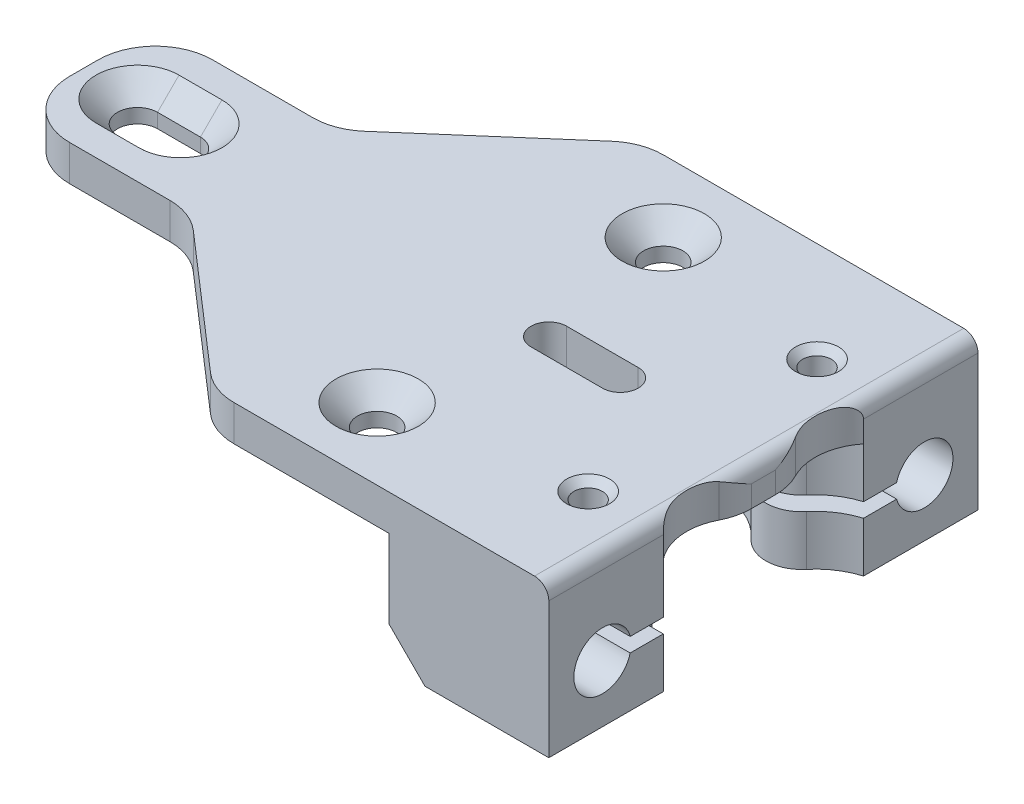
ISO-10303-21;
HEADER;
FILE_DESCRIPTION(('STEP AP214'),'2;1');
FILE_NAME('part.step','',(''),(''),'','','');
FILE_SCHEMA(('AUTOMOTIVE_DESIGN { 1 0 10303 214 1 1 1 1 }'));
ENDSEC;
DATA;
#1=APPLICATION_CONTEXT('core data for automotive mechanical design processes');
#2=APPLICATION_PROTOCOL_DEFINITION('international standard','automotive_design',2000,#1);
#3=PRODUCT_CONTEXT('',#1,'mechanical');
#4=PRODUCT('Part','Part','',(#3));
#5=PRODUCT_RELATED_PRODUCT_CATEGORY('part','',(#4));
#6=PRODUCT_DEFINITION_FORMATION('','',#4);
#7=PRODUCT_DEFINITION_CONTEXT('part definition',#1,'design');
#8=PRODUCT_DEFINITION('design','',#6,#7);
#9=PRODUCT_DEFINITION_SHAPE('','',#8);
#10=(LENGTH_UNIT() NAMED_UNIT(*) SI_UNIT(.MILLI.,.METRE.));
#11=(NAMED_UNIT(*) PLANE_ANGLE_UNIT() SI_UNIT($,.RADIAN.));
#12=(NAMED_UNIT(*) SI_UNIT($,.STERADIAN.) SOLID_ANGLE_UNIT());
#13=UNCERTAINTY_MEASURE_WITH_UNIT(LENGTH_MEASURE(1.E-05),#10,'distance_accuracy_value','');
#14=(GEOMETRIC_REPRESENTATION_CONTEXT(3) GLOBAL_UNCERTAINTY_ASSIGNED_CONTEXT((#13)) GLOBAL_UNIT_ASSIGNED_CONTEXT((#10,
#11,#12)) REPRESENTATION_CONTEXT('',''));
#15=CARTESIAN_POINT('',(0.,0.,0.));
#16=DIRECTION('',(0.,0.,1.));
#17=DIRECTION('',(1.,0.,0.));
#18=AXIS2_PLACEMENT_3D('',#15,#16,#17);
#19=CARTESIAN_POINT('',(0.,-13.,0.));
#20=DIRECTION('',(0.,-1.,0.));
#21=DIRECTION('',(0.,0.,-1.));
#22=AXIS2_PLACEMENT_3D('',#19,#20,#21);
#23=PLANE('',#22);
#24=CARTESIAN_POINT('',(86.5,-13.,-46.));
#25=DIRECTION('',(0.,-1.,0.));
#26=DIRECTION('',(0.,0.,-1.));
#27=AXIS2_PLACEMENT_3D('',#24,#25,#26);
#28=CIRCLE('',#27,1.99999999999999);
#29=CARTESIAN_POINT('',(86.5,-13.,-48.));
#30=VERTEX_POINT('',#29);
#31=EDGE_CURVE('E20',#30,#30,#28,.F.);
#32=ORIENTED_EDGE('',*,*,#31,.T.);
#33=EDGE_LOOP('',(#32));
#34=FACE_BOUND('',#33,.T.);
#35=DIRECTION('',(-1.,0.,0.));
#36=VECTOR('',#35,1.);
#37=CARTESIAN_POINT('',(84.3349364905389,-13.,-49.75));
#38=LINE('',#37,#36);
#39=CARTESIAN_POINT('',(84.3349364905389,-13.,-49.75));
#40=VERTEX_POINT('',#39);
#41=CARTESIAN_POINT('',(88.6650635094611,-13.,-49.75));
#42=VERTEX_POINT('',#41);
#43=EDGE_CURVE('E804',#40,#42,#38,.F.);
#44=ORIENTED_EDGE('',*,*,#43,.T.);
#45=DIRECTION('',(-0.499999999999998,0.,-0.86602540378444));
#46=VECTOR('',#45,1.);
#47=CARTESIAN_POINT('',(88.6650635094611,-13.,-49.75));
#48=LINE('',#47,#46);
#49=CARTESIAN_POINT('',(90.8301270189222,-13.,-46.));
#50=VERTEX_POINT('',#49);
#51=EDGE_CURVE('E798',#42,#50,#48,.F.);
#52=ORIENTED_EDGE('',*,*,#51,.T.);
#53=DIRECTION('',(0.499999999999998,0.,-0.86602540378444));
#54=VECTOR('',#53,1.);
#55=CARTESIAN_POINT('',(90.8301270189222,-13.,-46.));
#56=LINE('',#55,#54);
#57=CARTESIAN_POINT('',(88.6650635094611,-13.,-42.25));
#58=VERTEX_POINT('',#57);
#59=EDGE_CURVE('E795',#50,#58,#56,.F.);
#60=ORIENTED_EDGE('',*,*,#59,.T.);
#61=DIRECTION('',(1.,0.,0.));
#62=VECTOR('',#61,1.);
#63=CARTESIAN_POINT('',(88.6650635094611,-13.,-42.25));
#64=LINE('',#63,#62);
#65=CARTESIAN_POINT('',(84.3349364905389,-13.,-42.25));
#66=VERTEX_POINT('',#65);
#67=EDGE_CURVE('E823',#58,#66,#64,.F.);
#68=ORIENTED_EDGE('',*,*,#67,.T.);
#69=DIRECTION('',(0.500000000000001,0.,0.866025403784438));
#70=VECTOR('',#69,1.);
#71=CARTESIAN_POINT('',(84.3349364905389,-13.,-42.25));
#72=LINE('',#71,#70);
#73=CARTESIAN_POINT('',(82.1698729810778,-13.,-46.));
#74=VERTEX_POINT('',#73);
#75=EDGE_CURVE('E302',#66,#74,#72,.F.);
#76=ORIENTED_EDGE('',*,*,#75,.T.);
#77=DIRECTION('',(-0.500000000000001,0.,0.866025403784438));
#78=VECTOR('',#77,1.);
#79=CARTESIAN_POINT('',(82.1698729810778,-13.,-46.));
#80=LINE('',#79,#78);
#81=EDGE_CURVE('E810',#74,#40,#80,.F.);
#82=ORIENTED_EDGE('',*,*,#81,.T.);
#83=EDGE_LOOP('',(#44,#52,#60,#68,#76,#82));
#84=FACE_BOUND('',#83,.T.);
#85=ADVANCED_FACE('F17',(#34,#84),#23,.T.);
#86=CARTESIAN_POINT('',(86.5,5.,-46.));
#87=DIRECTION('',(0.,-1.,0.));
#88=DIRECTION('',(0.,0.,-1.));
#89=AXIS2_PLACEMENT_3D('',#86,#87,#88);
#90=CYLINDRICAL_SURFACE('',#89,1.99999999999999);
#91=CARTESIAN_POINT('',(86.5,-9.00000000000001,-46.));
#92=DIRECTION('',(0.,-1.,0.));
#93=DIRECTION('',(0.,0.,-1.));
#94=AXIS2_PLACEMENT_3D('',#91,#92,#93);
#95=CIRCLE('',#94,1.99999999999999);
#96=CARTESIAN_POINT('',(86.5,-9.00000000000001,-48.));
#97=VERTEX_POINT('',#96);
#98=EDGE_CURVE('E847',#97,#97,#95,.F.);
#99=ORIENTED_EDGE('',*,*,#98,.T.);
#100=EDGE_LOOP('',(#99));
#101=FACE_BOUND('',#100,.T.);
#102=ORIENTED_EDGE('',*,*,#31,.F.);
#103=EDGE_LOOP('',(#102));
#104=FACE_BOUND('',#103,.T.);
#105=ADVANCED_FACE('F702',(#101,#104),#90,.F.);
#106=CARTESIAN_POINT('',(0.,-13.,0.));
#107=DIRECTION('',(0.,-1.,0.));
#108=DIRECTION('',(0.,0.,-1.));
#109=AXIS2_PLACEMENT_3D('',#106,#107,#108);
#110=PLANE('',#109);
#111=CARTESIAN_POINT('',(86.5,-13.,-14.));
#112=DIRECTION('',(0.,-1.,0.));
#113=DIRECTION('',(0.,0.,-1.));
#114=AXIS2_PLACEMENT_3D('',#111,#112,#113);
#115=CIRCLE('',#114,1.99999999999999);
#116=CARTESIAN_POINT('',(86.5,-13.,-16.));
#117=VERTEX_POINT('',#116);
#118=EDGE_CURVE('E796',#117,#117,#115,.F.);
#119=ORIENTED_EDGE('',*,*,#118,.T.);
#120=EDGE_LOOP('',(#119));
#121=FACE_BOUND('',#120,.T.);
#122=DIRECTION('',(-1.,0.,0.));
#123=VECTOR('',#122,1.);
#124=CARTESIAN_POINT('',(84.3349364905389,-13.,-17.75));
#125=LINE('',#124,#123);
#126=CARTESIAN_POINT('',(84.3349364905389,-13.,-17.75));
#127=VERTEX_POINT('',#126);
#128=CARTESIAN_POINT('',(88.6650635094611,-13.,-17.75));
#129=VERTEX_POINT('',#128);
#130=EDGE_CURVE('E866',#127,#129,#125,.F.);
#131=ORIENTED_EDGE('',*,*,#130,.T.);
#132=DIRECTION('',(-0.5,0.,-0.866025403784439));
#133=VECTOR('',#132,1.);
#134=CARTESIAN_POINT('',(88.6650635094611,-13.,-17.75));
#135=LINE('',#134,#133);
#136=CARTESIAN_POINT('',(90.8301270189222,-13.,-14.));
#137=VERTEX_POINT('',#136);
#138=EDGE_CURVE('E860',#129,#137,#135,.F.);
#139=ORIENTED_EDGE('',*,*,#138,.T.);
#140=DIRECTION('',(0.5,0.,-0.866025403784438));
#141=VECTOR('',#140,1.);
#142=CARTESIAN_POINT('',(90.8301270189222,-13.,-14.));
#143=LINE('',#142,#141);
#144=CARTESIAN_POINT('',(88.6650635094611,-13.,-10.25));
#145=VERTEX_POINT('',#144);
#146=EDGE_CURVE('E857',#137,#145,#143,.F.);
#147=ORIENTED_EDGE('',*,*,#146,.T.);
#148=DIRECTION('',(1.,0.,0.));
#149=VECTOR('',#148,1.);
#150=CARTESIAN_POINT('',(88.6650635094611,-13.,-10.25));
#151=LINE('',#150,#149);
#152=CARTESIAN_POINT('',(84.3349364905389,-13.,-10.25));
#153=VERTEX_POINT('',#152);
#154=EDGE_CURVE('E887',#145,#153,#151,.F.);
#155=ORIENTED_EDGE('',*,*,#154,.T.);
#156=DIRECTION('',(0.499999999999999,0.,0.866025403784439));
#157=VECTOR('',#156,1.);
#158=CARTESIAN_POINT('',(84.3349364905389,-13.,-10.25));
#159=LINE('',#158,#157);
#160=CARTESIAN_POINT('',(82.1698729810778,-13.,-14.));
#161=VERTEX_POINT('',#160);
#162=EDGE_CURVE('E878',#153,#161,#159,.F.);
#163=ORIENTED_EDGE('',*,*,#162,.T.);
#164=DIRECTION('',(-0.500000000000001,0.,0.866025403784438));
#165=VECTOR('',#164,1.);
#166=CARTESIAN_POINT('',(82.1698729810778,-13.,-14.));
#167=LINE('',#166,#165);
#168=EDGE_CURVE('E872',#161,#127,#167,.F.);
#169=ORIENTED_EDGE('',*,*,#168,.T.);
#170=EDGE_LOOP('',(#131,#139,#147,#155,#163,#169));
#171=FACE_BOUND('',#170,.T.);
#172=ADVANCED_FACE('F699',(#121,#171),#110,.T.);
#173=CARTESIAN_POINT('',(86.5,5.,-14.));
#174=DIRECTION('',(0.,-1.,0.));
#175=DIRECTION('',(0.,0.,-1.));
#176=AXIS2_PLACEMENT_3D('',#173,#174,#175);
#177=CYLINDRICAL_SURFACE('',#176,1.99999999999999);
#178=CARTESIAN_POINT('',(86.5,-9.00000000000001,-14.));
#179=DIRECTION('',(0.,-1.,0.));
#180=DIRECTION('',(0.,0.,-1.));
#181=AXIS2_PLACEMENT_3D('',#178,#179,#180);
#182=CIRCLE('',#181,1.99999999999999);
#183=CARTESIAN_POINT('',(86.5,-9.00000000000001,-16.));
#184=VERTEX_POINT('',#183);
#185=EDGE_CURVE('E783',#184,#184,#182,.F.);
#186=ORIENTED_EDGE('',*,*,#185,.T.);
#187=EDGE_LOOP('',(#186));
#188=FACE_BOUND('',#187,.T.);
#189=ORIENTED_EDGE('',*,*,#118,.F.);
#190=EDGE_LOOP('',(#189));
#191=FACE_BOUND('',#190,.T.);
#192=ADVANCED_FACE('F695',(#188,#191),#177,.F.);
#193=CARTESIAN_POINT('',(95.,34.6816441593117,-44.));
#194=DIRECTION('',(0.,0.,1.));
#195=DIRECTION('',(1.,0.,0.));
#196=AXIS2_PLACEMENT_3D('',#193,#194,#195);
#197=PLANE('',#196);
#198=DIRECTION('',(1.,0.,0.));
#199=VECTOR('',#198,1.);
#200=CARTESIAN_POINT('',(0.,-9.00000000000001,-44.));
#201=LINE('',#200,#199);
#202=CARTESIAN_POINT('',(75.1625380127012,-9.00000000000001,-44.));
#203=VERTEX_POINT('',#202);
#204=CARTESIAN_POINT('',(72.6857558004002,-9.00000000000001,-44.));
#205=VERTEX_POINT('',#204);
#206=EDGE_CURVE('E776',#203,#205,#201,.F.);
#207=ORIENTED_EDGE('',*,*,#206,.T.);
#208=DIRECTION('',(0.,1.,0.));
#209=VECTOR('',#208,1.);
#210=CARTESIAN_POINT('',(72.6857558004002,-16.,-44.));
#211=LINE('',#210,#209);
#212=CARTESIAN_POINT('',(72.6857558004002,-11.,-44.));
#213=VERTEX_POINT('',#212);
#214=EDGE_CURVE('E792',#205,#213,#211,.F.);
#215=ORIENTED_EDGE('',*,*,#214,.T.);
#216=DIRECTION('',(0.707106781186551,-0.707106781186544,0.));
#217=VECTOR('',#216,1.);
#218=CARTESIAN_POINT('',(77.6857558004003,-16.,-44.));
#219=LINE('',#218,#217);
#220=CARTESIAN_POINT('',(75.1625380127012,-13.4767822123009,-44.));
#221=VERTEX_POINT('',#220);
#222=EDGE_CURVE('E1087',#221,#213,#219,.F.);
#223=ORIENTED_EDGE('',*,*,#222,.F.);
#224=DIRECTION('',(0.,-1.,0.));
#225=VECTOR('',#224,1.);
#226=CARTESIAN_POINT('',(75.1625380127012,11.180339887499,-44.));
#227=LINE('',#226,#225);
#228=EDGE_CURVE('E834',#221,#203,#227,.F.);
#229=ORIENTED_EDGE('',*,*,#228,.T.);
#230=EDGE_LOOP('',(#207,#215,#223,#229));
#231=FACE_BOUND('',#230,.T.);
#232=ADVANCED_FACE('F691',(#231),#197,.T.);
#233=CARTESIAN_POINT('',(72.6857558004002,-16.,-60.));
#234=DIRECTION('',(1.,0.,0.));
#235=DIRECTION('',(0.,0.,-1.));
#236=AXIS2_PLACEMENT_3D('',#233,#234,#235);
#237=PLANE('',#236);
#238=DIRECTION('',(0.,0.,-1.));
#239=VECTOR('',#238,1.);
#240=CARTESIAN_POINT('',(72.6857558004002,-9.00000000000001,-54.738734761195));
#241=LINE('',#240,#239);
#242=CARTESIAN_POINT('',(72.6857558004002,-9.00000000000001,-48.627016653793));
#243=VERTEX_POINT('',#242);
#244=EDGE_CURVE('E772',#205,#243,#241,.T.);
#245=ORIENTED_EDGE('',*,*,#244,.T.);
#246=CARTESIAN_POINT('',(72.6857558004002,-8.00000000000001,-52.5000000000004));
#247=DIRECTION('',(1.,0.,0.));
#248=DIRECTION('',(0.,0.,-1.));
#249=AXIS2_PLACEMENT_3D('',#246,#247,#248);
#250=CIRCLE('',#249,4.);
#251=CARTESIAN_POINT('',(72.6857558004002,-11.,-49.8542486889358));
#252=VERTEX_POINT('',#251);
#253=EDGE_CURVE('E293',#243,#252,#250,.T.);
#254=ORIENTED_EDGE('',*,*,#253,.T.);
#255=DIRECTION('',(0.,0.,1.));
#256=VECTOR('',#255,1.);
#257=CARTESIAN_POINT('',(72.6857558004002,-11.,0.));
#258=LINE('',#257,#256);
#259=EDGE_CURVE('E1089',#213,#252,#258,.F.);
#260=ORIENTED_EDGE('',*,*,#259,.F.);
#261=ORIENTED_EDGE('',*,*,#214,.F.);
#262=EDGE_LOOP('',(#245,#254,#260,#261));
#263=FACE_BOUND('',#262,.T.);
#264=ADVANCED_FACE('F687',(#263),#237,.F.);
#265=CARTESIAN_POINT('',(90.8301270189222,-13.,-46.));
#266=DIRECTION('',(0.86602540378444,0.,0.499999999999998));
#267=DIRECTION('',(0.499999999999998,0.,-0.86602540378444));
#268=AXIS2_PLACEMENT_3D('',#265,#266,#267);
#269=PLANE('',#268);
#270=DIRECTION('',(0.,1.,0.));
#271=VECTOR('',#270,1.);
#272=CARTESIAN_POINT('',(88.6650635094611,-13.,-42.25));
#273=LINE('',#272,#271);
#274=CARTESIAN_POINT('',(88.6650635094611,-16.,-42.25));
#275=VERTEX_POINT('',#274);
#276=EDGE_CURVE('E820',#275,#58,#273,.T.);
#277=ORIENTED_EDGE('',*,*,#276,.T.);
#278=ORIENTED_EDGE('',*,*,#59,.F.);
#279=DIRECTION('',(0.,1.,0.));
#280=VECTOR('',#279,1.);
#281=CARTESIAN_POINT('',(90.8301270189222,-13.,-46.));
#282=LINE('',#281,#280);
#283=CARTESIAN_POINT('',(90.8301270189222,-16.,-46.));
#284=VERTEX_POINT('',#283);
#285=EDGE_CURVE('E801',#50,#284,#282,.F.);
#286=ORIENTED_EDGE('',*,*,#285,.T.);
#287=DIRECTION('',(0.499999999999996,0.,-0.866025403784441));
#288=VECTOR('',#287,1.);
#289=CARTESIAN_POINT('',(88.6650635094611,-16.,-42.25));
#290=LINE('',#289,#288);
#291=EDGE_CURVE('E1094',#275,#284,#290,.T.);
#292=ORIENTED_EDGE('',*,*,#291,.F.);
#293=EDGE_LOOP('',(#277,#278,#286,#292));
#294=FACE_BOUND('',#293,.T.);
#295=ADVANCED_FACE('F683',(#294),#269,.F.);
#296=CARTESIAN_POINT('',(88.6650635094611,-13.,-49.75));
#297=DIRECTION('',(0.86602540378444,0.,-0.499999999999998));
#298=DIRECTION('',(-0.499999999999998,0.,-0.86602540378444));
#299=AXIS2_PLACEMENT_3D('',#296,#297,#298);
#300=PLANE('',#299);
#301=ORIENTED_EDGE('',*,*,#285,.F.);
#302=ORIENTED_EDGE('',*,*,#51,.F.);
#303=DIRECTION('',(0.,1.,0.));
#304=VECTOR('',#303,1.);
#305=CARTESIAN_POINT('',(88.6650635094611,-13.,-49.75));
#306=LINE('',#305,#304);
#307=CARTESIAN_POINT('',(88.6650635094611,-16.,-49.75));
#308=VERTEX_POINT('',#307);
#309=EDGE_CURVE('E807',#42,#308,#306,.F.);
#310=ORIENTED_EDGE('',*,*,#309,.T.);
#311=DIRECTION('',(-0.499999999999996,0.,-0.866025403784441));
#312=VECTOR('',#311,1.);
#313=CARTESIAN_POINT('',(90.8301270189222,-16.,-46.));
#314=LINE('',#313,#312);
#315=EDGE_CURVE('E1102',#284,#308,#314,.T.);
#316=ORIENTED_EDGE('',*,*,#315,.F.);
#317=EDGE_LOOP('',(#301,#302,#310,#316));
#318=FACE_BOUND('',#317,.T.);
#319=ADVANCED_FACE('F679',(#318),#300,.F.);
#320=CARTESIAN_POINT('',(84.3349364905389,-13.,-49.75));
#321=DIRECTION('',(0.,0.,-1.));
#322=DIRECTION('',(-1.,0.,0.));
#323=AXIS2_PLACEMENT_3D('',#320,#321,#322);
#324=PLANE('',#323);
#325=ORIENTED_EDGE('',*,*,#309,.F.);
#326=ORIENTED_EDGE('',*,*,#43,.F.);
#327=DIRECTION('',(0.,1.,0.));
#328=VECTOR('',#327,1.);
#329=CARTESIAN_POINT('',(84.3349364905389,-13.,-49.75));
#330=LINE('',#329,#328);
#331=CARTESIAN_POINT('',(84.3349364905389,-16.,-49.75));
#332=VERTEX_POINT('',#331);
#333=EDGE_CURVE('E813',#40,#332,#330,.F.);
#334=ORIENTED_EDGE('',*,*,#333,.T.);
#335=DIRECTION('',(1.,0.,0.));
#336=VECTOR('',#335,1.);
#337=CARTESIAN_POINT('',(0.,-16.,-49.75));
#338=LINE('',#337,#336);
#339=EDGE_CURVE('E1105',#308,#332,#338,.F.);
#340=ORIENTED_EDGE('',*,*,#339,.F.);
#341=EDGE_LOOP('',(#325,#326,#334,#340));
#342=FACE_BOUND('',#341,.T.);
#343=ADVANCED_FACE('F675',(#342),#324,.F.);
#344=CARTESIAN_POINT('',(82.1698729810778,-13.,-46.));
#345=DIRECTION('',(-0.866025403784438,0.,-0.500000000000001));
#346=DIRECTION('',(-0.500000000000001,0.,0.866025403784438));
#347=AXIS2_PLACEMENT_3D('',#344,#345,#346);
#348=PLANE('',#347);
#349=ORIENTED_EDGE('',*,*,#333,.F.);
#350=ORIENTED_EDGE('',*,*,#81,.F.);
#351=DIRECTION('',(0.,1.,0.));
#352=VECTOR('',#351,1.);
#353=CARTESIAN_POINT('',(82.1698729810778,-13.,-46.));
#354=LINE('',#353,#352);
#355=CARTESIAN_POINT('',(82.1698729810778,-16.,-46.));
#356=VERTEX_POINT('',#355);
#357=EDGE_CURVE('E817',#74,#356,#354,.F.);
#358=ORIENTED_EDGE('',*,*,#357,.T.);
#359=DIRECTION('',(-0.5,0.,0.866025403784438));
#360=VECTOR('',#359,1.);
#361=CARTESIAN_POINT('',(84.3349364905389,-16.,-49.75));
#362=LINE('',#361,#360);
#363=EDGE_CURVE('E1108',#332,#356,#362,.T.);
#364=ORIENTED_EDGE('',*,*,#363,.F.);
#365=EDGE_LOOP('',(#349,#350,#358,#364));
#366=FACE_BOUND('',#365,.T.);
#367=ADVANCED_FACE('F672',(#366),#348,.F.);
#368=CARTESIAN_POINT('',(84.3349364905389,-13.,-42.25));
#369=DIRECTION('',(-0.866025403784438,0.,0.500000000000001));
#370=DIRECTION('',(0.500000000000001,0.,0.866025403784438));
#371=AXIS2_PLACEMENT_3D('',#368,#369,#370);
#372=PLANE('',#371);
#373=ORIENTED_EDGE('',*,*,#357,.F.);
#374=ORIENTED_EDGE('',*,*,#75,.F.);
#375=DIRECTION('',(0.,1.,0.));
#376=VECTOR('',#375,1.);
#377=CARTESIAN_POINT('',(84.3349364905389,-13.,-42.25));
#378=LINE('',#377,#376);
#379=CARTESIAN_POINT('',(84.3349364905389,-16.,-42.25));
#380=VERTEX_POINT('',#379);
#381=EDGE_CURVE('E826',#66,#380,#378,.F.);
#382=ORIENTED_EDGE('',*,*,#381,.T.);
#383=DIRECTION('',(0.500000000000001,0.,0.866025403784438));
#384=VECTOR('',#383,1.);
#385=CARTESIAN_POINT('',(82.1698729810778,-16.,-46.));
#386=LINE('',#385,#384);
#387=EDGE_CURVE('E1111',#356,#380,#386,.T.);
#388=ORIENTED_EDGE('',*,*,#387,.F.);
#389=EDGE_LOOP('',(#373,#374,#382,#388));
#390=FACE_BOUND('',#389,.T.);
#391=ADVANCED_FACE('F668',(#390),#372,.F.);
#392=CARTESIAN_POINT('',(88.6650635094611,-13.,-42.25));
#393=DIRECTION('',(0.,0.,1.));
#394=DIRECTION('',(1.,0.,0.));
#395=AXIS2_PLACEMENT_3D('',#392,#393,#394);
#396=PLANE('',#395);
#397=ORIENTED_EDGE('',*,*,#381,.F.);
#398=ORIENTED_EDGE('',*,*,#67,.F.);
#399=ORIENTED_EDGE('',*,*,#276,.F.);
#400=DIRECTION('',(1.,0.,0.));
#401=VECTOR('',#400,1.);
#402=CARTESIAN_POINT('',(0.,-16.,-42.25));
#403=LINE('',#402,#401);
#404=EDGE_CURVE('E1114',#380,#275,#403,.T.);
#405=ORIENTED_EDGE('',*,*,#404,.F.);
#406=EDGE_LOOP('',(#397,#398,#399,#405));
#407=FACE_BOUND('',#406,.T.);
#408=ADVANCED_FACE('F664',(#407),#396,.F.);
#409=CARTESIAN_POINT('',(86.3428779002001,11.180339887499,-44.));
#410=DIRECTION('',(0.,-1.,0.));
#411=DIRECTION('',(0.,0.,-1.));
#412=AXIS2_PLACEMENT_3D('',#409,#410,#411);
#413=CYLINDRICAL_SURFACE('',#412,5.);
#414=CARTESIAN_POINT('',(86.3428779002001,-9.00000000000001,-44.));
#415=DIRECTION('',(0.,-1.,0.));
#416=DIRECTION('',(0.,0.,-1.));
#417=AXIS2_PLACEMENT_3D('',#414,#415,#416);
#418=CIRCLE('',#417,5.);
#419=CARTESIAN_POINT('',(90.1922280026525,-9.00000000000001,-40.808996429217));
#420=VERTEX_POINT('',#419);
#421=CARTESIAN_POINT('',(82.6160979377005,-9.00000000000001,-40.6666666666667));
#422=VERTEX_POINT('',#421);
#423=EDGE_CURVE('E846',#420,#422,#418,.T.);
#424=ORIENTED_EDGE('',*,*,#423,.T.);
#425=DIRECTION('',(0.,-1.,0.));
#426=VECTOR('',#425,1.);
#427=CARTESIAN_POINT('',(82.6160979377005,11.180339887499,-40.6666666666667));
#428=LINE('',#427,#426);
#429=CARTESIAN_POINT('',(82.6160979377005,-16.,-40.6666666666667));
#430=VERTEX_POINT('',#429);
#431=EDGE_CURVE('E828',#422,#430,#428,.T.);
#432=ORIENTED_EDGE('',*,*,#431,.T.);
#433=CARTESIAN_POINT('',(86.3428779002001,-16.,-44.));
#434=DIRECTION('',(0.,-1.,0.));
#435=DIRECTION('',(0.,0.,-1.));
#436=AXIS2_PLACEMENT_3D('',#433,#434,#435);
#437=CIRCLE('',#436,5.);
#438=CARTESIAN_POINT('',(90.1922280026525,-16.,-40.808996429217));
#439=VERTEX_POINT('',#438);
#440=EDGE_CURVE('E1441',#439,#430,#437,.T.);
#441=ORIENTED_EDGE('',*,*,#440,.F.);
#442=DIRECTION('',(0.,1.,0.));
#443=VECTOR('',#442,1.);
#444=CARTESIAN_POINT('',(90.1922280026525,11.180339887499,-40.808996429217));
#445=LINE('',#444,#443);
#446=EDGE_CURVE('E775',#439,#420,#445,.T.);
#447=ORIENTED_EDGE('',*,*,#446,.T.);
#448=EDGE_LOOP('',(#424,#432,#441,#447));
#449=FACE_BOUND('',#448,.T.);
#450=ADVANCED_FACE('F660',(#449),#413,.T.);
#451=CARTESIAN_POINT('',(75.1625380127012,11.180339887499,-34.));
#452=DIRECTION('',(0.,-1.,0.));
#453=DIRECTION('',(0.,0.,-1.));
#454=AXIS2_PLACEMENT_3D('',#451,#452,#453);
#455=CYLINDRICAL_SURFACE('',#454,10.);
#456=ORIENTED_EDGE('',*,*,#228,.F.);
#457=CARTESIAN_POINT('',(75.1625380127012,-13.4767822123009,-34.));
#458=DIRECTION('',(-0.707106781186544,-0.707106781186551,0.));
#459=DIRECTION('',(0.707106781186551,-0.707106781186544,0.));
#460=AXIS2_PLACEMENT_3D('',#457,#458,#459);
#461=ELLIPSE('',#460,14.1421356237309,10.);
#462=CARTESIAN_POINT('',(77.6857558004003,-16.,-43.6764338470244));
#463=VERTEX_POINT('',#462);
#464=EDGE_CURVE('E1083',#463,#221,#461,.F.);
#465=ORIENTED_EDGE('',*,*,#464,.F.);
#466=CARTESIAN_POINT('',(75.1625380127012,-16.,-34.));
#467=DIRECTION('',(0.,-1.,0.));
#468=DIRECTION('',(0.,0.,-1.));
#469=AXIS2_PLACEMENT_3D('',#466,#467,#468);
#470=CIRCLE('',#469,10.);
#471=EDGE_CURVE('E1124',#430,#463,#470,.F.);
#472=ORIENTED_EDGE('',*,*,#471,.F.);
#473=ORIENTED_EDGE('',*,*,#431,.F.);
#474=CARTESIAN_POINT('',(75.1625380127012,-9.00000000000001,-34.));
#475=DIRECTION('',(0.,-1.,0.));
#476=DIRECTION('',(0.,0.,-1.));
#477=AXIS2_PLACEMENT_3D('',#474,#475,#476);
#478=CIRCLE('',#477,10.);
#479=EDGE_CURVE('E852',#422,#203,#478,.F.);
#480=ORIENTED_EDGE('',*,*,#479,.T.);
#481=EDGE_LOOP('',(#456,#465,#472,#473,#480));
#482=FACE_BOUND('',#481,.T.);
#483=ADVANCED_FACE('F656',(#482),#455,.F.);
#484=CARTESIAN_POINT('',(0.,-7.,-54.738734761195));
#485=DIRECTION('',(0.,1.,0.));
#486=DIRECTION('',(0.,0.,1.));
#487=AXIS2_PLACEMENT_3D('',#484,#485,#486);
#488=PLANE('',#487);
#489=CARTESIAN_POINT('',(97.8909282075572,-7.,-34.4269892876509));
#490=DIRECTION('',(0.,1.,0.));
#491=DIRECTION('',(0.,0.,1.));
#492=AXIS2_PLACEMENT_3D('',#489,#490,#491);
#493=CIRCLE('',#492,10.);
#494=CARTESIAN_POINT('',(95.,-7.00000000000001,-44.));
#495=VERTEX_POINT('',#494);
#496=CARTESIAN_POINT('',(90.1922280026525,-7.,-40.808996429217));
#497=VERTEX_POINT('',#496);
#498=EDGE_CURVE('E911',#495,#497,#493,.T.);
#499=ORIENTED_EDGE('',*,*,#498,.T.);
#500=CARTESIAN_POINT('',(86.3428779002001,-7.,-44.));
#501=DIRECTION('',(0.,-1.,0.));
#502=DIRECTION('',(0.,0.,-1.));
#503=AXIS2_PLACEMENT_3D('',#500,#501,#502);
#504=CIRCLE('',#503,5.);
#505=CARTESIAN_POINT('',(82.6160979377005,-7.,-40.6666666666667));
#506=VERTEX_POINT('',#505);
#507=EDGE_CURVE('E897',#506,#497,#504,.F.);
#508=ORIENTED_EDGE('',*,*,#507,.F.);
#509=CARTESIAN_POINT('',(75.1625380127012,-7.,-34.));
#510=DIRECTION('',(0.,-1.,0.));
#511=DIRECTION('',(0.,0.,-1.));
#512=AXIS2_PLACEMENT_3D('',#509,#510,#511);
#513=CIRCLE('',#512,10.);
#514=CARTESIAN_POINT('',(75.1625380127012,-7.,-44.));
#515=VERTEX_POINT('',#514);
#516=EDGE_CURVE('E936',#506,#515,#513,.F.);
#517=ORIENTED_EDGE('',*,*,#516,.T.);
#518=DIRECTION('',(1.,0.,0.));
#519=VECTOR('',#518,1.);
#520=CARTESIAN_POINT('',(95.,-7.00000000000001,-44.));
#521=LINE('',#520,#519);
#522=CARTESIAN_POINT('',(72.6857558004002,-7.00000000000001,-44.));
#523=VERTEX_POINT('',#522);
#524=EDGE_CURVE('E786',#523,#515,#521,.T.);
#525=ORIENTED_EDGE('',*,*,#524,.F.);
#526=DIRECTION('',(0.,0.,-1.));
#527=VECTOR('',#526,1.);
#528=CARTESIAN_POINT('',(72.6857558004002,-7.00000000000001,-60.));
#529=LINE('',#528,#527);
#530=CARTESIAN_POINT('',(72.6857558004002,-7.,-48.627016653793));
#531=VERTEX_POINT('',#530);
#532=EDGE_CURVE('E932',#523,#531,#529,.T.);
#533=ORIENTED_EDGE('',*,*,#532,.T.);
#534=DIRECTION('',(1.,0.,0.));
#535=VECTOR('',#534,1.);
#536=CARTESIAN_POINT('',(69.,-7.,-48.627016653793));
#537=LINE('',#536,#535);
#538=CARTESIAN_POINT('',(95.,-7.,-48.627016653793));
#539=VERTEX_POINT('',#538);
#540=EDGE_CURVE('E836',#531,#539,#537,.T.);
#541=ORIENTED_EDGE('',*,*,#540,.T.);
#542=DIRECTION('',(0.,0.,-1.));
#543=VECTOR('',#542,1.);
#544=CARTESIAN_POINT('',(95.,-7.00000000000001,-60.));
#545=LINE('',#544,#543);
#546=EDGE_CURVE('E840',#495,#539,#545,.T.);
#547=ORIENTED_EDGE('',*,*,#546,.F.);
#548=EDGE_LOOP('',(#499,#508,#517,#525,#533,#541,#547));
#549=FACE_BOUND('',#548,.T.);
#550=CARTESIAN_POINT('',(86.5,-7.,-46.));
#551=DIRECTION('',(0.,-1.,0.));
#552=DIRECTION('',(0.,0.,-1.));
#553=AXIS2_PLACEMENT_3D('',#550,#551,#552);
#554=CIRCLE('',#553,1.99999999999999);
#555=CARTESIAN_POINT('',(86.5,-7.,-48.));
#556=VERTEX_POINT('',#555);
#557=EDGE_CURVE('E1450',#556,#556,#554,.F.);
#558=ORIENTED_EDGE('',*,*,#557,.T.);
#559=EDGE_LOOP('',(#558));
#560=FACE_BOUND('',#559,.T.);
#561=ADVANCED_FACE('F653',(#549,#560),#488,.F.);
#562=CARTESIAN_POINT('',(69.,-8.00000000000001,-52.5000000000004));
#563=DIRECTION('',(1.,0.,0.));
#564=DIRECTION('',(0.,0.,-1.));
#565=AXIS2_PLACEMENT_3D('',#562,#563,#564);
#566=CYLINDRICAL_SURFACE('',#565,4.);
#567=CARTESIAN_POINT('',(72.6857558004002,-8.00000000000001,-52.5000000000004));
#568=DIRECTION('',(1.,0.,0.));
#569=DIRECTION('',(0.,0.,-1.));
#570=AXIS2_PLACEMENT_3D('',#567,#568,#569);
#571=CIRCLE('',#570,4.);
#572=CARTESIAN_POINT('',(72.6857558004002,-11.,-55.145751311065));
#573=VERTEX_POINT('',#572);
#574=EDGE_CURVE('E1073',#531,#573,#571,.F.);
#575=ORIENTED_EDGE('',*,*,#574,.T.);
#576=CARTESIAN_POINT('',(69.6857558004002,-8.00000000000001,-52.5000000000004));
#577=DIRECTION('',(-0.707106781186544,-0.707106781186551,0.));
#578=DIRECTION('',(0.707106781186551,-0.707106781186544,0.));
#579=AXIS2_PLACEMENT_3D('',#576,#577,#578);
#580=ELLIPSE('',#579,5.6568542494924,4.);
#581=EDGE_CURVE('E1084',#252,#573,#580,.F.);
#582=ORIENTED_EDGE('',*,*,#581,.F.);
#583=ORIENTED_EDGE('',*,*,#253,.F.);
#584=DIRECTION('',(1.,0.,0.));
#585=VECTOR('',#584,1.);
#586=CARTESIAN_POINT('',(0.,-9.00000000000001,-48.627016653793));
#587=LINE('',#586,#585);
#588=CARTESIAN_POINT('',(95.,-9.00000000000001,-48.627016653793));
#589=VERTEX_POINT('',#588);
#590=EDGE_CURVE('E844',#243,#589,#587,.T.);
#591=ORIENTED_EDGE('',*,*,#590,.T.);
#592=CARTESIAN_POINT('',(95.,-8.00000000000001,-52.5000000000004));
#593=DIRECTION('',(1.,0.,0.));
#594=DIRECTION('',(0.,0.,-1.));
#595=AXIS2_PLACEMENT_3D('',#592,#593,#594);
#596=CIRCLE('',#595,4.);
#597=EDGE_CURVE('E1149',#539,#589,#596,.F.);
#598=ORIENTED_EDGE('',*,*,#597,.F.);
#599=ORIENTED_EDGE('',*,*,#540,.F.);
#600=EDGE_LOOP('',(#575,#582,#583,#591,#598,#599));
#601=FACE_BOUND('',#600,.T.);
#602=ADVANCED_FACE('F649',(#601),#566,.F.);
#603=CARTESIAN_POINT('',(0.,-9.00000000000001,-54.738734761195));
#604=DIRECTION('',(0.,-1.,0.));
#605=DIRECTION('',(0.,0.,-1.));
#606=AXIS2_PLACEMENT_3D('',#603,#604,#605);
#607=PLANE('',#606);
#608=ORIENTED_EDGE('',*,*,#206,.F.);
#609=ORIENTED_EDGE('',*,*,#479,.F.);
#610=ORIENTED_EDGE('',*,*,#423,.F.);
#611=CARTESIAN_POINT('',(97.8909282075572,-9.00000000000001,-34.4269892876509));
#612=DIRECTION('',(0.,1.,0.));
#613=DIRECTION('',(0.,0.,1.));
#614=AXIS2_PLACEMENT_3D('',#611,#612,#613);
#615=CIRCLE('',#614,10.);
#616=CARTESIAN_POINT('',(95.,-9.00000000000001,-44.));
#617=VERTEX_POINT('',#616);
#618=EDGE_CURVE('E831',#420,#617,#615,.F.);
#619=ORIENTED_EDGE('',*,*,#618,.T.);
#620=DIRECTION('',(0.,0.,-1.));
#621=VECTOR('',#620,1.);
#622=CARTESIAN_POINT('',(95.,-9.00000000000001,-60.));
#623=LINE('',#622,#621);
#624=EDGE_CURVE('E856',#589,#617,#623,.F.);
#625=ORIENTED_EDGE('',*,*,#624,.F.);
#626=ORIENTED_EDGE('',*,*,#590,.F.);
#627=ORIENTED_EDGE('',*,*,#244,.F.);
#628=EDGE_LOOP('',(#608,#609,#610,#619,#625,#626,#627));
#629=FACE_BOUND('',#628,.T.);
#630=ORIENTED_EDGE('',*,*,#98,.F.);
#631=EDGE_LOOP('',(#630));
#632=FACE_BOUND('',#631,.T.);
#633=ADVANCED_FACE('F645',(#629,#632),#607,.F.);
#634=CARTESIAN_POINT('',(97.8909282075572,11.180339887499,-34.4269892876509));
#635=DIRECTION('',(0.,1.,0.));
#636=DIRECTION('',(0.,0.,1.));
#637=AXIS2_PLACEMENT_3D('',#634,#635,#636);
#638=CYLINDRICAL_SURFACE('',#637,10.);
#639=ORIENTED_EDGE('',*,*,#446,.F.);
#640=CARTESIAN_POINT('',(97.8909282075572,-16.,-34.4269892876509));
#641=DIRECTION('',(0.,1.,0.));
#642=DIRECTION('',(0.,0.,1.));
#643=AXIS2_PLACEMENT_3D('',#640,#641,#642);
#644=CIRCLE('',#643,10.);
#645=CARTESIAN_POINT('',(95.,-16.,-44.));
#646=VERTEX_POINT('',#645);
#647=EDGE_CURVE('E1117',#646,#439,#644,.T.);
#648=ORIENTED_EDGE('',*,*,#647,.F.);
#649=DIRECTION('',(0.,1.,0.));
#650=VECTOR('',#649,1.);
#651=CARTESIAN_POINT('',(95.,34.6816441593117,-44.));
#652=LINE('',#651,#650);
#653=EDGE_CURVE('E853',#617,#646,#652,.F.);
#654=ORIENTED_EDGE('',*,*,#653,.F.);
#655=ORIENTED_EDGE('',*,*,#618,.F.);
#656=EDGE_LOOP('',(#639,#648,#654,#655));
#657=FACE_BOUND('',#656,.T.);
#658=ADVANCED_FACE('F641',(#657),#638,.F.);
#659=CARTESIAN_POINT('',(90.8301270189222,-13.,-14.));
#660=DIRECTION('',(0.866025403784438,0.,0.5));
#661=DIRECTION('',(0.5,0.,-0.866025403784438));
#662=AXIS2_PLACEMENT_3D('',#659,#660,#661);
#663=PLANE('',#662);
#664=DIRECTION('',(0.,1.,0.));
#665=VECTOR('',#664,1.);
#666=CARTESIAN_POINT('',(88.6650635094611,-13.,-10.25));
#667=LINE('',#666,#665);
#668=CARTESIAN_POINT('',(88.6650635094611,-16.,-10.25));
#669=VERTEX_POINT('',#668);
#670=EDGE_CURVE('E884',#669,#145,#667,.T.);
#671=ORIENTED_EDGE('',*,*,#670,.T.);
#672=ORIENTED_EDGE('',*,*,#146,.F.);
#673=DIRECTION('',(0.,1.,0.));
#674=VECTOR('',#673,1.);
#675=CARTESIAN_POINT('',(90.8301270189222,-13.,-14.));
#676=LINE('',#675,#674);
#677=CARTESIAN_POINT('',(90.8301270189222,-16.,-14.));
#678=VERTEX_POINT('',#677);
#679=EDGE_CURVE('E863',#137,#678,#676,.F.);
#680=ORIENTED_EDGE('',*,*,#679,.T.);
#681=DIRECTION('',(0.5,0.,-0.866025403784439));
#682=VECTOR('',#681,1.);
#683=CARTESIAN_POINT('',(88.6650635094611,-16.,-10.25));
#684=LINE('',#683,#682);
#685=EDGE_CURVE('E1134',#669,#678,#684,.T.);
#686=ORIENTED_EDGE('',*,*,#685,.F.);
#687=EDGE_LOOP('',(#671,#672,#680,#686));
#688=FACE_BOUND('',#687,.T.);
#689=ADVANCED_FACE('F637',(#688),#663,.F.);
#690=CARTESIAN_POINT('',(88.6650635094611,-13.,-17.75));
#691=DIRECTION('',(0.866025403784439,0.,-0.5));
#692=DIRECTION('',(-0.5,0.,-0.866025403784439));
#693=AXIS2_PLACEMENT_3D('',#690,#691,#692);
#694=PLANE('',#693);
#695=ORIENTED_EDGE('',*,*,#679,.F.);
#696=ORIENTED_EDGE('',*,*,#138,.F.);
#697=DIRECTION('',(0.,1.,0.));
#698=VECTOR('',#697,1.);
#699=CARTESIAN_POINT('',(88.6650635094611,-13.,-17.75));
#700=LINE('',#699,#698);
#701=CARTESIAN_POINT('',(88.6650635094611,-16.,-17.75));
#702=VERTEX_POINT('',#701);
#703=EDGE_CURVE('E869',#129,#702,#700,.F.);
#704=ORIENTED_EDGE('',*,*,#703,.T.);
#705=DIRECTION('',(-0.5,0.,-0.866025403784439));
#706=VECTOR('',#705,1.);
#707=CARTESIAN_POINT('',(90.8301270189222,-16.,-14.));
#708=LINE('',#707,#706);
#709=EDGE_CURVE('E1153',#678,#702,#708,.T.);
#710=ORIENTED_EDGE('',*,*,#709,.F.);
#711=EDGE_LOOP('',(#695,#696,#704,#710));
#712=FACE_BOUND('',#711,.T.);
#713=ADVANCED_FACE('F633',(#712),#694,.F.);
#714=CARTESIAN_POINT('',(84.3349364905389,-13.,-17.75));
#715=DIRECTION('',(0.,0.,-1.));
#716=DIRECTION('',(-1.,0.,0.));
#717=AXIS2_PLACEMENT_3D('',#714,#715,#716);
#718=PLANE('',#717);
#719=ORIENTED_EDGE('',*,*,#703,.F.);
#720=ORIENTED_EDGE('',*,*,#130,.F.);
#721=DIRECTION('',(0.,1.,0.));
#722=VECTOR('',#721,1.);
#723=CARTESIAN_POINT('',(84.3349364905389,-13.,-17.75));
#724=LINE('',#723,#722);
#725=CARTESIAN_POINT('',(84.3349364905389,-16.,-17.75));
#726=VERTEX_POINT('',#725);
#727=EDGE_CURVE('E875',#127,#726,#724,.F.);
#728=ORIENTED_EDGE('',*,*,#727,.T.);
#729=DIRECTION('',(1.,0.,0.));
#730=VECTOR('',#729,1.);
#731=CARTESIAN_POINT('',(0.,-16.,-17.75));
#732=LINE('',#731,#730);
#733=EDGE_CURVE('E1156',#702,#726,#732,.F.);
#734=ORIENTED_EDGE('',*,*,#733,.F.);
#735=EDGE_LOOP('',(#719,#720,#728,#734));
#736=FACE_BOUND('',#735,.T.);
#737=ADVANCED_FACE('F629',(#736),#718,.F.);
#738=CARTESIAN_POINT('',(82.1698729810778,-13.,-14.));
#739=DIRECTION('',(-0.866025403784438,0.,-0.500000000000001));
#740=DIRECTION('',(-0.500000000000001,0.,0.866025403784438));
#741=AXIS2_PLACEMENT_3D('',#738,#739,#740);
#742=PLANE('',#741);
#743=ORIENTED_EDGE('',*,*,#727,.F.);
#744=ORIENTED_EDGE('',*,*,#168,.F.);
#745=DIRECTION('',(0.,1.,0.));
#746=VECTOR('',#745,1.);
#747=CARTESIAN_POINT('',(82.1698729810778,-13.,-14.));
#748=LINE('',#747,#746);
#749=CARTESIAN_POINT('',(82.1698729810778,-16.,-14.));
#750=VERTEX_POINT('',#749);
#751=EDGE_CURVE('E881',#161,#750,#748,.F.);
#752=ORIENTED_EDGE('',*,*,#751,.T.);
#753=DIRECTION('',(-0.500000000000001,0.,0.866025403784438));
#754=VECTOR('',#753,1.);
#755=CARTESIAN_POINT('',(84.3349364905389,-16.,-17.75));
#756=LINE('',#755,#754);
#757=EDGE_CURVE('E1159',#726,#750,#756,.T.);
#758=ORIENTED_EDGE('',*,*,#757,.F.);
#759=EDGE_LOOP('',(#743,#744,#752,#758));
#760=FACE_BOUND('',#759,.T.);
#761=ADVANCED_FACE('F625',(#760),#742,.F.);
#762=CARTESIAN_POINT('',(84.3349364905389,-13.,-10.25));
#763=DIRECTION('',(-0.866025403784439,0.,0.499999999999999));
#764=DIRECTION('',(0.499999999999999,0.,0.866025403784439));
#765=AXIS2_PLACEMENT_3D('',#762,#763,#764);
#766=PLANE('',#765);
#767=ORIENTED_EDGE('',*,*,#751,.F.);
#768=ORIENTED_EDGE('',*,*,#162,.F.);
#769=DIRECTION('',(0.,1.,0.));
#770=VECTOR('',#769,1.);
#771=CARTESIAN_POINT('',(84.3349364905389,-13.,-10.25));
#772=LINE('',#771,#770);
#773=CARTESIAN_POINT('',(84.3349364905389,-16.,-10.25));
#774=VERTEX_POINT('',#773);
#775=EDGE_CURVE('E890',#153,#774,#772,.F.);
#776=ORIENTED_EDGE('',*,*,#775,.T.);
#777=DIRECTION('',(0.499999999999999,0.,0.866025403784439));
#778=VECTOR('',#777,1.);
#779=CARTESIAN_POINT('',(82.1698729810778,-16.,-14.));
#780=LINE('',#779,#778);
#781=EDGE_CURVE('E1162',#750,#774,#780,.T.);
#782=ORIENTED_EDGE('',*,*,#781,.F.);
#783=EDGE_LOOP('',(#767,#768,#776,#782));
#784=FACE_BOUND('',#783,.T.);
#785=ADVANCED_FACE('F621',(#784),#766,.F.);
#786=CARTESIAN_POINT('',(88.6650635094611,-13.,-10.25));
#787=DIRECTION('',(0.,0.,1.));
#788=DIRECTION('',(1.,0.,0.));
#789=AXIS2_PLACEMENT_3D('',#786,#787,#788);
#790=PLANE('',#789);
#791=ORIENTED_EDGE('',*,*,#775,.F.);
#792=ORIENTED_EDGE('',*,*,#154,.F.);
#793=ORIENTED_EDGE('',*,*,#670,.F.);
#794=DIRECTION('',(1.,0.,0.));
#795=VECTOR('',#794,1.);
#796=CARTESIAN_POINT('',(0.,-16.,-10.25));
#797=LINE('',#796,#795);
#798=EDGE_CURVE('E1165',#774,#669,#797,.T.);
#799=ORIENTED_EDGE('',*,*,#798,.F.);
#800=EDGE_LOOP('',(#791,#792,#793,#799));
#801=FACE_BOUND('',#800,.T.);
#802=ADVANCED_FACE('F617',(#801),#790,.F.);
#803=CARTESIAN_POINT('',(86.3428779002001,11.180339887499,-16.));
#804=DIRECTION('',(0.,-1.,0.));
#805=DIRECTION('',(0.,0.,-1.));
#806=AXIS2_PLACEMENT_3D('',#803,#804,#805);
#807=CYLINDRICAL_SURFACE('',#806,5.);
#808=DIRECTION('',(0.,1.,0.));
#809=VECTOR('',#808,1.);
#810=CARTESIAN_POINT('',(91.3428779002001,34.6816441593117,-16.));
#811=LINE('',#810,#809);
#812=CARTESIAN_POINT('',(91.3428779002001,-16.,-16.));
#813=VERTEX_POINT('',#812);
#814=CARTESIAN_POINT('',(91.3428779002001,-9.00000000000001,-16.));
#815=VERTEX_POINT('',#814);
#816=EDGE_CURVE('E899',#813,#815,#811,.T.);
#817=ORIENTED_EDGE('',*,*,#816,.F.);
#818=CARTESIAN_POINT('',(86.3428779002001,-16.,-16.));
#819=DIRECTION('',(0.,-1.,0.));
#820=DIRECTION('',(0.,0.,-1.));
#821=AXIS2_PLACEMENT_3D('',#818,#819,#820);
#822=CIRCLE('',#821,5.);
#823=CARTESIAN_POINT('',(82.6160979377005,-16.,-19.3333333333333));
#824=VERTEX_POINT('',#823);
#825=EDGE_CURVE('E1175',#824,#813,#822,.T.);
#826=ORIENTED_EDGE('',*,*,#825,.F.);
#827=DIRECTION('',(0.,-1.,0.));
#828=VECTOR('',#827,1.);
#829=CARTESIAN_POINT('',(82.6160979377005,11.180339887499,-19.3333333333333));
#830=LINE('',#829,#828);
#831=CARTESIAN_POINT('',(82.6160979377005,-9.00000000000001,-19.3333333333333));
#832=VERTEX_POINT('',#831);
#833=EDGE_CURVE('E894',#824,#832,#830,.F.);
#834=ORIENTED_EDGE('',*,*,#833,.T.);
#835=CARTESIAN_POINT('',(86.3428779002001,-9.00000000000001,-16.));
#836=DIRECTION('',(0.,-1.,0.));
#837=DIRECTION('',(0.,0.,-1.));
#838=AXIS2_PLACEMENT_3D('',#835,#836,#837);
#839=CIRCLE('',#838,5.);
#840=EDGE_CURVE('E956',#832,#815,#839,.T.);
#841=ORIENTED_EDGE('',*,*,#840,.T.);
#842=EDGE_LOOP('',(#817,#826,#834,#841));
#843=FACE_BOUND('',#842,.T.);
#844=ADVANCED_FACE('F613',(#843),#807,.T.);
#845=CARTESIAN_POINT('',(72.6857558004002,-16.,-16.));
#846=DIRECTION('',(1.,0.,0.));
#847=DIRECTION('',(0.,0.,-1.));
#848=AXIS2_PLACEMENT_3D('',#845,#846,#847);
#849=PLANE('',#848);
#850=DIRECTION('',(0.,0.,-1.));
#851=VECTOR('',#850,1.);
#852=CARTESIAN_POINT('',(72.6857558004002,-9.00000000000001,-54.738734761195));
#853=LINE('',#852,#851);
#854=CARTESIAN_POINT('',(72.6857558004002,-9.00000000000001,-11.3729833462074));
#855=VERTEX_POINT('',#854);
#856=CARTESIAN_POINT('',(72.6857558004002,-9.00000000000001,-16.));
#857=VERTEX_POINT('',#856);
#858=EDGE_CURVE('E779',#855,#857,#853,.T.);
#859=ORIENTED_EDGE('',*,*,#858,.T.);
#860=DIRECTION('',(0.,1.,0.));
#861=VECTOR('',#860,1.);
#862=CARTESIAN_POINT('',(72.6857558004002,34.6816441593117,-16.));
#863=LINE('',#862,#861);
#864=CARTESIAN_POINT('',(72.6857558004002,-11.,-16.));
#865=VERTEX_POINT('',#864);
#866=EDGE_CURVE('E893',#865,#857,#863,.T.);
#867=ORIENTED_EDGE('',*,*,#866,.F.);
#868=DIRECTION('',(0.,0.,1.));
#869=VECTOR('',#868,1.);
#870=CARTESIAN_POINT('',(72.6857558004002,-11.,0.));
#871=LINE('',#870,#869);
#872=CARTESIAN_POINT('',(72.6857558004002,-11.,-10.1457513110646));
#873=VERTEX_POINT('',#872);
#874=EDGE_CURVE('E1178',#873,#865,#871,.F.);
#875=ORIENTED_EDGE('',*,*,#874,.F.);
#876=CARTESIAN_POINT('',(72.6857558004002,-8.00000000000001,-7.50000000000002));
#877=DIRECTION('',(1.,0.,0.));
#878=DIRECTION('',(0.,0.,-1.));
#879=AXIS2_PLACEMENT_3D('',#876,#877,#878);
#880=CIRCLE('',#879,4.);
#881=EDGE_CURVE('E955',#873,#855,#880,.T.);
#882=ORIENTED_EDGE('',*,*,#881,.T.);
#883=EDGE_LOOP('',(#859,#867,#875,#882));
#884=FACE_BOUND('',#883,.T.);
#885=ADVANCED_FACE('F609',(#884),#849,.F.);
#886=CARTESIAN_POINT('',(95.,34.6816441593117,-16.));
#887=DIRECTION('',(0.,0.,-1.));
#888=DIRECTION('',(-1.,0.,0.));
#889=AXIS2_PLACEMENT_3D('',#886,#887,#888);
#890=PLANE('',#889);
#891=DIRECTION('',(0.707106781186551,-0.707106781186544,0.));
#892=VECTOR('',#891,1.);
#893=CARTESIAN_POINT('',(77.6857558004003,-16.,-16.));
#894=LINE('',#893,#892);
#895=CARTESIAN_POINT('',(75.1625380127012,-13.4767822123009,-16.));
#896=VERTEX_POINT('',#895);
#897=EDGE_CURVE('E1180',#865,#896,#894,.T.);
#898=ORIENTED_EDGE('',*,*,#897,.F.);
#899=ORIENTED_EDGE('',*,*,#866,.T.);
#900=DIRECTION('',(1.,0.,0.));
#901=VECTOR('',#900,1.);
#902=CARTESIAN_POINT('',(0.,-9.00000000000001,-16.));
#903=LINE('',#902,#901);
#904=CARTESIAN_POINT('',(75.1625380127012,-9.00000000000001,-16.));
#905=VERTEX_POINT('',#904);
#906=EDGE_CURVE('E782',#857,#905,#903,.T.);
#907=ORIENTED_EDGE('',*,*,#906,.T.);
#908=DIRECTION('',(0.,-1.,0.));
#909=VECTOR('',#908,1.);
#910=CARTESIAN_POINT('',(75.1625380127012,11.180339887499,-16.));
#911=LINE('',#910,#909);
#912=EDGE_CURVE('E898',#905,#896,#911,.T.);
#913=ORIENTED_EDGE('',*,*,#912,.T.);
#914=EDGE_LOOP('',(#898,#899,#907,#913));
#915=FACE_BOUND('',#914,.T.);
#916=ADVANCED_FACE('F605',(#915),#890,.T.);
#917=CARTESIAN_POINT('',(75.1625380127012,11.180339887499,-26.));
#918=DIRECTION('',(0.,-1.,0.));
#919=DIRECTION('',(0.,0.,-1.));
#920=AXIS2_PLACEMENT_3D('',#917,#918,#919);
#921=CYLINDRICAL_SURFACE('',#920,10.);
#922=ORIENTED_EDGE('',*,*,#833,.F.);
#923=CARTESIAN_POINT('',(75.1625380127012,-16.,-26.));
#924=DIRECTION('',(0.,-1.,0.));
#925=DIRECTION('',(0.,0.,-1.));
#926=AXIS2_PLACEMENT_3D('',#923,#924,#925);
#927=CIRCLE('',#926,10.);
#928=CARTESIAN_POINT('',(77.6857558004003,-16.,-16.3235661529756));
#929=VERTEX_POINT('',#928);
#930=EDGE_CURVE('E1168',#929,#824,#927,.F.);
#931=ORIENTED_EDGE('',*,*,#930,.F.);
#932=CARTESIAN_POINT('',(75.1625380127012,-13.4767822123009,-26.));
#933=DIRECTION('',(-0.707106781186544,-0.707106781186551,0.));
#934=DIRECTION('',(0.707106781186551,-0.707106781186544,0.));
#935=AXIS2_PLACEMENT_3D('',#932,#933,#934);
#936=ELLIPSE('',#935,14.1421356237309,10.);
#937=EDGE_CURVE('E1184',#896,#929,#936,.F.);
#938=ORIENTED_EDGE('',*,*,#937,.F.);
#939=ORIENTED_EDGE('',*,*,#912,.F.);
#940=CARTESIAN_POINT('',(75.1625380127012,-9.00000000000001,-26.));
#941=DIRECTION('',(0.,-1.,0.));
#942=DIRECTION('',(0.,0.,-1.));
#943=AXIS2_PLACEMENT_3D('',#940,#941,#942);
#944=CIRCLE('',#943,10.);
#945=EDGE_CURVE('E949',#905,#832,#944,.F.);
#946=ORIENTED_EDGE('',*,*,#945,.T.);
#947=EDGE_LOOP('',(#922,#931,#938,#939,#946));
#948=FACE_BOUND('',#947,.T.);
#949=ADVANCED_FACE('F601',(#948),#921,.F.);
#950=CARTESIAN_POINT('',(86.3428779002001,11.180339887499,-44.));
#951=DIRECTION('',(0.,-1.,0.));
#952=DIRECTION('',(0.,0.,-1.));
#953=AXIS2_PLACEMENT_3D('',#950,#951,#952);
#954=CYLINDRICAL_SURFACE('',#953,5.);
#955=CARTESIAN_POINT('',(86.3428779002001,0.,-44.));
#956=DIRECTION('',(0.,-1.,0.));
#957=DIRECTION('',(0.,0.,-1.));
#958=AXIS2_PLACEMENT_3D('',#955,#956,#957);
#959=CIRCLE('',#958,5.);
#960=CARTESIAN_POINT('',(82.6160979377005,0.,-40.6666666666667));
#961=VERTEX_POINT('',#960);
#962=CARTESIAN_POINT('',(90.1922280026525,0.,-40.808996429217));
#963=VERTEX_POINT('',#962);
#964=EDGE_CURVE('E925',#961,#963,#959,.F.);
#965=ORIENTED_EDGE('',*,*,#964,.F.);
#966=DIRECTION('',(0.,-1.,0.));
#967=VECTOR('',#966,1.);
#968=CARTESIAN_POINT('',(82.6160979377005,11.180339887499,-40.6666666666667));
#969=LINE('',#968,#967);
#970=EDGE_CURVE('E788',#961,#506,#969,.T.);
#971=ORIENTED_EDGE('',*,*,#970,.T.);
#972=ORIENTED_EDGE('',*,*,#507,.T.);
#973=DIRECTION('',(0.,1.,0.));
#974=VECTOR('',#973,1.);
#975=CARTESIAN_POINT('',(90.1922280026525,11.180339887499,-40.808996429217));
#976=LINE('',#975,#974);
#977=EDGE_CURVE('E907',#497,#963,#976,.T.);
#978=ORIENTED_EDGE('',*,*,#977,.T.);
#979=EDGE_LOOP('',(#965,#971,#972,#978));
#980=FACE_BOUND('',#979,.T.);
#981=ADVANCED_FACE('F597',(#980),#954,.T.);
#982=CARTESIAN_POINT('',(97.8909282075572,11.180339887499,-34.4269892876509));
#983=DIRECTION('',(0.,1.,0.));
#984=DIRECTION('',(0.,0.,1.));
#985=AXIS2_PLACEMENT_3D('',#982,#983,#984);
#986=CYLINDRICAL_SURFACE('',#985,10.);
#987=ORIENTED_EDGE('',*,*,#977,.F.);
#988=ORIENTED_EDGE('',*,*,#498,.F.);
#989=DIRECTION('',(0.,1.,0.));
#990=VECTOR('',#989,1.);
#991=CARTESIAN_POINT('',(95.,34.6816441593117,-44.));
#992=LINE('',#991,#990);
#993=CARTESIAN_POINT('',(95.,0.,-44.));
#994=VERTEX_POINT('',#993);
#995=EDGE_CURVE('E837',#994,#495,#992,.F.);
#996=ORIENTED_EDGE('',*,*,#995,.F.);
#997=CARTESIAN_POINT('',(97.8909282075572,0.,-34.4269892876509));
#998=DIRECTION('',(0.,1.,0.));
#999=DIRECTION('',(0.,0.,1.));
#1000=AXIS2_PLACEMENT_3D('',#997,#998,#999);
#1001=CIRCLE('',#1000,10.);
#1002=EDGE_CURVE('E1427',#963,#994,#1001,.F.);
#1003=ORIENTED_EDGE('',*,*,#1002,.F.);
#1004=EDGE_LOOP('',(#987,#988,#996,#1003));
#1005=FACE_BOUND('',#1004,.T.);
#1006=ADVANCED_FACE('F593',(#1005),#986,.F.);
#1007=CARTESIAN_POINT('',(86.3428779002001,11.180339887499,-16.));
#1008=DIRECTION('',(0.,-1.,0.));
#1009=DIRECTION('',(0.,0.,-1.));
#1010=AXIS2_PLACEMENT_3D('',#1007,#1008,#1009);
#1011=CYLINDRICAL_SURFACE('',#1010,5.);
#1012=CARTESIAN_POINT('',(86.3428779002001,-7.,-16.));
#1013=DIRECTION('',(0.,-1.,0.));
#1014=DIRECTION('',(0.,0.,-1.));
#1015=AXIS2_PLACEMENT_3D('',#1012,#1013,#1014);
#1016=CIRCLE('',#1015,5.);
#1017=CARTESIAN_POINT('',(90.1922280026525,-7.00000000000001,-19.191003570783));
#1018=VERTEX_POINT('',#1017);
#1019=CARTESIAN_POINT('',(82.6160979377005,-7.00000000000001,-19.3333333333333));
#1020=VERTEX_POINT('',#1019);
#1021=EDGE_CURVE('E968',#1018,#1020,#1016,.F.);
#1022=ORIENTED_EDGE('',*,*,#1021,.T.);
#1023=DIRECTION('',(0.,-1.,0.));
#1024=VECTOR('',#1023,1.);
#1025=CARTESIAN_POINT('',(82.6160979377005,11.180339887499,-19.3333333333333));
#1026=LINE('',#1025,#1024);
#1027=CARTESIAN_POINT('',(82.6160979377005,0.,-19.3333333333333));
#1028=VERTEX_POINT('',#1027);
#1029=EDGE_CURVE('E910',#1020,#1028,#1026,.F.);
#1030=ORIENTED_EDGE('',*,*,#1029,.T.);
#1031=CARTESIAN_POINT('',(86.3428779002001,0.,-16.));
#1032=DIRECTION('',(0.,-1.,0.));
#1033=DIRECTION('',(0.,0.,-1.));
#1034=AXIS2_PLACEMENT_3D('',#1031,#1032,#1033);
#1035=CIRCLE('',#1034,5.);
#1036=CARTESIAN_POINT('',(90.1922280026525,0.,-19.191003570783));
#1037=VERTEX_POINT('',#1036);
#1038=EDGE_CURVE('E1413',#1037,#1028,#1035,.F.);
#1039=ORIENTED_EDGE('',*,*,#1038,.F.);
#1040=DIRECTION('',(0.,1.,0.));
#1041=VECTOR('',#1040,1.);
#1042=CARTESIAN_POINT('',(90.1922280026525,34.6816441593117,-19.191003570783));
#1043=LINE('',#1042,#1041);
#1044=EDGE_CURVE('E912',#1037,#1018,#1043,.F.);
#1045=ORIENTED_EDGE('',*,*,#1044,.T.);
#1046=EDGE_LOOP('',(#1022,#1030,#1039,#1045));
#1047=FACE_BOUND('',#1046,.T.);
#1048=ADVANCED_FACE('F589',(#1047),#1011,.T.);
#1049=CARTESIAN_POINT('',(75.1625380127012,11.180339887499,-26.));
#1050=DIRECTION('',(0.,-1.,0.));
#1051=DIRECTION('',(0.,0.,-1.));
#1052=AXIS2_PLACEMENT_3D('',#1049,#1050,#1051);
#1053=CYLINDRICAL_SURFACE('',#1052,10.);
#1054=ORIENTED_EDGE('',*,*,#1029,.F.);
#1055=CARTESIAN_POINT('',(75.1625380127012,-7.00000000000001,-26.));
#1056=DIRECTION('',(0.,-1.,0.));
#1057=DIRECTION('',(0.,0.,-1.));
#1058=AXIS2_PLACEMENT_3D('',#1055,#1056,#1057);
#1059=CIRCLE('',#1058,10.);
#1060=CARTESIAN_POINT('',(75.1625380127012,-7.00000000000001,-16.));
#1061=VERTEX_POINT('',#1060);
#1062=EDGE_CURVE('E972',#1020,#1061,#1059,.T.);
#1063=ORIENTED_EDGE('',*,*,#1062,.T.);
#1064=DIRECTION('',(0.,1.,0.));
#1065=VECTOR('',#1064,1.);
#1066=CARTESIAN_POINT('',(75.1625380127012,34.6816441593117,-16.));
#1067=LINE('',#1066,#1065);
#1068=CARTESIAN_POINT('',(75.1625380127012,0.,-16.));
#1069=VERTEX_POINT('',#1068);
#1070=EDGE_CURVE('E789',#1069,#1061,#1067,.F.);
#1071=ORIENTED_EDGE('',*,*,#1070,.F.);
#1072=CARTESIAN_POINT('',(75.1625380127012,0.,-26.));
#1073=DIRECTION('',(0.,-1.,0.));
#1074=DIRECTION('',(0.,0.,-1.));
#1075=AXIS2_PLACEMENT_3D('',#1072,#1073,#1074);
#1076=CIRCLE('',#1075,10.);
#1077=EDGE_CURVE('E1225',#1028,#1069,#1076,.T.);
#1078=ORIENTED_EDGE('',*,*,#1077,.F.);
#1079=EDGE_LOOP('',(#1054,#1063,#1071,#1078));
#1080=FACE_BOUND('',#1079,.T.);
#1081=ADVANCED_FACE('F585',(#1080),#1053,.F.);
#1082=CARTESIAN_POINT('',(95.,34.6816441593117,-16.));
#1083=DIRECTION('',(0.,0.,-1.));
#1084=DIRECTION('',(-1.,0.,0.));
#1085=AXIS2_PLACEMENT_3D('',#1082,#1083,#1084);
#1086=PLANE('',#1085);
#1087=DIRECTION('',(1.,0.,0.));
#1088=VECTOR('',#1087,1.);
#1089=CARTESIAN_POINT('',(0.,-7.00000000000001,-16.));
#1090=LINE('',#1089,#1088);
#1091=CARTESIAN_POINT('',(72.6857558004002,-7.00000000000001,-16.));
#1092=VERTEX_POINT('',#1091);
#1093=EDGE_CURVE('E916',#1061,#1092,#1090,.F.);
#1094=ORIENTED_EDGE('',*,*,#1093,.T.);
#1095=DIRECTION('',(0.,1.,0.));
#1096=VECTOR('',#1095,1.);
#1097=CARTESIAN_POINT('',(72.6857558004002,-16.,-16.));
#1098=LINE('',#1097,#1096);
#1099=CARTESIAN_POINT('',(72.6857558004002,0.,-16.));
#1100=VERTEX_POINT('',#1099);
#1101=EDGE_CURVE('E922',#1092,#1100,#1098,.T.);
#1102=ORIENTED_EDGE('',*,*,#1101,.T.);
#1103=DIRECTION('',(1.,0.,0.));
#1104=VECTOR('',#1103,1.);
#1105=CARTESIAN_POINT('',(0.,0.,-16.));
#1106=LINE('',#1105,#1104);
#1107=EDGE_CURVE('E1215',#1069,#1100,#1106,.F.);
#1108=ORIENTED_EDGE('',*,*,#1107,.F.);
#1109=ORIENTED_EDGE('',*,*,#1070,.T.);
#1110=EDGE_LOOP('',(#1094,#1102,#1108,#1109));
#1111=FACE_BOUND('',#1110,.T.);
#1112=ADVANCED_FACE('F581',(#1111),#1086,.T.);
#1113=CARTESIAN_POINT('',(95.,34.6816441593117,-44.));
#1114=DIRECTION('',(0.,0.,1.));
#1115=DIRECTION('',(1.,0.,0.));
#1116=AXIS2_PLACEMENT_3D('',#1113,#1114,#1115);
#1117=PLANE('',#1116);
#1118=DIRECTION('',(1.,0.,0.));
#1119=VECTOR('',#1118,1.);
#1120=CARTESIAN_POINT('',(0.,0.,-44.));
#1121=LINE('',#1120,#1119);
#1122=CARTESIAN_POINT('',(72.6857558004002,0.,-44.));
#1123=VERTEX_POINT('',#1122);
#1124=CARTESIAN_POINT('',(75.1625380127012,0.,-44.));
#1125=VERTEX_POINT('',#1124);
#1126=EDGE_CURVE('E1060',#1123,#1125,#1121,.T.);
#1127=ORIENTED_EDGE('',*,*,#1126,.F.);
#1128=DIRECTION('',(0.,1.,0.));
#1129=VECTOR('',#1128,1.);
#1130=CARTESIAN_POINT('',(72.6857558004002,-16.,-44.));
#1131=LINE('',#1130,#1129);
#1132=EDGE_CURVE('E929',#1123,#523,#1131,.F.);
#1133=ORIENTED_EDGE('',*,*,#1132,.T.);
#1134=ORIENTED_EDGE('',*,*,#524,.T.);
#1135=DIRECTION('',(0.,-1.,0.));
#1136=VECTOR('',#1135,1.);
#1137=CARTESIAN_POINT('',(75.1625380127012,11.180339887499,-44.));
#1138=LINE('',#1137,#1136);
#1139=EDGE_CURVE('E901',#515,#1125,#1138,.F.);
#1140=ORIENTED_EDGE('',*,*,#1139,.T.);
#1141=EDGE_LOOP('',(#1127,#1133,#1134,#1140));
#1142=FACE_BOUND('',#1141,.T.);
#1143=ADVANCED_FACE('F577',(#1142),#1117,.T.);
#1144=CARTESIAN_POINT('',(75.1625380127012,11.180339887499,-34.));
#1145=DIRECTION('',(0.,-1.,0.));
#1146=DIRECTION('',(0.,0.,-1.));
#1147=AXIS2_PLACEMENT_3D('',#1144,#1145,#1146);
#1148=CYLINDRICAL_SURFACE('',#1147,10.);
#1149=ORIENTED_EDGE('',*,*,#1139,.F.);
#1150=ORIENTED_EDGE('',*,*,#516,.F.);
#1151=ORIENTED_EDGE('',*,*,#970,.F.);
#1152=CARTESIAN_POINT('',(75.1625380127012,0.,-34.));
#1153=DIRECTION('',(0.,-1.,0.));
#1154=DIRECTION('',(0.,0.,-1.));
#1155=AXIS2_PLACEMENT_3D('',#1152,#1153,#1154);
#1156=CIRCLE('',#1155,10.);
#1157=EDGE_CURVE('E1229',#1125,#961,#1156,.T.);
#1158=ORIENTED_EDGE('',*,*,#1157,.F.);
#1159=EDGE_LOOP('',(#1149,#1150,#1151,#1158));
#1160=FACE_BOUND('',#1159,.T.);
#1161=ADVANCED_FACE('F573',(#1160),#1148,.F.);
#1162=CARTESIAN_POINT('',(95.,34.6816441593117,-16.));
#1163=DIRECTION('',(0.,0.,-1.));
#1164=DIRECTION('',(-1.,0.,0.));
#1165=AXIS2_PLACEMENT_3D('',#1162,#1163,#1164);
#1166=PLANE('',#1165);
#1167=DIRECTION('',(1.,0.,0.));
#1168=VECTOR('',#1167,1.);
#1169=CARTESIAN_POINT('',(0.,-16.,-16.));
#1170=LINE('',#1169,#1168);
#1171=CARTESIAN_POINT('',(95.,-16.,-16.));
#1172=VERTEX_POINT('',#1171);
#1173=EDGE_CURVE('E1171',#813,#1172,#1170,.T.);
#1174=ORIENTED_EDGE('',*,*,#1173,.F.);
#1175=ORIENTED_EDGE('',*,*,#816,.T.);
#1176=DIRECTION('',(1.,0.,0.));
#1177=VECTOR('',#1176,1.);
#1178=CARTESIAN_POINT('',(0.,-9.00000000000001,-16.));
#1179=LINE('',#1178,#1177);
#1180=CARTESIAN_POINT('',(95.,-9.00000000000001,-16.));
#1181=VERTEX_POINT('',#1180);
#1182=EDGE_CURVE('E952',#815,#1181,#1179,.T.);
#1183=ORIENTED_EDGE('',*,*,#1182,.T.);
#1184=DIRECTION('',(0.,1.,0.));
#1185=VECTOR('',#1184,1.);
#1186=CARTESIAN_POINT('',(95.,34.6816441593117,-16.));
#1187=LINE('',#1186,#1185);
#1188=EDGE_CURVE('E941',#1172,#1181,#1187,.T.);
#1189=ORIENTED_EDGE('',*,*,#1188,.F.);
#1190=EDGE_LOOP('',(#1174,#1175,#1183,#1189));
#1191=FACE_BOUND('',#1190,.T.);
#1192=ADVANCED_FACE('F569',(#1191),#1166,.T.);
#1193=CARTESIAN_POINT('',(0.,-9.00000000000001,-54.738734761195));
#1194=DIRECTION('',(0.,-1.,0.));
#1195=DIRECTION('',(0.,0.,-1.));
#1196=AXIS2_PLACEMENT_3D('',#1193,#1194,#1195);
#1197=PLANE('',#1196);
#1198=ORIENTED_EDGE('',*,*,#1182,.F.);
#1199=ORIENTED_EDGE('',*,*,#840,.F.);
#1200=ORIENTED_EDGE('',*,*,#945,.F.);
#1201=ORIENTED_EDGE('',*,*,#906,.F.);
#1202=ORIENTED_EDGE('',*,*,#858,.F.);
#1203=DIRECTION('',(1.,0.,0.));
#1204=VECTOR('',#1203,1.);
#1205=CARTESIAN_POINT('',(68.9999999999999,-9.00000000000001,-11.3729833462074));
#1206=LINE('',#1205,#1204);
#1207=CARTESIAN_POINT('',(95.,-9.00000000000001,-11.3729833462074));
#1208=VERTEX_POINT('',#1207);
#1209=EDGE_CURVE('E957',#855,#1208,#1206,.T.);
#1210=ORIENTED_EDGE('',*,*,#1209,.T.);
#1211=DIRECTION('',(0.,0.,-1.));
#1212=VECTOR('',#1211,1.);
#1213=CARTESIAN_POINT('',(95.,-9.00000000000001,-16.));
#1214=LINE('',#1213,#1212);
#1215=EDGE_CURVE('E943',#1181,#1208,#1214,.F.);
#1216=ORIENTED_EDGE('',*,*,#1215,.F.);
#1217=EDGE_LOOP('',(#1198,#1199,#1200,#1201,#1202,#1210,#1216));
#1218=FACE_BOUND('',#1217,.T.);
#1219=ORIENTED_EDGE('',*,*,#185,.F.);
#1220=EDGE_LOOP('',(#1219));
#1221=FACE_BOUND('',#1220,.T.);
#1222=ADVANCED_FACE('F565',(#1218,#1221),#1197,.F.);
#1223=CARTESIAN_POINT('',(68.9999999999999,-8.00000000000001,-7.50000000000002));
#1224=DIRECTION('',(1.,0.,0.));
#1225=DIRECTION('',(0.,0.,-1.));
#1226=AXIS2_PLACEMENT_3D('',#1223,#1224,#1225);
#1227=CYLINDRICAL_SURFACE('',#1226,4.);
#1228=DIRECTION('',(1.,0.,0.));
#1229=VECTOR('',#1228,1.);
#1230=CARTESIAN_POINT('',(0.,-7.00000000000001,-11.3729833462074));
#1231=LINE('',#1230,#1229);
#1232=CARTESIAN_POINT('',(72.6857558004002,-7.00000000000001,-11.3729833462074));
#1233=VERTEX_POINT('',#1232);
#1234=CARTESIAN_POINT('',(95.,-7.00000000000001,-11.3729833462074));
#1235=VERTEX_POINT('',#1234);
#1236=EDGE_CURVE('E960',#1233,#1235,#1231,.T.);
#1237=ORIENTED_EDGE('',*,*,#1236,.T.);
#1238=CARTESIAN_POINT('',(95.,-8.00000000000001,-7.5));
#1239=DIRECTION('',(1.,0.,0.));
#1240=DIRECTION('',(0.,0.,-1.));
#1241=AXIS2_PLACEMENT_3D('',#1238,#1239,#1240);
#1242=CIRCLE('',#1241,4.);
#1243=EDGE_CURVE('E1251',#1208,#1235,#1242,.F.);
#1244=ORIENTED_EDGE('',*,*,#1243,.F.);
#1245=ORIENTED_EDGE('',*,*,#1209,.F.);
#1246=ORIENTED_EDGE('',*,*,#881,.F.);
#1247=CARTESIAN_POINT('',(69.6857558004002,-8.00000000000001,-7.50000000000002));
#1248=DIRECTION('',(-0.707106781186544,-0.707106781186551,0.));
#1249=DIRECTION('',(0.707106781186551,-0.707106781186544,0.));
#1250=AXIS2_PLACEMENT_3D('',#1247,#1248,#1249);
#1251=ELLIPSE('',#1250,5.65685424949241,4.);
#1252=CARTESIAN_POINT('',(72.6857558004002,-11.,-4.85424868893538));
#1253=VERTEX_POINT('',#1252);
#1254=EDGE_CURVE('E1174',#1253,#873,#1251,.F.);
#1255=ORIENTED_EDGE('',*,*,#1254,.F.);
#1256=CARTESIAN_POINT('',(72.6857558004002,-8.00000000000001,-7.50000000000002));
#1257=DIRECTION('',(1.,0.,0.));
#1258=DIRECTION('',(0.,0.,-1.));
#1259=AXIS2_PLACEMENT_3D('',#1256,#1257,#1258);
#1260=CIRCLE('',#1259,4.);
#1261=EDGE_CURVE('E1201',#1253,#1233,#1260,.F.);
#1262=ORIENTED_EDGE('',*,*,#1261,.T.);
#1263=EDGE_LOOP('',(#1237,#1244,#1245,#1246,#1255,#1262));
#1264=FACE_BOUND('',#1263,.T.);
#1265=ADVANCED_FACE('F561',(#1264),#1227,.F.);
#1266=CARTESIAN_POINT('',(0.,-7.,-54.738734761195));
#1267=DIRECTION('',(0.,1.,0.));
#1268=DIRECTION('',(0.,0.,1.));
#1269=AXIS2_PLACEMENT_3D('',#1266,#1267,#1268);
#1270=PLANE('',#1269);
#1271=ORIENTED_EDGE('',*,*,#1093,.F.);
#1272=ORIENTED_EDGE('',*,*,#1062,.F.);
#1273=ORIENTED_EDGE('',*,*,#1021,.F.);
#1274=CARTESIAN_POINT('',(97.8909282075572,-7.00000000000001,-25.5730107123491));
#1275=DIRECTION('',(0.,1.,0.));
#1276=DIRECTION('',(0.,0.,1.));
#1277=AXIS2_PLACEMENT_3D('',#1274,#1275,#1276);
#1278=CIRCLE('',#1277,10.);
#1279=CARTESIAN_POINT('',(95.,-7.00000000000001,-16.));
#1280=VERTEX_POINT('',#1279);
#1281=EDGE_CURVE('E915',#1018,#1280,#1278,.T.);
#1282=ORIENTED_EDGE('',*,*,#1281,.T.);
#1283=DIRECTION('',(0.,0.,-1.));
#1284=VECTOR('',#1283,1.);
#1285=CARTESIAN_POINT('',(95.,-7.00000000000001,-16.));
#1286=LINE('',#1285,#1284);
#1287=EDGE_CURVE('E965',#1235,#1280,#1286,.T.);
#1288=ORIENTED_EDGE('',*,*,#1287,.F.);
#1289=ORIENTED_EDGE('',*,*,#1236,.F.);
#1290=DIRECTION('',(0.,0.,-1.));
#1291=VECTOR('',#1290,1.);
#1292=CARTESIAN_POINT('',(72.6857558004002,-7.00000000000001,-16.));
#1293=LINE('',#1292,#1291);
#1294=EDGE_CURVE('E926',#1233,#1092,#1293,.T.);
#1295=ORIENTED_EDGE('',*,*,#1294,.T.);
#1296=EDGE_LOOP('',(#1271,#1272,#1273,#1282,#1288,#1289,#1295));
#1297=FACE_BOUND('',#1296,.T.);
#1298=CARTESIAN_POINT('',(86.5,-7.00000000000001,-14.));
#1299=DIRECTION('',(0.,-1.,0.));
#1300=DIRECTION('',(0.,0.,-1.));
#1301=AXIS2_PLACEMENT_3D('',#1298,#1299,#1300);
#1302=CIRCLE('',#1301,1.99999999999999);
#1303=CARTESIAN_POINT('',(86.5,-7.00000000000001,-16.));
#1304=VERTEX_POINT('',#1303);
#1305=EDGE_CURVE('E985',#1304,#1304,#1302,.F.);
#1306=ORIENTED_EDGE('',*,*,#1305,.T.);
#1307=EDGE_LOOP('',(#1306));
#1308=FACE_BOUND('',#1307,.T.);
#1309=ADVANCED_FACE('F557',(#1297,#1308),#1270,.F.);
#1310=CARTESIAN_POINT('',(97.8909282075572,34.6816441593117,-25.5730107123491));
#1311=DIRECTION('',(0.,1.,0.));
#1312=DIRECTION('',(0.,0.,1.));
#1313=AXIS2_PLACEMENT_3D('',#1310,#1311,#1312);
#1314=CYLINDRICAL_SURFACE('',#1313,10.);
#1315=DIRECTION('',(0.,1.,0.));
#1316=VECTOR('',#1315,1.);
#1317=CARTESIAN_POINT('',(95.,34.6816441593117,-16.));
#1318=LINE('',#1317,#1316);
#1319=CARTESIAN_POINT('',(95.,0.,-16.));
#1320=VERTEX_POINT('',#1319);
#1321=EDGE_CURVE('E961',#1280,#1320,#1318,.T.);
#1322=ORIENTED_EDGE('',*,*,#1321,.F.);
#1323=ORIENTED_EDGE('',*,*,#1281,.F.);
#1324=ORIENTED_EDGE('',*,*,#1044,.F.);
#1325=CARTESIAN_POINT('',(97.8909282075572,0.,-25.5730107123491));
#1326=DIRECTION('',(0.,1.,0.));
#1327=DIRECTION('',(0.,0.,1.));
#1328=AXIS2_PLACEMENT_3D('',#1325,#1326,#1327);
#1329=CIRCLE('',#1328,10.);
#1330=EDGE_CURVE('E1415',#1320,#1037,#1329,.F.);
#1331=ORIENTED_EDGE('',*,*,#1330,.F.);
#1332=EDGE_LOOP('',(#1322,#1323,#1324,#1331));
#1333=FACE_BOUND('',#1332,.T.);
#1334=ADVANCED_FACE('F553',(#1333),#1314,.F.);
#1335=CARTESIAN_POINT('',(86.5,5.,-46.));
#1336=DIRECTION('',(0.,-1.,0.));
#1337=DIRECTION('',(0.,0.,-1.));
#1338=AXIS2_PLACEMENT_3D('',#1335,#1336,#1337);
#1339=CYLINDRICAL_SURFACE('',#1338,1.99999999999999);
#1340=ORIENTED_EDGE('',*,*,#557,.F.);
#1341=EDGE_LOOP('',(#1340));
#1342=FACE_BOUND('',#1341,.T.);
#1343=CARTESIAN_POINT('',(86.5,4.0000000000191,-46.));
#1344=DIRECTION('',(0.,1.,0.));
#1345=DIRECTION('',(0.,0.,1.));
#1346=AXIS2_PLACEMENT_3D('',#1343,#1344,#1345);
#1347=CIRCLE('',#1346,2.00000000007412);
#1348=CARTESIAN_POINT('',(86.5,4.0000000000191,-43.9999999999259));
#1349=VERTEX_POINT('',#1348);
#1350=EDGE_CURVE('E964',#1349,#1349,#1347,.T.);
#1351=ORIENTED_EDGE('',*,*,#1350,.T.);
#1352=EDGE_LOOP('',(#1351));
#1353=FACE_BOUND('',#1352,.T.);
#1354=ADVANCED_FACE('F549',(#1342,#1353),#1339,.F.);
#1355=CARTESIAN_POINT('',(86.5,5.,-14.));
#1356=DIRECTION('',(0.,-1.,0.));
#1357=DIRECTION('',(0.,0.,-1.));
#1358=AXIS2_PLACEMENT_3D('',#1355,#1356,#1357);
#1359=CYLINDRICAL_SURFACE('',#1358,1.99999999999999);
#1360=ORIENTED_EDGE('',*,*,#1305,.F.);
#1361=EDGE_LOOP('',(#1360));
#1362=FACE_BOUND('',#1361,.T.);
#1363=CARTESIAN_POINT('',(86.5,4.0000000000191,-14.));
#1364=DIRECTION('',(0.,1.,0.));
#1365=DIRECTION('',(0.,0.,1.));
#1366=AXIS2_PLACEMENT_3D('',#1363,#1364,#1365);
#1367=CIRCLE('',#1366,1.99999999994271);
#1368=CARTESIAN_POINT('',(86.5,4.0000000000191,-12.0000000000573));
#1369=VERTEX_POINT('',#1368);
#1370=EDGE_CURVE('E975',#1369,#1369,#1367,.T.);
#1371=ORIENTED_EDGE('',*,*,#1370,.T.);
#1372=EDGE_LOOP('',(#1371));
#1373=FACE_BOUND('',#1372,.T.);
#1374=ADVANCED_FACE('F545',(#1362,#1373),#1359,.F.);
#1375=CARTESIAN_POINT('',(7.5,5.,-32.8));
#1376=DIRECTION('',(0.,0.,1.));
#1377=DIRECTION('',(1.,0.,0.));
#1378=AXIS2_PLACEMENT_3D('',#1375,#1376,#1377);
#1379=PLANE('',#1378);
#1380=DIRECTION('',(0.,-1.,0.));
#1381=VECTOR('',#1380,1.);
#1382=CARTESIAN_POINT('',(7.5,5.,-32.8));
#1383=LINE('',#1382,#1381);
#1384=CARTESIAN_POINT('',(7.5,2.00000000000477,-32.8000000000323));
#1385=VERTEX_POINT('',#1384);
#1386=CARTESIAN_POINT('',(7.5,0.,-32.8));
#1387=VERTEX_POINT('',#1386);
#1388=EDGE_CURVE('E981',#1385,#1387,#1383,.T.);
#1389=ORIENTED_EDGE('',*,*,#1388,.T.);
#1390=DIRECTION('',(1.,0.,0.));
#1391=VECTOR('',#1390,1.);
#1392=CARTESIAN_POINT('',(0.,0.,-32.8));
#1393=LINE('',#1392,#1391);
#1394=CARTESIAN_POINT('',(13.5,0.,-32.8));
#1395=VERTEX_POINT('',#1394);
#1396=EDGE_CURVE('E1230',#1395,#1387,#1393,.F.);
#1397=ORIENTED_EDGE('',*,*,#1396,.F.);
#1398=DIRECTION('',(0.,-1.,0.));
#1399=VECTOR('',#1398,1.);
#1400=CARTESIAN_POINT('',(13.5,5.,-32.8));
#1401=LINE('',#1400,#1399);
#1402=CARTESIAN_POINT('',(13.5,2.00000000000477,-32.8000000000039));
#1403=VERTEX_POINT('',#1402);
#1404=EDGE_CURVE('E994',#1395,#1403,#1401,.F.);
#1405=ORIENTED_EDGE('',*,*,#1404,.T.);
#1406=DIRECTION('',(1.,0.,0.));
#1407=VECTOR('',#1406,1.);
#1408=CARTESIAN_POINT('',(7.5,1.99999999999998,-32.8));
#1409=LINE('',#1408,#1407);
#1410=EDGE_CURVE('E978',#1385,#1403,#1409,.T.);
#1411=ORIENTED_EDGE('',*,*,#1410,.F.);
#1412=EDGE_LOOP('',(#1389,#1397,#1405,#1411));
#1413=FACE_BOUND('',#1412,.T.);
#1414=ADVANCED_FACE('F541',(#1413),#1379,.T.);
#1415=CARTESIAN_POINT('',(7.5,5.,-30.));
#1416=DIRECTION('',(0.,-1.,0.));
#1417=DIRECTION('',(0.,0.,-1.));
#1418=AXIS2_PLACEMENT_3D('',#1415,#1416,#1417);
#1419=CYLINDRICAL_SURFACE('',#1418,2.8);
#1420=CARTESIAN_POINT('',(7.5,2.00000000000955,-30.));
#1421=DIRECTION('',(0.,1.,0.));
#1422=DIRECTION('',(0.,0.,1.));
#1423=AXIS2_PLACEMENT_3D('',#1420,#1421,#1422);
#1424=CIRCLE('',#1423,2.8000000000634);
#1425=CARTESIAN_POINT('',(7.5,2.00000000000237,-27.1999999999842));
#1426=VERTEX_POINT('',#1425);
#1427=EDGE_CURVE('E988',#1385,#1426,#1424,.T.);
#1428=ORIENTED_EDGE('',*,*,#1427,.T.);
#1429=DIRECTION('',(0.,1.,0.));
#1430=VECTOR('',#1429,1.);
#1431=CARTESIAN_POINT('',(7.5,5.,-27.2));
#1432=LINE('',#1431,#1430);
#1433=CARTESIAN_POINT('',(7.5,0.,-27.2));
#1434=VERTEX_POINT('',#1433);
#1435=EDGE_CURVE('E984',#1434,#1426,#1432,.T.);
#1436=ORIENTED_EDGE('',*,*,#1435,.F.);
#1437=CARTESIAN_POINT('',(7.5,0.,-30.));
#1438=DIRECTION('',(0.,-1.,0.));
#1439=DIRECTION('',(0.,0.,-1.));
#1440=AXIS2_PLACEMENT_3D('',#1437,#1438,#1439);
#1441=CIRCLE('',#1440,2.8);
#1442=EDGE_CURVE('E1232',#1387,#1434,#1441,.F.);
#1443=ORIENTED_EDGE('',*,*,#1442,.F.);
#1444=ORIENTED_EDGE('',*,*,#1388,.F.);
#1445=EDGE_LOOP('',(#1428,#1436,#1443,#1444));
#1446=FACE_BOUND('',#1445,.T.);
#1447=ADVANCED_FACE('F537',(#1446),#1419,.F.);
#1448=CARTESIAN_POINT('',(7.5,5.,-27.2));
#1449=DIRECTION('',(0.,0.,-1.));
#1450=DIRECTION('',(-1.,0.,0.));
#1451=AXIS2_PLACEMENT_3D('',#1448,#1449,#1450);
#1452=PLANE('',#1451);
#1453=DIRECTION('',(0.,-1.,0.));
#1454=VECTOR('',#1453,1.);
#1455=CARTESIAN_POINT('',(13.5,5.,-27.2));
#1456=LINE('',#1455,#1454);
#1457=CARTESIAN_POINT('',(13.5,2.00000000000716,-27.1999999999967));
#1458=VERTEX_POINT('',#1457);
#1459=CARTESIAN_POINT('',(13.5,0.,-27.2));
#1460=VERTEX_POINT('',#1459);
#1461=EDGE_CURVE('E933',#1458,#1460,#1456,.T.);
#1462=ORIENTED_EDGE('',*,*,#1461,.T.);
#1463=DIRECTION('',(1.,0.,0.));
#1464=VECTOR('',#1463,1.);
#1465=CARTESIAN_POINT('',(0.,0.,-27.2));
#1466=LINE('',#1465,#1464);
#1467=EDGE_CURVE('E1234',#1434,#1460,#1466,.T.);
#1468=ORIENTED_EDGE('',*,*,#1467,.F.);
#1469=ORIENTED_EDGE('',*,*,#1435,.T.);
#1470=DIRECTION('',(1.,0.,0.));
#1471=VECTOR('',#1470,1.);
#1472=CARTESIAN_POINT('',(7.5,1.99999999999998,-27.2));
#1473=LINE('',#1472,#1471);
#1474=EDGE_CURVE('E422',#1458,#1426,#1473,.F.);
#1475=ORIENTED_EDGE('',*,*,#1474,.F.);
#1476=EDGE_LOOP('',(#1462,#1468,#1469,#1475));
#1477=FACE_BOUND('',#1476,.T.);
#1478=ADVANCED_FACE('F533',(#1477),#1452,.T.);
#1479=CARTESIAN_POINT('',(13.5,5.,-30.));
#1480=DIRECTION('',(0.,-1.,0.));
#1481=DIRECTION('',(0.,0.,-1.));
#1482=AXIS2_PLACEMENT_3D('',#1479,#1480,#1481);
#1483=CYLINDRICAL_SURFACE('',#1482,2.8);
#1484=CARTESIAN_POINT('',(13.5,2.00000000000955,-30.));
#1485=DIRECTION('',(0.,1.,0.));
#1486=DIRECTION('',(0.,0.,1.));
#1487=AXIS2_PLACEMENT_3D('',#1484,#1485,#1486);
#1488=CIRCLE('',#1487,2.80000000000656);
#1489=EDGE_CURVE('E1009',#1458,#1403,#1488,.T.);
#1490=ORIENTED_EDGE('',*,*,#1489,.T.);
#1491=ORIENTED_EDGE('',*,*,#1404,.F.);
#1492=CARTESIAN_POINT('',(13.5,0.,-30.));
#1493=DIRECTION('',(0.,-1.,0.));
#1494=DIRECTION('',(0.,0.,-1.));
#1495=AXIS2_PLACEMENT_3D('',#1492,#1493,#1494);
#1496=CIRCLE('',#1495,2.8);
#1497=EDGE_CURVE('E1137',#1460,#1395,#1496,.F.);
#1498=ORIENTED_EDGE('',*,*,#1497,.F.);
#1499=ORIENTED_EDGE('',*,*,#1461,.F.);
#1500=EDGE_LOOP('',(#1490,#1491,#1498,#1499));
#1501=FACE_BOUND('',#1500,.T.);
#1502=ADVANCED_FACE('F529',(#1501),#1483,.F.);
#1503=CARTESIAN_POINT('',(61.,5.,-10.));
#1504=DIRECTION('',(0.,-1.,0.));
#1505=DIRECTION('',(0.,0.,-1.));
#1506=AXIS2_PLACEMENT_3D('',#1503,#1504,#1505);
#1507=CYLINDRICAL_SURFACE('',#1506,2.75000000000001);
#1508=CARTESIAN_POINT('',(61.,0.,-10.));
#1509=DIRECTION('',(0.,-1.,0.));
#1510=DIRECTION('',(0.,0.,-1.));
#1511=AXIS2_PLACEMENT_3D('',#1508,#1509,#1510);
#1512=CIRCLE('',#1511,2.75000000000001);
#1513=CARTESIAN_POINT('',(61.,0.,-12.75));
#1514=VERTEX_POINT('',#1513);
#1515=EDGE_CURVE('E1233',#1514,#1514,#1512,.F.);
#1516=ORIENTED_EDGE('',*,*,#1515,.F.);
#1517=EDGE_LOOP('',(#1516));
#1518=FACE_BOUND('',#1517,.T.);
#1519=CARTESIAN_POINT('',(61.,2.00000000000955,-10.));
#1520=DIRECTION('',(0.,1.,0.));
#1521=DIRECTION('',(0.,0.,1.));
#1522=AXIS2_PLACEMENT_3D('',#1519,#1520,#1521);
#1523=CIRCLE('',#1522,2.75000000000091);
#1524=CARTESIAN_POINT('',(61.,2.00000000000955,-7.24999999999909));
#1525=VERTEX_POINT('',#1524);
#1526=EDGE_CURVE('E1016',#1525,#1525,#1523,.T.);
#1527=ORIENTED_EDGE('',*,*,#1526,.T.);
#1528=EDGE_LOOP('',(#1527));
#1529=FACE_BOUND('',#1528,.T.);
#1530=ADVANCED_FACE('F525',(#1518,#1529),#1507,.F.);
#1531=CARTESIAN_POINT('',(61.,5.,-50.));
#1532=DIRECTION('',(0.,-1.,0.));
#1533=DIRECTION('',(0.,0.,-1.));
#1534=AXIS2_PLACEMENT_3D('',#1531,#1532,#1533);
#1535=CYLINDRICAL_SURFACE('',#1534,2.75000000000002);
#1536=CARTESIAN_POINT('',(61.,0.,-50.));
#1537=DIRECTION('',(0.,-1.,0.));
#1538=DIRECTION('',(0.,0.,-1.));
#1539=AXIS2_PLACEMENT_3D('',#1536,#1537,#1538);
#1540=CIRCLE('',#1539,2.75000000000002);
#1541=CARTESIAN_POINT('',(61.,0.,-52.75));
#1542=VERTEX_POINT('',#1541);
#1543=EDGE_CURVE('E1406',#1542,#1542,#1540,.F.);
#1544=ORIENTED_EDGE('',*,*,#1543,.F.);
#1545=EDGE_LOOP('',(#1544));
#1546=FACE_BOUND('',#1545,.T.);
#1547=CARTESIAN_POINT('',(61.,2.00000000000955,-50.));
#1548=DIRECTION('',(0.,1.,0.));
#1549=DIRECTION('',(0.,0.,1.));
#1550=AXIS2_PLACEMENT_3D('',#1547,#1548,#1549);
#1551=CIRCLE('',#1550,2.75000000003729);
#1552=CARTESIAN_POINT('',(61.,2.00000000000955,-47.2499999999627));
#1553=VERTEX_POINT('',#1552);
#1554=EDGE_CURVE('E1019',#1553,#1553,#1551,.T.);
#1555=ORIENTED_EDGE('',*,*,#1554,.T.);
#1556=EDGE_LOOP('',(#1555));
#1557=FACE_BOUND('',#1556,.T.);
#1558=ADVANCED_FACE('F521',(#1546,#1557),#1535,.F.);
#1559=CARTESIAN_POINT('',(72.6857558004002,-16.,-60.));
#1560=DIRECTION('',(1.,0.,0.));
#1561=DIRECTION('',(0.,0.,-1.));
#1562=AXIS2_PLACEMENT_3D('',#1559,#1560,#1561);
#1563=PLANE('',#1562);
#1564=ORIENTED_EDGE('',*,*,#574,.F.);
#1565=ORIENTED_EDGE('',*,*,#532,.F.);
#1566=ORIENTED_EDGE('',*,*,#1132,.F.);
#1567=DIRECTION('',(0.,0.,-1.));
#1568=VECTOR('',#1567,1.);
#1569=CARTESIAN_POINT('',(72.6857558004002,0.,0.));
#1570=LINE('',#1569,#1568);
#1571=CARTESIAN_POINT('',(72.6857558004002,0.,-60.));
#1572=VERTEX_POINT('',#1571);
#1573=EDGE_CURVE('E1057',#1572,#1123,#1570,.F.);
#1574=ORIENTED_EDGE('',*,*,#1573,.F.);
#1575=DIRECTION('',(0.,1.,0.));
#1576=VECTOR('',#1575,1.);
#1577=CARTESIAN_POINT('',(72.6857558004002,5.,-60.));
#1578=LINE('',#1577,#1576);
#1579=CARTESIAN_POINT('',(72.6857558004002,-11.,-60.));
#1580=VERTEX_POINT('',#1579);
#1581=EDGE_CURVE('E1067',#1572,#1580,#1578,.F.);
#1582=ORIENTED_EDGE('',*,*,#1581,.T.);
#1583=DIRECTION('',(0.,0.,1.));
#1584=VECTOR('',#1583,1.);
#1585=CARTESIAN_POINT('',(72.6857558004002,-11.,0.));
#1586=LINE('',#1585,#1584);
#1587=EDGE_CURVE('E1081',#573,#1580,#1586,.F.);
#1588=ORIENTED_EDGE('',*,*,#1587,.F.);
#1589=EDGE_LOOP('',(#1564,#1565,#1566,#1574,#1582,#1588));
#1590=FACE_BOUND('',#1589,.T.);
#1591=ADVANCED_FACE('F517',(#1590),#1563,.F.);
#1592=CARTESIAN_POINT('',(77.6857558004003,-16.,0.));
#1593=DIRECTION('',(-0.707106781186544,-0.707106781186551,0.));
#1594=DIRECTION('',(0.707106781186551,-0.707106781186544,0.));
#1595=AXIS2_PLACEMENT_3D('',#1592,#1593,#1594);
#1596=PLANE('',#1595);
#1597=ORIENTED_EDGE('',*,*,#222,.T.);
#1598=ORIENTED_EDGE('',*,*,#259,.T.);
#1599=ORIENTED_EDGE('',*,*,#581,.T.);
#1600=ORIENTED_EDGE('',*,*,#1587,.T.);
#1601=DIRECTION('',(0.70710678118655,-0.707106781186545,0.));
#1602=VECTOR('',#1601,1.);
#1603=CARTESIAN_POINT('',(72.6857558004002,-11.,-60.));
#1604=LINE('',#1603,#1602);
#1605=CARTESIAN_POINT('',(77.6857558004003,-16.,-60.));
#1606=VERTEX_POINT('',#1605);
#1607=EDGE_CURVE('E1078',#1580,#1606,#1604,.T.);
#1608=ORIENTED_EDGE('',*,*,#1607,.T.);
#1609=DIRECTION('',(0.,0.,-1.));
#1610=VECTOR('',#1609,1.);
#1611=CARTESIAN_POINT('',(77.6857558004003,-16.,0.));
#1612=LINE('',#1611,#1610);
#1613=EDGE_CURVE('E1120',#463,#1606,#1612,.T.);
#1614=ORIENTED_EDGE('',*,*,#1613,.F.);
#1615=ORIENTED_EDGE('',*,*,#464,.T.);
#1616=EDGE_LOOP('',(#1597,#1598,#1599,#1600,#1608,#1614,#1615));
#1617=FACE_BOUND('',#1616,.T.);
#1618=ADVANCED_FACE('F513',(#1617),#1596,.T.);
#1619=CARTESIAN_POINT('',(0.,-16.,0.));
#1620=DIRECTION('',(0.,-1.,0.));
#1621=DIRECTION('',(0.,0.,-1.));
#1622=AXIS2_PLACEMENT_3D('',#1619,#1620,#1621);
#1623=PLANE('',#1622);
#1624=ORIENTED_EDGE('',*,*,#1613,.T.);
#1625=DIRECTION('',(1.,0.,0.));
#1626=VECTOR('',#1625,1.);
#1627=CARTESIAN_POINT('',(0.,-16.,-60.));
#1628=LINE('',#1627,#1626);
#1629=CARTESIAN_POINT('',(95.,-16.,-60.));
#1630=VERTEX_POINT('',#1629);
#1631=EDGE_CURVE('E1099',#1606,#1630,#1628,.T.);
#1632=ORIENTED_EDGE('',*,*,#1631,.T.);
#1633=DIRECTION('',(0.,0.,-1.));
#1634=VECTOR('',#1633,1.);
#1635=CARTESIAN_POINT('',(95.,-16.,-60.));
#1636=LINE('',#1635,#1634);
#1637=EDGE_CURVE('E855',#646,#1630,#1636,.T.);
#1638=ORIENTED_EDGE('',*,*,#1637,.F.);
#1639=ORIENTED_EDGE('',*,*,#647,.T.);
#1640=ORIENTED_EDGE('',*,*,#440,.T.);
#1641=ORIENTED_EDGE('',*,*,#471,.T.);
#1642=EDGE_LOOP('',(#1624,#1632,#1638,#1639,#1640,#1641));
#1643=FACE_BOUND('',#1642,.T.);
#1644=ORIENTED_EDGE('',*,*,#387,.T.);
#1645=ORIENTED_EDGE('',*,*,#404,.T.);
#1646=ORIENTED_EDGE('',*,*,#291,.T.);
#1647=ORIENTED_EDGE('',*,*,#315,.T.);
#1648=ORIENTED_EDGE('',*,*,#339,.T.);
#1649=ORIENTED_EDGE('',*,*,#363,.T.);
#1650=EDGE_LOOP('',(#1644,#1645,#1646,#1647,#1648,#1649));
#1651=FACE_BOUND('',#1650,.T.);
#1652=ADVANCED_FACE('F509',(#1643,#1651),#1623,.T.);
#1653=CARTESIAN_POINT('',(101.236212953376,70.,-21.0109528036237));
#1654=DIRECTION('',(0.,-1.,0.));
#1655=DIRECTION('',(0.,0.,-1.));
#1656=AXIS2_PLACEMENT_3D('',#1653,#1654,#1655);
#1657=CYLINDRICAL_SURFACE('',#1656,8.);
#1658=CARTESIAN_POINT('',(95.,3.,-16.));
#1659=CARTESIAN_POINT('',(95.0000106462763,3.0403038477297,-15.9999913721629));
#1660=CARTESIAN_POINT('',(94.9987820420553,3.0806005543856,-16.0015158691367));
#1661=CARTESIAN_POINT('',(94.9939273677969,3.16079452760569,-16.0075641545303));
#1662=CARTESIAN_POINT('',(94.9903030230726,3.20069206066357,-16.0120857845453));
#1663=CARTESIAN_POINT('',(94.9807780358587,3.27942802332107,-16.0240110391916));
#1664=CARTESIAN_POINT('',(94.9748968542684,3.31827254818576,-16.0313900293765));
#1665=CARTESIAN_POINT('',(94.9610060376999,3.39493739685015,-16.0489065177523));
#1666=CARTESIAN_POINT('',(94.9529961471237,3.43275759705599,-16.0590443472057));
#1667=CARTESIAN_POINT('',(94.9260778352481,3.54407987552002,-16.0933273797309));
#1668=CARTESIAN_POINT('',(94.9042454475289,3.61572046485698,-16.1213853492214));
#1669=CARTESIAN_POINT('',(94.8544704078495,3.75251023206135,-16.1865315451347));
#1670=CARTESIAN_POINT('',(94.8265152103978,3.81764567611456,-16.223638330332));
#1671=CARTESIAN_POINT('',(94.7550469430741,3.96366250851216,-16.3206109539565));
#1672=CARTESIAN_POINT('',(94.7096149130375,4.04138758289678,-16.3838081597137));
#1673=CARTESIAN_POINT('',(94.6144942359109,4.1835390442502,-16.5209835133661));
#1674=CARTESIAN_POINT('',(94.5647980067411,4.24794101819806,-16.5949810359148));
#1675=CARTESIAN_POINT('',(94.4760473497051,4.35082748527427,-16.7324946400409));
#1676=CARTESIAN_POINT('',(94.4372615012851,4.3918372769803,-16.7943397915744));
#1677=CARTESIAN_POINT('',(94.3598129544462,4.46759876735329,-16.9218591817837));
#1678=CARTESIAN_POINT('',(94.3211503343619,4.50234705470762,-16.9875354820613));
#1679=CARTESIAN_POINT('',(94.2446084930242,4.5663467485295,-17.1220625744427));
#1680=CARTESIAN_POINT('',(94.2067304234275,4.59559052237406,-17.1909176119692));
#1681=CARTESIAN_POINT('',(94.1322942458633,4.64924592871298,-17.3311900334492));
#1682=CARTESIAN_POINT('',(94.0957366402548,4.67365573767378,-17.4026083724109));
#1683=CARTESIAN_POINT('',(93.9975146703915,4.73505586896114,-17.6019629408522));
#1684=CARTESIAN_POINT('',(93.9375960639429,4.76774121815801,-17.7320940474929));
#1685=CARTESIAN_POINT('',(93.8241991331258,4.82336970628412,-17.9971694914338));
#1686=CARTESIAN_POINT('',(93.7707256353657,4.84630557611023,-18.1321173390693));
#1687=CARTESIAN_POINT('',(93.6708463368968,4.88489667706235,-18.4058635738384));
#1688=CARTESIAN_POINT('',(93.6244528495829,4.90053931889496,-18.544668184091));
#1689=CARTESIAN_POINT('',(93.5392352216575,4.92644775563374,-18.8250824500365));
#1690=CARTESIAN_POINT('',(93.500413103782,4.93671211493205,-18.9666928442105));
#1691=CARTESIAN_POINT('',(93.4136696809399,4.95748566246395,-19.3211796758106));
#1692=CARTESIAN_POINT('',(93.3704483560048,4.96570556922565,-19.5353534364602));
#1693=CARTESIAN_POINT('',(93.3016519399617,4.97742531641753,-19.9666889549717));
#1694=CARTESIAN_POINT('',(93.2760842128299,4.98092318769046,-20.1838519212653));
#1695=CARTESIAN_POINT('',(93.242771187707,4.98528269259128,-20.6200272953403));
#1696=CARTESIAN_POINT('',(93.2350634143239,4.98613877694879,-20.8390426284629));
#1697=CARTESIAN_POINT('',(93.2376389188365,4.98583208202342,-21.2769138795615));
#1698=CARTESIAN_POINT('',(93.2479178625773,4.98466978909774,-21.4957698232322));
#1699=CARTESIAN_POINT('',(93.2865911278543,4.97945686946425,-21.9342587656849));
#1700=CARTESIAN_POINT('',(93.3151829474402,4.97537469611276,-22.1538739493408));
#1701=CARTESIAN_POINT('',(93.3904833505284,4.96188769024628,-22.590033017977));
#1702=CARTESIAN_POINT('',(93.4372042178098,4.95247924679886,-22.8065747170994));
#1703=CARTESIAN_POINT('',(93.5202864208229,4.9313442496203,-23.1267385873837));
#1704=CARTESIAN_POINT('',(93.5500299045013,4.92316666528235,-23.2323496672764));
#1705=CARTESIAN_POINT('',(93.613746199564,4.90379363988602,-23.4420005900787));
#1706=CARTESIAN_POINT('',(93.6477182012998,4.89259877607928,-23.5460407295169));
#1707=CARTESIAN_POINT('',(93.7196845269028,4.86641835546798,-23.7520637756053));
#1708=CARTESIAN_POINT('',(93.7576726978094,4.85143854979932,-23.8540495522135));
#1709=CARTESIAN_POINT('',(93.8374679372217,4.81673897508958,-24.0556725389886));
#1710=CARTESIAN_POINT('',(93.8792735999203,4.79702094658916,-24.1553105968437));
#1711=CARTESIAN_POINT('',(93.9537200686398,4.75830403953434,-24.3232192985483));
#1712=CARTESIAN_POINT('',(93.9855016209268,4.74075575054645,-24.3922048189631));
#1713=CARTESIAN_POINT('',(94.0506632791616,4.70221280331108,-24.5285679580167));
#1714=CARTESIAN_POINT('',(94.0840457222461,4.68121299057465,-24.595942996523));
#1715=CARTESIAN_POINT('',(94.118106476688,4.65826352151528,-24.6623306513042));
#1716=B_SPLINE_CURVE_WITH_KNOTS('',3,(#1658,#1659,#1660,#1661,#1662,#1663,#1664,#1665,#1666,
#1667,#1668,#1669,#1670,#1671,#1672,#1673,#1674,#1675,#1676,#1677,#1678,#1679,#1680,#1681,#1682,
#1683,#1684,#1685,#1686,#1687,#1688,#1689,#1690,#1691,#1692,#1693,#1694,#1695,#1696,#1697,#1698,
#1699,#1700,#1701,#1702,#1703,#1704,#1705,#1706,#1707,#1708,#1709,#1710,#1711,#1712,#1713,#1714,
#1715),.UNSPECIFIED.,.F.,.F.,(4,2,2,2,2,2,2,2,2,2,2,2,2,2,2,2,2,2,2,2,2,2,2,2,2,2,2,2,4),(0.,
0.120852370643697,0.241617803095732,0.361364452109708,0.481125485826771,0.719812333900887,
0.958992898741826,1.28714937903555,1.61590194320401,1.86675800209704,2.11775031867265,
2.36908814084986,2.62052059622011,3.06063029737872,3.50106756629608,3.94226231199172,
4.38357476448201,5.03863225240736,5.69396282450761,6.35066903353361,7.00721702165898,
7.67096768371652,8.33516887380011,8.66513376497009,8.99503557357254,9.32443908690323,
9.65372178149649,9.88748617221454,10.1216028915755),.UNSPECIFIED.);
#1717=CARTESIAN_POINT('',(95.,3.,-16.));
#1718=VERTEX_POINT('',#1717);
#1719=CARTESIAN_POINT('',(94.118106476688,4.65826352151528,-24.6623306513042));
#1720=VERTEX_POINT('',#1719);
#1721=EDGE_CURVE('E492',#1718,#1720,#1716,.T.);
#1722=ORIENTED_EDGE('',*,*,#1721,.F.);
#1723=DIRECTION('',(0.,1.,0.));
#1724=VECTOR('',#1723,1.);
#1725=CARTESIAN_POINT('',(95.,34.6816441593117,-16.));
#1726=LINE('',#1725,#1724);
#1727=EDGE_CURVE('E1135',#1320,#1718,#1726,.T.);
#1728=ORIENTED_EDGE('',*,*,#1727,.F.);
#1729=CARTESIAN_POINT('',(101.236212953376,0.,-21.0109528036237));
#1730=DIRECTION('',(0.,-1.,0.));
#1731=DIRECTION('',(0.,0.,-1.));
#1732=AXIS2_PLACEMENT_3D('',#1729,#1730,#1731);
#1733=CIRCLE('',#1732,8.);
#1734=CARTESIAN_POINT('',(94.118106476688,0.,-24.6623306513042));
#1735=VERTEX_POINT('',#1734);
#1736=EDGE_CURVE('E1418',#1735,#1320,#1733,.F.);
#1737=ORIENTED_EDGE('',*,*,#1736,.F.);
#1738=DIRECTION('',(0.,-1.,0.));
#1739=VECTOR('',#1738,1.);
#1740=CARTESIAN_POINT('',(94.118106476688,70.,-24.6623306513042));
#1741=LINE('',#1740,#1739);
#1742=EDGE_CURVE('E1123',#1720,#1735,#1741,.T.);
#1743=ORIENTED_EDGE('',*,*,#1742,.F.);
#1744=EDGE_LOOP('',(#1722,#1728,#1737,#1743));
#1745=FACE_BOUND('',#1744,.T.);
#1746=ADVANCED_FACE('F504',(#1745),#1657,.F.);
#1747=CARTESIAN_POINT('',(87.,70.,-28.3137084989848));
#1748=DIRECTION('',(0.,-1.,0.));
#1749=DIRECTION('',(0.,0.,-1.));
#1750=AXIS2_PLACEMENT_3D('',#1747,#1748,#1749);
#1751=CYLINDRICAL_SURFACE('',#1750,8.);
#1752=ORIENTED_EDGE('',*,*,#1742,.T.);
#1753=CARTESIAN_POINT('',(87.,0.,-28.3137084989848));
#1754=DIRECTION('',(0.,-1.,0.));
#1755=DIRECTION('',(0.,0.,-1.));
#1756=AXIS2_PLACEMENT_3D('',#1753,#1754,#1755);
#1757=CIRCLE('',#1756,8.);
#1758=CARTESIAN_POINT('',(95.,0.,-28.3137084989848));
#1759=VERTEX_POINT('',#1758);
#1760=EDGE_CURVE('E1219',#1759,#1735,#1757,.T.);
#1761=ORIENTED_EDGE('',*,*,#1760,.F.);
#1762=DIRECTION('',(0.,1.,0.));
#1763=VECTOR('',#1762,1.);
#1764=CARTESIAN_POINT('',(95.,70.,-28.3137084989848));
#1765=LINE('',#1764,#1763);
#1766=CARTESIAN_POINT('',(95.,3.,-28.3137084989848));
#1767=VERTEX_POINT('',#1766);
#1768=EDGE_CURVE('E1139',#1767,#1759,#1765,.F.);
#1769=ORIENTED_EDGE('',*,*,#1768,.F.);
#1770=CARTESIAN_POINT('',(94.118106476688,4.65826352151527,-24.6623306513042));
#1771=CARTESIAN_POINT('',(94.1670300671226,4.62526687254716,-24.7577071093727));
#1772=CARTESIAN_POINT('',(94.213791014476,4.59059825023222,-24.8535811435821));
#1773=CARTESIAN_POINT('',(94.3030480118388,4.51834390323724,-25.0461776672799));
#1774=CARTESIAN_POINT('',(94.3455452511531,4.48075899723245,-25.1428999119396));
#1775=CARTESIAN_POINT('',(94.4666739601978,4.36433390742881,-25.4339660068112));
#1776=CARTESIAN_POINT('',(94.5390596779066,4.28174200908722,-25.6294391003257));
#1777=CARTESIAN_POINT('',(94.6673729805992,4.10965712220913,-26.0215930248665));
#1778=CARTESIAN_POINT('',(94.7233677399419,4.02019425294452,-26.2182654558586));
#1779=CARTESIAN_POINT('',(94.8197816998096,3.83617102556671,-26.6130343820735));
#1780=CARTESIAN_POINT('',(94.8602000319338,3.7416103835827,-26.8111309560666));
#1781=CARTESIAN_POINT('',(94.9283668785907,3.54167607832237,-27.2237190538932));
#1782=CARTESIAN_POINT('',(94.9548800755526,3.43603454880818,-27.4382832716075));
#1783=CARTESIAN_POINT('',(94.9904685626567,3.22292230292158,-27.8678249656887));
#1784=CARTESIAN_POINT('',(94.999554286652,3.1154527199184,-28.0828021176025));
#1785=CARTESIAN_POINT('',(94.9999946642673,3.00533331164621,-28.3030418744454));
#1786=CARTESIAN_POINT('',(94.9999999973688,3.00266664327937,-28.3083752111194));
#1787=CARTESIAN_POINT('',(95.,3.,-28.3137084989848));
#1788=B_SPLINE_CURVE_WITH_KNOTS('',3,(#1770,#1771,#1772,#1773,#1774,#1775,#1776,#1777,#1778,
#1779,#1780,#1781,#1782,#1783,#1784,#1785,#1786,#1787),.UNSPECIFIED.,.F.,.F.,(4,2,2,2,2,2,2,2,
4),(0.,0.336385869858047,0.672677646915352,1.34445246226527,2.01343433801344,2.68245350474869,
3.4036972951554,4.1245091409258,4.14239769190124),.UNSPECIFIED.);
#1789=EDGE_CURVE('E485',#1720,#1767,#1788,.T.);
#1790=ORIENTED_EDGE('',*,*,#1789,.F.);
#1791=EDGE_LOOP('',(#1752,#1761,#1769,#1790));
#1792=FACE_BOUND('',#1791,.T.);
#1793=ADVANCED_FACE('F499',(#1792),#1751,.T.);
#1794=CARTESIAN_POINT('',(95.,70.,-35.));
#1795=DIRECTION('',(1.,0.,0.));
#1796=DIRECTION('',(0.,0.,-1.));
#1797=AXIS2_PLACEMENT_3D('',#1794,#1795,#1796);
#1798=PLANE('',#1797);
#1799=ORIENTED_EDGE('',*,*,#1768,.T.);
#1800=DIRECTION('',(0.,0.,-1.));
#1801=VECTOR('',#1800,1.);
#1802=CARTESIAN_POINT('',(95.,0.,0.));
#1803=LINE('',#1802,#1801);
#1804=CARTESIAN_POINT('',(95.,0.,-31.6862915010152));
#1805=VERTEX_POINT('',#1804);
#1806=EDGE_CURVE('E1216',#1805,#1759,#1803,.F.);
#1807=ORIENTED_EDGE('',*,*,#1806,.F.);
#1808=DIRECTION('',(0.,-1.,0.));
#1809=VECTOR('',#1808,1.);
#1810=CARTESIAN_POINT('',(95.,70.,-31.6862915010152));
#1811=LINE('',#1810,#1809);
#1812=CARTESIAN_POINT('',(95.,3.,-31.6862915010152));
#1813=VERTEX_POINT('',#1812);
#1814=EDGE_CURVE('E1141',#1813,#1805,#1811,.T.);
#1815=ORIENTED_EDGE('',*,*,#1814,.F.);
#1816=DIRECTION('',(0.,0.,1.));
#1817=VECTOR('',#1816,1.);
#1818=CARTESIAN_POINT('',(95.,3.,0.));
#1819=LINE('',#1818,#1817);
#1820=EDGE_CURVE('E491',#1767,#1813,#1819,.F.);
#1821=ORIENTED_EDGE('',*,*,#1820,.F.);
#1822=EDGE_LOOP('',(#1799,#1807,#1815,#1821));
#1823=FACE_BOUND('',#1822,.T.);
#1824=ADVANCED_FACE('F503',(#1823),#1798,.T.);
#1825=CARTESIAN_POINT('',(87.,70.,-31.6862915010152));
#1826=DIRECTION('',(0.,-1.,0.));
#1827=DIRECTION('',(0.,0.,-1.));
#1828=AXIS2_PLACEMENT_3D('',#1825,#1826,#1827);
#1829=CYLINDRICAL_SURFACE('',#1828,8.);
#1830=ORIENTED_EDGE('',*,*,#1814,.T.);
#1831=CARTESIAN_POINT('',(87.,0.,-31.6862915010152));
#1832=DIRECTION('',(0.,-1.,0.));
#1833=DIRECTION('',(0.,0.,-1.));
#1834=AXIS2_PLACEMENT_3D('',#1831,#1832,#1833);
#1835=CIRCLE('',#1834,8.);
#1836=CARTESIAN_POINT('',(94.118106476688,0.,-35.3376693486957));
#1837=VERTEX_POINT('',#1836);
#1838=EDGE_CURVE('E1220',#1837,#1805,#1835,.T.);
#1839=ORIENTED_EDGE('',*,*,#1838,.F.);
#1840=DIRECTION('',(0.,1.,0.));
#1841=VECTOR('',#1840,1.);
#1842=CARTESIAN_POINT('',(94.118106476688,70.,-35.3376693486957));
#1843=LINE('',#1842,#1841);
#1844=CARTESIAN_POINT('',(94.118106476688,4.65826352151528,-35.3376693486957));
#1845=VERTEX_POINT('',#1844);
#1846=EDGE_CURVE('E1143',#1837,#1845,#1843,.T.);
#1847=ORIENTED_EDGE('',*,*,#1846,.T.);
#1848=CARTESIAN_POINT('',(95.,3.,-31.6862915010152));
#1849=CARTESIAN_POINT('',(95.,3.0001147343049,-31.6862915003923));
#1850=CARTESIAN_POINT('',(94.9999999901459,3.00022946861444,-31.6866707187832));
#1851=CARTESIAN_POINT('',(94.999999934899,3.00055127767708,-31.6875358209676));
#1852=CARTESIAN_POINT('',(94.9999998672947,3.00075838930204,-31.6878621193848));
#1853=CARTESIAN_POINT('',(94.9999994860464,3.00154966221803,-31.689230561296));
#1854=CARTESIAN_POINT('',(94.9999989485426,3.00213289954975,-31.6904933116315));
#1855=CARTESIAN_POINT('',(94.9999957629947,3.00447614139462,-31.6954367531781));
#1856=CARTESIAN_POINT('',(94.9999910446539,3.00623809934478,-31.698859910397));
#1857=CARTESIAN_POINT('',(94.999852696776,3.04083923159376,-31.7662517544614));
#1858=CARTESIAN_POINT('',(94.998913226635,3.07365523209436,-31.8331434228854));
#1859=CARTESIAN_POINT('',(94.9953935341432,3.13968411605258,-31.9662384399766));
#1860=CARTESIAN_POINT('',(94.9927913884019,3.17289639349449,-32.0324203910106));
#1861=CARTESIAN_POINT('',(94.9860564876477,3.23792135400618,-32.162619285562));
#1862=CARTESIAN_POINT('',(94.9819869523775,3.26973840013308,-32.2266207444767));
#1863=CARTESIAN_POINT('',(94.9723242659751,3.33310718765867,-32.3542475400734));
#1864=CARTESIAN_POINT('',(94.9667365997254,3.36465947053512,-32.4178734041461));
#1865=CARTESIAN_POINT('',(94.9462671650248,3.4659649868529,-32.6227501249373));
#1866=CARTESIAN_POINT('',(94.9283667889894,3.5353295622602,-32.7639398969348));
#1867=CARTESIAN_POINT('',(94.8847146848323,3.67314473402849,-33.0471788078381));
#1868=CARTESIAN_POINT('',(94.8588916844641,3.74158088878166,-33.1892237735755));
#1869=CARTESIAN_POINT('',(94.8062493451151,3.86061553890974,-33.4398127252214));
#1870=CARTESIAN_POINT('',(94.7810516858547,3.91166818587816,-33.5484819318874));
#1871=CARTESIAN_POINT('',(94.7259885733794,4.01204401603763,-33.7651291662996));
#1872=CARTESIAN_POINT('',(94.6961336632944,4.06137080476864,-33.8731081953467));
#1873=CARTESIAN_POINT('',(94.6322769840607,4.15711603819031,-34.0863944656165));
#1874=CARTESIAN_POINT('',(94.5983684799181,4.20357263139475,-34.1917124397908));
#1875=CARTESIAN_POINT('',(94.5258629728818,4.29426199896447,-34.4017539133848));
#1876=CARTESIAN_POINT('',(94.4872638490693,4.33849375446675,-34.5064771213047));
#1877=CARTESIAN_POINT('',(94.3964337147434,4.43359096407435,-34.737744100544));
#1878=CARTESIAN_POINT('',(94.343060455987,4.48382007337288,-34.8641047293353));
#1879=CARTESIAN_POINT('',(94.2288789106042,4.57969555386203,-35.1159424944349));
#1880=CARTESIAN_POINT('',(94.1680396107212,4.62532126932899,-35.241413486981));
#1881=CARTESIAN_POINT('',(94.0362333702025,4.71252107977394,-35.4958599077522));
#1882=CARTESIAN_POINT('',(93.9649458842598,4.75384055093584,-35.6247576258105));
#1883=CARTESIAN_POINT('',(93.8143483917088,4.82863232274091,-35.8799253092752));
#1884=CARTESIAN_POINT('',(93.7350491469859,4.86211495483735,-36.0061985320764));
#1885=CARTESIAN_POINT('',(93.5883539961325,4.91267647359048,-36.2257418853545));
#1886=CARTESIAN_POINT('',(93.5226491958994,4.93176338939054,-36.3196802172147));
#1887=CARTESIAN_POINT('',(93.3866745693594,4.9635068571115,-36.505381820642));
#1888=CARTESIAN_POINT('',(93.3164034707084,4.9761616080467,-36.5971444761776));
#1889=CARTESIAN_POINT('',(93.1723251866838,4.9938692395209,-36.7770213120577));
#1890=CARTESIAN_POINT('',(93.0985639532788,4.99900211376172,-36.8651640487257));
#1891=CARTESIAN_POINT('',(92.9472678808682,5.00073530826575,-37.0382278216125));
#1892=CARTESIAN_POINT('',(92.8697336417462,4.99733698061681,-37.1231493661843));
#1893=CARTESIAN_POINT('',(92.6817286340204,4.97754835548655,-37.3203660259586));
#1894=CARTESIAN_POINT('',(92.5698413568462,4.9567509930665,-37.4309388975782));
#1895=CARTESIAN_POINT('',(92.3430371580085,4.8926862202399,-37.6424595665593));
#1896=CARTESIAN_POINT('',(92.2281192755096,4.84941160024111,-37.7434042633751));
#1897=CARTESIAN_POINT('',(92.0229305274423,4.74806017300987,-37.9139988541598));
#1898=CARTESIAN_POINT('',(91.9322710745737,4.69458967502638,-37.9858933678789));
#1899=CARTESIAN_POINT('',(91.7560800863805,4.56980608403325,-38.1199473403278));
#1900=CARTESIAN_POINT('',(91.6705455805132,4.49850345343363,-38.1821124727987));
#1901=CARTESIAN_POINT('',(91.5084514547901,4.33732853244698,-38.2956608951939));
#1902=CARTESIAN_POINT('',(91.4319761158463,4.2473005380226,-38.3469459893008));
#1903=CARTESIAN_POINT('',(91.2940550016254,4.0507699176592,-38.4366914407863));
#1904=CARTESIAN_POINT('',(91.232597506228,3.94428024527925,-38.4751618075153));
#1905=CARTESIAN_POINT('',(91.1369165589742,3.73497286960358,-38.5338175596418));
#1906=CARTESIAN_POINT('',(91.1000285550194,3.63388430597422,-38.5558513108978));
#1907=CARTESIAN_POINT('',(91.0428090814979,3.42550161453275,-38.5896832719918));
#1908=CARTESIAN_POINT('',(91.0224679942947,3.3182111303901,-38.6014874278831));
#1909=CARTESIAN_POINT('',(91.0005955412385,3.11081983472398,-38.6141607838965));
#1910=CARTESIAN_POINT('',(90.997551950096,3.01092842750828,-38.6159092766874));
#1911=CARTESIAN_POINT('',(91.0063674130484,2.81204177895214,-38.6108166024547));
#1912=CARTESIAN_POINT('',(91.0182226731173,2.7130463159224,-38.6039776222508));
#1913=CARTESIAN_POINT('',(91.0558313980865,2.52082549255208,-38.5819920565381));
#1914=CARTESIAN_POINT('',(91.0812974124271,2.42752374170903,-38.5670171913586));
#1915=CARTESIAN_POINT('',(91.1446930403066,2.24701334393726,-38.529015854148));
#1916=CARTESIAN_POINT('',(91.1826231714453,2.15980495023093,-38.5059890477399));
#1917=CARTESIAN_POINT('',(91.2704011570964,1.99114916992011,-38.4513788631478));
#1918=CARTESIAN_POINT('',(91.3205560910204,1.90993486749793,-38.4195716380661));
#1919=CARTESIAN_POINT('',(91.4298504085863,1.75765391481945,-38.3481741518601));
#1920=CARTESIAN_POINT('',(91.4889912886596,1.68658895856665,-38.3085825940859));
#1921=CARTESIAN_POINT('',(91.6189820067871,1.5500367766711,-38.2186519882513));
#1922=CARTESIAN_POINT('',(91.6903956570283,1.4854965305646,-38.1676949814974));
#1923=CARTESIAN_POINT('',(91.8379644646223,1.369508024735,-38.0583059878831));
#1924=CARTESIAN_POINT('',(91.9141236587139,1.31807110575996,-37.9998675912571));
#1925=CARTESIAN_POINT('',(92.1027250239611,1.2079309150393,-37.8492764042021));
#1926=CARTESIAN_POINT('',(92.2163541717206,1.15602952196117,-37.7536220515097));
#1927=CARTESIAN_POINT('',(92.4422736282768,1.07558612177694,-37.5518421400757));
#1928=CARTESIAN_POINT('',(92.5545634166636,1.04705292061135,-37.4457126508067));
#1929=CARTESIAN_POINT('',(92.741491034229,1.015236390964,-37.2582980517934));
#1930=CARTESIAN_POINT('',(92.8173836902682,1.00696424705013,-37.1790257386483));
#1931=CARTESIAN_POINT('',(92.9660675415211,0.998901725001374,-37.017155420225));
#1932=CARTESIAN_POINT('',(93.0388573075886,0.999115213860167,-36.9345559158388));
#1933=CARTESIAN_POINT('',(93.1815058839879,1.00695932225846,-36.7657918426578));
#1934=CARTESIAN_POINT('',(93.2513273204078,1.0146654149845,-36.6795995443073));
#1935=CARTESIAN_POINT('',(93.3869205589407,1.03658292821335,-36.5049501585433));
#1936=CARTESIAN_POINT('',(93.4526932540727,1.05079290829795,-36.4164935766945));
#1937=CARTESIAN_POINT('',(93.6152984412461,1.09424529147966,-36.1881678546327));
#1938=CARTESIAN_POINT('',(93.7091752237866,1.12745478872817,-36.0469383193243));
#1939=CARTESIAN_POINT('',(93.8867060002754,1.20468982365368,-35.7608099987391));
#1940=CARTESIAN_POINT('',(93.9703426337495,1.24873335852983,-35.6159054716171));
#1941=CARTESIAN_POINT('',(94.1240622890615,1.34341059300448,-35.3295103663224));
#1942=CARTESIAN_POINT('',(94.1945632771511,1.39369566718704,-35.1881270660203));
#1943=CARTESIAN_POINT('',(94.3259700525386,1.50035650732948,-34.9041369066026));
#1944=CARTESIAN_POINT('',(94.3869194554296,1.55670248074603,-34.7615389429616));
#1945=CARTESIAN_POINT('',(94.4845298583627,1.65846928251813,-34.5137329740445));
#1946=CARTESIAN_POINT('',(94.523297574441,1.70271438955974,-34.4088614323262));
#1947=CARTESIAN_POINT('',(94.596123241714,1.79344580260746,-34.1985199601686));
#1948=CARTESIAN_POINT('',(94.6301834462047,1.83993102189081,-34.093050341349));
#1949=CARTESIAN_POINT('',(94.6943392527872,1.93576005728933,-33.8794249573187));
#1950=CARTESIAN_POINT('',(94.7243399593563,1.98514281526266,-33.7712582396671));
#1951=CARTESIAN_POINT('',(94.7796766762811,2.0856429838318,-33.5542310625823));
#1952=CARTESIAN_POINT('',(94.8050020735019,2.1367640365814,-33.4453695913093));
#1953=CARTESIAN_POINT('',(94.8579625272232,2.2560684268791,-33.19412202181));
#1954=CARTESIAN_POINT('',(94.8839577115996,2.32471264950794,-33.0516088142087));
#1955=CARTESIAN_POINT('',(94.9278998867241,2.46295814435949,-32.767433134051));
#1956=CARTESIAN_POINT('',(94.9459186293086,2.53254482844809,-32.6257748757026));
#1957=CARTESIAN_POINT('',(94.9665224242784,2.63417791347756,-32.4202204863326));
#1958=CARTESIAN_POINT('',(94.9721464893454,2.66583175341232,-32.3563862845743));
#1959=CARTESIAN_POINT('',(94.9818719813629,2.72940552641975,-32.2283412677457));
#1960=CARTESIAN_POINT('',(94.98596788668,2.76132600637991,-32.1641299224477));
#1961=CARTESIAN_POINT('',(94.9927462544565,2.82656304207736,-32.0335039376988));
#1962=CARTESIAN_POINT('',(94.9953650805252,2.85988400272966,-31.9671048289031));
#1963=CARTESIAN_POINT('',(94.9989070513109,2.92612928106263,-31.8335728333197));
#1964=CARTESIAN_POINT('',(94.9998522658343,2.95905298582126,-31.7664614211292));
#1965=CARTESIAN_POINT('',(94.9999910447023,2.99376191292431,-31.6988599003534));
#1966=CARTESIAN_POINT('',(94.9999957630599,2.99552388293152,-31.6954367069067));
#1967=CARTESIAN_POINT('',(94.9999989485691,2.99786712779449,-31.6904932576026));
#1968=CARTESIAN_POINT('',(94.9999994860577,2.99845035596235,-31.6892305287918));
#1969=CARTESIAN_POINT('',(94.999999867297,2.99924161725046,-31.6878621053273));
#1970=CARTESIAN_POINT('',(94.9999999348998,2.99944872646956,-31.6875358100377));
#1971=CARTESIAN_POINT('',(94.999999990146,2.99977053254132,-31.6866707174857));
#1972=CARTESIAN_POINT('',(95.,2.99988526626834,-31.6862915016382));
#1973=CARTESIAN_POINT('',(95.,3.,-31.6862915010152));
#1974=B_SPLINE_CURVE_WITH_KNOTS('',3,(#1848,#1849,#1850,#1851,#1852,#1853,#1854,#1855,#1856,
#1857,#1858,#1859,#1860,#1861,#1862,#1863,#1864,#1865,#1866,#1867,#1868,#1869,#1870,#1871,#1872,
#1873,#1874,#1875,#1876,#1877,#1878,#1879,#1880,#1881,#1882,#1883,#1884,#1885,#1886,#1887,#1888,
#1889,#1890,#1891,#1892,#1893,#1894,#1895,#1896,#1897,#1898,#1899,#1900,#1901,#1902,#1903,#1904,
#1905,#1906,#1907,#1908,#1909,#1910,#1911,#1912,#1913,#1914,#1915,#1916,#1917,#1918,#1919,#1920,
#1921,#1922,#1923,#1924,#1925,#1926,#1927,#1928,#1929,#1930,#1931,#1932,#1933,#1934,#1935,#1936,
#1937,#1938,#1939,#1940,#1941,#1942,#1943,#1944,#1945,#1946,#1947,#1948,#1949,#1950,#1951,#1952,
#1953,#1954,#1955,#1956,#1957,#1958,#1959,#1960,#1961,#1962,#1963,#1964,#1965,#1966,#1967,#1968,
#1969,#1970,#1971,#1972,#1973),.UNSPECIFIED.,.T.,.F.,(4,2,2,2,2,2,2,2,2,2,2,2,2,2,2,2,2,2,2,2,2,
2,2,2,2,2,2,2,2,2,2,2,2,2,2,2,2,2,2,2,2,2,2,2,2,2,2,2,2,2,2,2,2,2,2,2,2,2,2,2,2,2,4),(0.,
0.000769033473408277,0.00215669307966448,0.00607400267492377,0.0178885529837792,
0.238095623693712,0.461267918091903,0.67579211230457,0.889551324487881,1.3642697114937,
1.8433905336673,2.21133199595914,2.57845228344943,2.93834130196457,3.29839365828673,
3.73637717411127,4.17624587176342,4.63481001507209,5.09276617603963,5.44115902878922,
5.789649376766,6.13440600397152,6.47910799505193,6.95350138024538,7.42804702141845,
7.8089458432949,8.18962170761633,8.57359945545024,8.95727657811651,9.2850024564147,
9.61253771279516,9.91093781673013,10.2092619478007,10.5015211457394,10.7937924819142,
11.094340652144,11.3949389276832,11.7203909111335,12.0461236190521,12.5155287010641,
12.9851105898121,13.3148586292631,13.6447569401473,13.9780131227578,14.3111955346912,
14.8287707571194,15.3472116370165,15.8441736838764,16.3387958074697,16.6994174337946,
17.0598658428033,17.4276568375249,17.796272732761,18.2769911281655,18.7532927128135,
18.9677537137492,19.1829822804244,19.4068873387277,19.6278171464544,19.6396317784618,
19.6435490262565,19.644936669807,19.6457056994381),.UNSPECIFIED.);
#1975=EDGE_CURVE('E461',#1813,#1845,#1974,.T.);
#1976=ORIENTED_EDGE('',*,*,#1975,.F.);
#1977=EDGE_LOOP('',(#1830,#1839,#1847,#1976));
#1978=FACE_BOUND('',#1977,.T.);
#1979=ADVANCED_FACE('F1816',(#1978),#1829,.T.);
#1980=CARTESIAN_POINT('',(101.236212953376,70.,-38.9890471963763));
#1981=DIRECTION('',(0.,1.,0.));
#1982=DIRECTION('',(0.,0.,1.));
#1983=AXIS2_PLACEMENT_3D('',#1980,#1981,#1982);
#1984=CYLINDRICAL_SURFACE('',#1983,8.);
#1985=CARTESIAN_POINT('',(94.118106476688,4.65826352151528,-35.3376693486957));
#1986=CARTESIAN_POINT('',(94.0879348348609,4.67859817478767,-35.3964809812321));
#1987=CARTESIAN_POINT('',(94.0582921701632,4.69739770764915,-35.4560684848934));
#1988=CARTESIAN_POINT('',(94.0002201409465,4.73225636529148,-35.5765889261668));
#1989=CARTESIAN_POINT('',(93.9717902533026,4.74831668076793,-35.6375212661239));
#1990=CARTESIAN_POINT('',(93.8886423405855,4.7928386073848,-35.821819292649));
#1991=CARTESIAN_POINT('',(93.8359250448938,4.81773220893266,-35.9469600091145));
#1992=CARTESIAN_POINT('',(93.7368367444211,4.86009601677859,-36.2001816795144));
#1993=CARTESIAN_POINT('',(93.6904363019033,4.87760151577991,-36.3282455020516));
#1994=CARTESIAN_POINT('',(93.604050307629,4.90714476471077,-36.5872251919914));
#1995=CARTESIAN_POINT('',(93.5640697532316,4.91917826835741,-36.7181431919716));
#1996=CARTESIAN_POINT('',(93.470176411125,4.94486333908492,-37.0565542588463));
#1997=CARTESIAN_POINT('',(93.4211084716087,4.95560544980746,-37.2656254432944));
#1998=CARTESIAN_POINT('',(93.3399220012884,4.9713313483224,-37.6872328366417));
#1999=CARTESIAN_POINT('',(93.3078070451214,4.97631392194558,-37.8997697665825));
#2000=CARTESIAN_POINT('',(93.2606703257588,4.9830842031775,-38.3277755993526));
#2001=CARTESIAN_POINT('',(93.2457282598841,4.98485703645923,-38.5432535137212));
#2002=CARTESIAN_POINT('',(93.2333160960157,4.98635392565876,-38.9746815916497));
#2003=CARTESIAN_POINT('',(93.2358431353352,4.98607831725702,-39.1906316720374));
#2004=CARTESIAN_POINT('',(93.2584970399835,4.98325762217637,-39.6245920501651));
#2005=CARTESIAN_POINT('',(93.2788675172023,4.98068111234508,-39.8425893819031));
#2006=CARTESIAN_POINT('',(93.3374172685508,4.97155788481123,-40.2762499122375));
#2007=CARTESIAN_POINT('',(93.3756048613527,4.96500931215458,-40.4919119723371));
#2008=CARTESIAN_POINT('',(93.445851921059,4.9498122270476,-40.8117185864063));
#2009=CARTESIAN_POINT('',(93.4713556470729,4.94387047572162,-40.9174690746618));
#2010=CARTESIAN_POINT('',(93.5266079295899,4.92963810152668,-41.1276900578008));
#2011=CARTESIAN_POINT('',(93.5563558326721,4.9213478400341,-41.2321607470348));
#2012=CARTESIAN_POINT('',(93.6199618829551,4.90177609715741,-41.4394477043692));
#2013=CARTESIAN_POINT('',(93.6538158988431,4.89049760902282,-41.5422655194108));
#2014=CARTESIAN_POINT('',(93.7254957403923,4.86416607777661,-41.7459985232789));
#2015=CARTESIAN_POINT('',(93.7633204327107,4.84911411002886,-41.8469142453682));
#2016=CARTESIAN_POINT('',(93.8297295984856,4.81999942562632,-42.013816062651));
#2017=CARTESIAN_POINT('',(93.8572914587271,4.80722249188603,-42.080434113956));
#2018=CARTESIAN_POINT('',(93.9140000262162,4.77921396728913,-42.2124561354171));
#2019=CARTESIAN_POINT('',(93.9431465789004,4.76398261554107,-42.2778602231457));
#2020=CARTESIAN_POINT('',(94.0328276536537,4.71405095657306,-42.4720823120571));
#2021=CARTESIAN_POINT('',(94.0955829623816,4.67512147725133,-42.5988584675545));
#2022=CARTESIAN_POINT('',(94.2258392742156,4.58233141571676,-42.8457676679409));
#2023=CARTESIAN_POINT('',(94.2933733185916,4.52835733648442,-42.9658415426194));
#2024=CARTESIAN_POINT('',(94.42974335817,4.40159754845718,-43.1949477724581));
#2025=CARTESIAN_POINT('',(94.4985768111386,4.32884562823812,-43.3039994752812));
#2026=CARTESIAN_POINT('',(94.6094818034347,4.18935413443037,-43.4715555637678));
#2027=CARTESIAN_POINT('',(94.6526785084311,4.12901672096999,-43.5346199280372));
#2028=CARTESIAN_POINT('',(94.7350978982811,3.99771105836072,-43.6517287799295));
#2029=CARTESIAN_POINT('',(94.7743245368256,3.92675356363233,-43.7057822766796));
#2030=CARTESIAN_POINT('',(94.8402891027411,3.78635698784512,-43.7947459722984));
#2031=CARTESIAN_POINT('',(94.8680210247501,3.71845813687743,-43.8313322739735));
#2032=CARTESIAN_POINT('',(94.916712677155,3.57606527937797,-43.894708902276));
#2033=CARTESIAN_POINT('',(94.9376859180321,3.50158481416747,-43.9215187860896));
#2034=CARTESIAN_POINT('',(94.9691537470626,3.35672312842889,-43.9614254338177));
#2035=CARTESIAN_POINT('',(94.980593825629,3.28689780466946,-43.9757684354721));
#2036=CARTESIAN_POINT('',(94.9921696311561,3.18042366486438,-43.9902428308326));
#2037=CARTESIAN_POINT('',(94.9950978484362,3.14451599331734,-43.993894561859));
#2038=CARTESIAN_POINT('',(94.9990156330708,3.07241141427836,-43.9987751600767));
#2039=CARTESIAN_POINT('',(95.0000041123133,3.03621435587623,-44.0000026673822));
#2040=CARTESIAN_POINT('',(95.,3.,-44.));
#2041=B_SPLINE_CURVE_WITH_KNOTS('',3,(#1985,#1986,#1987,#1988,#1989,#1990,#1991,#1992,#1993,
#1994,#1995,#1996,#1997,#1998,#1999,#2000,#2001,#2002,#2003,#2004,#2005,#2006,#2007,#2008,#2009,
#2010,#2011,#2012,#2013,#2014,#2015,#2016,#2017,#2018,#2019,#2020,#2021,#2022,#2023,#2024,#2025,
#2026,#2027,#2028,#2029,#2030,#2031,#2032,#2033,#2034,#2035,#2036,#2037,#2038,#2039,#2040),
.UNSPECIFIED.,.F.,.F.,(4,2,2,2,2,2,2,2,2,2,2,2,2,2,2,2,2,2,2,2,2,2,2,2,2,2,2,4),(0.,
0.207410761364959,0.41473113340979,0.828411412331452,1.24009255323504,1.65209261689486,
2.29626194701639,2.94056704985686,3.58785037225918,4.23502762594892,4.89118080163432,
5.54764063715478,5.87438173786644,6.20107258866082,6.5274374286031,6.85370936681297,
7.07329862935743,7.29286651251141,7.73217049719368,8.17488274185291,8.61680386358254,
8.90810384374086,9.19911081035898,9.44401694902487,9.68843044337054,9.90395710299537,
10.0124718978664,10.1210475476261),.UNSPECIFIED.);
#2042=CARTESIAN_POINT('',(95.,3.,-44.));
#2043=VERTEX_POINT('',#2042);
#2044=EDGE_CURVE('E453',#1845,#2043,#2041,.T.);
#2045=ORIENTED_EDGE('',*,*,#2044,.F.);
#2046=ORIENTED_EDGE('',*,*,#1846,.F.);
#2047=CARTESIAN_POINT('',(101.236212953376,0.,-38.9890471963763));
#2048=DIRECTION('',(0.,1.,0.));
#2049=DIRECTION('',(0.,0.,1.));
#2050=AXIS2_PLACEMENT_3D('',#2047,#2048,#2049);
#2051=CIRCLE('',#2050,8.);
#2052=EDGE_CURVE('E1424',#994,#1837,#2051,.T.);
#2053=ORIENTED_EDGE('',*,*,#2052,.F.);
#2054=DIRECTION('',(0.,1.,0.));
#2055=VECTOR('',#2054,1.);
#2056=CARTESIAN_POINT('',(95.,34.6816441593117,-44.));
#2057=LINE('',#2056,#2055);
#2058=EDGE_CURVE('E841',#2043,#994,#2057,.F.);
#2059=ORIENTED_EDGE('',*,*,#2058,.F.);
#2060=EDGE_LOOP('',(#2045,#2046,#2053,#2059));
#2061=FACE_BOUND('',#2060,.T.);
#2062=ADVANCED_FACE('F468',(#2061),#1984,.F.);
#2063=CARTESIAN_POINT('',(95.,34.6816441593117,-60.));
#2064=DIRECTION('',(1.,0.,0.));
#2065=DIRECTION('',(0.,0.,-1.));
#2066=AXIS2_PLACEMENT_3D('',#2063,#2064,#2065);
#2067=PLANE('',#2066);
#2068=ORIENTED_EDGE('',*,*,#653,.T.);
#2069=ORIENTED_EDGE('',*,*,#1637,.T.);
#2070=DIRECTION('',(0.,1.,0.));
#2071=VECTOR('',#2070,1.);
#2072=CARTESIAN_POINT('',(95.,5.,-60.));
#2073=LINE('',#2072,#2071);
#2074=CARTESIAN_POINT('',(95.,3.,-60.));
#2075=VERTEX_POINT('',#2074);
#2076=EDGE_CURVE('E1129',#1630,#2075,#2073,.T.);
#2077=ORIENTED_EDGE('',*,*,#2076,.T.);
#2078=DIRECTION('',(0.,0.,1.));
#2079=VECTOR('',#2078,1.);
#2080=CARTESIAN_POINT('',(95.,3.,0.));
#2081=LINE('',#2080,#2079);
#2082=EDGE_CURVE('E452',#2043,#2075,#2081,.F.);
#2083=ORIENTED_EDGE('',*,*,#2082,.F.);
#2084=ORIENTED_EDGE('',*,*,#2058,.T.);
#2085=ORIENTED_EDGE('',*,*,#995,.T.);
#2086=ORIENTED_EDGE('',*,*,#546,.T.);
#2087=ORIENTED_EDGE('',*,*,#597,.T.);
#2088=ORIENTED_EDGE('',*,*,#624,.T.);
#2089=EDGE_LOOP('',(#2068,#2069,#2077,#2083,#2084,#2085,#2086,#2087,#2088));
#2090=FACE_BOUND('',#2089,.T.);
#2091=ADVANCED_FACE('F1380',(#2090),#2067,.T.);
#2092=CARTESIAN_POINT('',(0.,-16.,0.));
#2093=DIRECTION('',(0.,-1.,0.));
#2094=DIRECTION('',(0.,0.,-1.));
#2095=AXIS2_PLACEMENT_3D('',#2092,#2093,#2094);
#2096=PLANE('',#2095);
#2097=ORIENTED_EDGE('',*,*,#1173,.T.);
#2098=DIRECTION('',(0.,0.,-1.));
#2099=VECTOR('',#2098,1.);
#2100=CARTESIAN_POINT('',(95.,-16.,-16.));
#2101=LINE('',#2100,#2099);
#2102=CARTESIAN_POINT('',(95.,-16.,0.));
#2103=VERTEX_POINT('',#2102);
#2104=EDGE_CURVE('E944',#2103,#1172,#2101,.T.);
#2105=ORIENTED_EDGE('',*,*,#2104,.F.);
#2106=DIRECTION('',(-1.,0.,0.));
#2107=VECTOR('',#2106,1.);
#2108=CARTESIAN_POINT('',(0.,-16.,0.));
#2109=LINE('',#2108,#2107);
#2110=CARTESIAN_POINT('',(77.6857558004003,-16.,0.));
#2111=VERTEX_POINT('',#2110);
#2112=EDGE_CURVE('E451',#2103,#2111,#2109,.T.);
#2113=ORIENTED_EDGE('',*,*,#2112,.T.);
#2114=DIRECTION('',(0.,0.,1.));
#2115=VECTOR('',#2114,1.);
#2116=CARTESIAN_POINT('',(77.6857558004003,-16.,0.));
#2117=LINE('',#2116,#2115);
#2118=EDGE_CURVE('E1187',#929,#2111,#2117,.T.);
#2119=ORIENTED_EDGE('',*,*,#2118,.F.);
#2120=ORIENTED_EDGE('',*,*,#930,.T.);
#2121=ORIENTED_EDGE('',*,*,#825,.T.);
#2122=EDGE_LOOP('',(#2097,#2105,#2113,#2119,#2120,#2121));
#2123=FACE_BOUND('',#2122,.T.);
#2124=ORIENTED_EDGE('',*,*,#781,.T.);
#2125=ORIENTED_EDGE('',*,*,#798,.T.);
#2126=ORIENTED_EDGE('',*,*,#685,.T.);
#2127=ORIENTED_EDGE('',*,*,#709,.T.);
#2128=ORIENTED_EDGE('',*,*,#733,.T.);
#2129=ORIENTED_EDGE('',*,*,#757,.T.);
#2130=EDGE_LOOP('',(#2124,#2125,#2126,#2127,#2128,#2129));
#2131=FACE_BOUND('',#2130,.T.);
#2132=ADVANCED_FACE('F1543',(#2123,#2131),#2096,.T.);
#2133=CARTESIAN_POINT('',(77.6857558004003,-16.,0.));
#2134=DIRECTION('',(-0.707106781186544,-0.707106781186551,0.));
#2135=DIRECTION('',(0.707106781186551,-0.707106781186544,0.));
#2136=AXIS2_PLACEMENT_3D('',#2133,#2134,#2135);
#2137=PLANE('',#2136);
#2138=DIRECTION('',(-0.70710678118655,0.707106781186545,0.));
#2139=VECTOR('',#2138,1.);
#2140=CARTESIAN_POINT('',(77.6857558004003,-16.,0.));
#2141=LINE('',#2140,#2139);
#2142=CARTESIAN_POINT('',(72.6857558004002,-11.,0.));
#2143=VERTEX_POINT('',#2142);
#2144=EDGE_CURVE('E1193',#2111,#2143,#2141,.T.);
#2145=ORIENTED_EDGE('',*,*,#2144,.T.);
#2146=DIRECTION('',(0.,0.,-1.));
#2147=VECTOR('',#2146,1.);
#2148=CARTESIAN_POINT('',(72.6857558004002,-11.,-16.));
#2149=LINE('',#2148,#2147);
#2150=EDGE_CURVE('E1190',#2143,#1253,#2149,.T.);
#2151=ORIENTED_EDGE('',*,*,#2150,.T.);
#2152=ORIENTED_EDGE('',*,*,#1254,.T.);
#2153=ORIENTED_EDGE('',*,*,#874,.T.);
#2154=ORIENTED_EDGE('',*,*,#897,.T.);
#2155=ORIENTED_EDGE('',*,*,#937,.T.);
#2156=ORIENTED_EDGE('',*,*,#2118,.T.);
#2157=EDGE_LOOP('',(#2145,#2151,#2152,#2153,#2154,#2155,#2156));
#2158=FACE_BOUND('',#2157,.T.);
#2159=ADVANCED_FACE('F1551',(#2158),#2137,.T.);
#2160=CARTESIAN_POINT('',(72.6857558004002,-16.,-16.));
#2161=DIRECTION('',(1.,0.,0.));
#2162=DIRECTION('',(0.,0.,-1.));
#2163=AXIS2_PLACEMENT_3D('',#2160,#2161,#2162);
#2164=PLANE('',#2163);
#2165=ORIENTED_EDGE('',*,*,#1294,.F.);
#2166=ORIENTED_EDGE('',*,*,#1261,.F.);
#2167=ORIENTED_EDGE('',*,*,#2150,.F.);
#2168=DIRECTION('',(0.,1.,0.));
#2169=VECTOR('',#2168,1.);
#2170=CARTESIAN_POINT('',(72.6857558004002,5.,0.));
#2171=LINE('',#2170,#2169);
#2172=CARTESIAN_POINT('',(72.6857558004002,0.,0.));
#2173=VERTEX_POINT('',#2172);
#2174=EDGE_CURVE('E1196',#2143,#2173,#2171,.T.);
#2175=ORIENTED_EDGE('',*,*,#2174,.T.);
#2176=DIRECTION('',(0.,0.,-1.));
#2177=VECTOR('',#2176,1.);
#2178=CARTESIAN_POINT('',(72.6857558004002,0.,0.));
#2179=LINE('',#2178,#2177);
#2180=EDGE_CURVE('E1061',#1100,#2173,#2179,.F.);
#2181=ORIENTED_EDGE('',*,*,#2180,.F.);
#2182=ORIENTED_EDGE('',*,*,#1101,.F.);
#2183=EDGE_LOOP('',(#2165,#2166,#2167,#2175,#2181,#2182));
#2184=FACE_BOUND('',#2183,.T.);
#2185=ADVANCED_FACE('F1558',(#2184),#2164,.F.);
#2186=CARTESIAN_POINT('',(0.,0.,0.));
#2187=DIRECTION('',(0.,-1.,0.));
#2188=DIRECTION('',(0.,0.,-1.));
#2189=AXIS2_PLACEMENT_3D('',#2186,#2187,#2188);
#2190=PLANE('',#2189);
#2191=ORIENTED_EDGE('',*,*,#1467,.T.);
#2192=ORIENTED_EDGE('',*,*,#1497,.T.);
#2193=ORIENTED_EDGE('',*,*,#1396,.T.);
#2194=ORIENTED_EDGE('',*,*,#1442,.T.);
#2195=EDGE_LOOP('',(#2191,#2192,#2193,#2194));
#2196=FACE_BOUND('',#2195,.T.);
#2197=ORIENTED_EDGE('',*,*,#1515,.T.);
#2198=EDGE_LOOP('',(#2197));
#2199=FACE_BOUND('',#2198,.T.);
#2200=ORIENTED_EDGE('',*,*,#1543,.T.);
#2201=EDGE_LOOP('',(#2200));
#2202=FACE_BOUND('',#2201,.T.);
#2203=ORIENTED_EDGE('',*,*,#1126,.T.);
#2204=ORIENTED_EDGE('',*,*,#1157,.T.);
#2205=ORIENTED_EDGE('',*,*,#964,.T.);
#2206=ORIENTED_EDGE('',*,*,#1002,.T.);
#2207=ORIENTED_EDGE('',*,*,#2052,.T.);
#2208=ORIENTED_EDGE('',*,*,#1838,.T.);
#2209=ORIENTED_EDGE('',*,*,#1806,.T.);
#2210=ORIENTED_EDGE('',*,*,#1760,.T.);
#2211=ORIENTED_EDGE('',*,*,#1736,.T.);
#2212=ORIENTED_EDGE('',*,*,#1330,.T.);
#2213=ORIENTED_EDGE('',*,*,#1038,.T.);
#2214=ORIENTED_EDGE('',*,*,#1077,.T.);
#2215=ORIENTED_EDGE('',*,*,#1107,.T.);
#2216=ORIENTED_EDGE('',*,*,#2180,.T.);
#2217=DIRECTION('',(-1.,0.,0.));
#2218=VECTOR('',#2217,1.);
#2219=CARTESIAN_POINT('',(0.,0.,0.));
#2220=LINE('',#2219,#2218);
#2221=CARTESIAN_POINT('',(50.9918005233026,0.,0.));
#2222=VERTEX_POINT('',#2221);
#2223=EDGE_CURVE('E1210',#2173,#2222,#2220,.T.);
#2224=ORIENTED_EDGE('',*,*,#2223,.T.);
#2225=CARTESIAN_POINT('',(50.9918005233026,0.,-8.));
#2226=DIRECTION('',(0.,-1.,0.));
#2227=DIRECTION('',(0.,0.,-1.));
#2228=AXIS2_PLACEMENT_3D('',#2225,#2226,#2227);
#2229=CIRCLE('',#2228,8.);
#2230=CARTESIAN_POINT('',(45.7423708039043,0.,-1.96315582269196));
#2231=VERTEX_POINT('',#2230);
#2232=EDGE_CURVE('E1030',#2231,#2222,#2229,.F.);
#2233=ORIENTED_EDGE('',*,*,#2232,.F.);
#2234=DIRECTION('',(-0.754605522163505,0.,-0.656178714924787));
#2235=VECTOR('',#2234,1.);
#2236=CARTESIAN_POINT('',(25.,0.,-20.));
#2237=LINE('',#2236,#2235);
#2238=CARTESIAN_POINT('',(27.2576291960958,0.,-18.036844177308));
#2239=VERTEX_POINT('',#2238);
#2240=EDGE_CURVE('E1032',#2231,#2239,#2237,.T.);
#2241=ORIENTED_EDGE('',*,*,#2240,.T.);
#2242=CARTESIAN_POINT('',(22.0081994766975,0.,-12.));
#2243=DIRECTION('',(0.,1.,0.));
#2244=DIRECTION('',(0.,0.,1.));
#2245=AXIS2_PLACEMENT_3D('',#2242,#2243,#2244);
#2246=CIRCLE('',#2245,8.);
#2247=CARTESIAN_POINT('',(22.0081994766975,0.,-20.));
#2248=VERTEX_POINT('',#2247);
#2249=EDGE_CURVE('E1279',#2239,#2248,#2246,.T.);
#2250=ORIENTED_EDGE('',*,*,#2249,.T.);
#2251=DIRECTION('',(-1.,0.,0.));
#2252=VECTOR('',#2251,1.);
#2253=CARTESIAN_POINT('',(0.,0.,-20.));
#2254=LINE('',#2253,#2252);
#2255=CARTESIAN_POINT('',(8.,0.,-20.));
#2256=VERTEX_POINT('',#2255);
#2257=EDGE_CURVE('E1036',#2248,#2256,#2254,.T.);
#2258=ORIENTED_EDGE('',*,*,#2257,.T.);
#2259=CARTESIAN_POINT('',(8.,0.,-28.));
#2260=DIRECTION('',(0.,-1.,0.));
#2261=DIRECTION('',(0.,0.,-1.));
#2262=AXIS2_PLACEMENT_3D('',#2259,#2260,#2261);
#2263=CIRCLE('',#2262,8.);
#2264=CARTESIAN_POINT('',(0.,0.,-28.));
#2265=VERTEX_POINT('',#2264);
#2266=EDGE_CURVE('E1039',#2265,#2256,#2263,.F.);
#2267=ORIENTED_EDGE('',*,*,#2266,.F.);
#2268=DIRECTION('',(0.,0.,-1.));
#2269=VECTOR('',#2268,1.);
#2270=CARTESIAN_POINT('',(0.,0.,0.));
#2271=LINE('',#2270,#2269);
#2272=CARTESIAN_POINT('',(0.,0.,-32.));
#2273=VERTEX_POINT('',#2272);
#2274=EDGE_CURVE('E1041',#2265,#2273,#2271,.T.);
#2275=ORIENTED_EDGE('',*,*,#2274,.T.);
#2276=CARTESIAN_POINT('',(8.,0.,-32.));
#2277=DIRECTION('',(0.,-1.,0.));
#2278=DIRECTION('',(0.,0.,-1.));
#2279=AXIS2_PLACEMENT_3D('',#2276,#2277,#2278);
#2280=CIRCLE('',#2279,8.);
#2281=CARTESIAN_POINT('',(8.,0.,-40.));
#2282=VERTEX_POINT('',#2281);
#2283=EDGE_CURVE('E1044',#2282,#2273,#2280,.F.);
#2284=ORIENTED_EDGE('',*,*,#2283,.F.);
#2285=DIRECTION('',(1.,0.,0.));
#2286=VECTOR('',#2285,1.);
#2287=CARTESIAN_POINT('',(25.,0.,-40.));
#2288=LINE('',#2287,#2286);
#2289=CARTESIAN_POINT('',(22.0081994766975,0.,-40.));
#2290=VERTEX_POINT('',#2289);
#2291=EDGE_CURVE('E1046',#2282,#2290,#2288,.T.);
#2292=ORIENTED_EDGE('',*,*,#2291,.T.);
#2293=CARTESIAN_POINT('',(22.0081994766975,0.,-48.));
#2294=DIRECTION('',(0.,1.,0.));
#2295=DIRECTION('',(0.,0.,1.));
#2296=AXIS2_PLACEMENT_3D('',#2293,#2294,#2295);
#2297=CIRCLE('',#2296,8.);
#2298=CARTESIAN_POINT('',(27.2576291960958,0.,-41.963155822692));
#2299=VERTEX_POINT('',#2298);
#2300=EDGE_CURVE('E1292',#2290,#2299,#2297,.T.);
#2301=ORIENTED_EDGE('',*,*,#2300,.T.);
#2302=DIRECTION('',(0.754605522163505,0.,-0.656178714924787));
#2303=VECTOR('',#2302,1.);
#2304=CARTESIAN_POINT('',(48.,0.,-60.));
#2305=LINE('',#2304,#2303);
#2306=CARTESIAN_POINT('',(45.7423708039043,0.,-58.036844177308));
#2307=VERTEX_POINT('',#2306);
#2308=EDGE_CURVE('E1050',#2299,#2307,#2305,.T.);
#2309=ORIENTED_EDGE('',*,*,#2308,.T.);
#2310=CARTESIAN_POINT('',(50.9918005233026,0.,-52.));
#2311=DIRECTION('',(0.,1.,0.));
#2312=DIRECTION('',(0.,0.,1.));
#2313=AXIS2_PLACEMENT_3D('',#2310,#2311,#2312);
#2314=CIRCLE('',#2313,8.);
#2315=CARTESIAN_POINT('',(50.9918005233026,0.,-60.));
#2316=VERTEX_POINT('',#2315);
#2317=EDGE_CURVE('E1053',#2316,#2307,#2314,.T.);
#2318=ORIENTED_EDGE('',*,*,#2317,.F.);
#2319=DIRECTION('',(1.,0.,0.));
#2320=VECTOR('',#2319,1.);
#2321=CARTESIAN_POINT('',(0.,0.,-60.));
#2322=LINE('',#2321,#2320);
#2323=EDGE_CURVE('E1064',#2316,#1572,#2322,.T.);
#2324=ORIENTED_EDGE('',*,*,#2323,.T.);
#2325=ORIENTED_EDGE('',*,*,#1573,.T.);
#2326=EDGE_LOOP('',(#2203,#2204,#2205,#2206,#2207,#2208,#2209,#2210,#2211,#2212,#2213,#2214,
#2215,#2216,#2224,#2233,#2241,#2250,#2258,#2267,#2275,#2284,#2292,#2301,#2309,#2318,#2324,#2325));
#2327=FACE_BOUND('',#2326,.T.);
#2328=CARTESIAN_POINT('',(75.,0.,-30.));
#2329=DIRECTION('',(0.,1.,0.));
#2330=DIRECTION('',(0.,0.,1.));
#2331=AXIS2_PLACEMENT_3D('',#2328,#2329,#2330);
#2332=CIRCLE('',#2331,2.5);
#2333=CARTESIAN_POINT('',(75.,0.,-27.5));
#2334=VERTEX_POINT('',#2333);
#2335=CARTESIAN_POINT('',(75.,0.,-32.5));
#2336=VERTEX_POINT('',#2335);
#2337=EDGE_CURVE('E1022',#2334,#2336,#2332,.T.);
#2338=ORIENTED_EDGE('',*,*,#2337,.T.);
#2339=DIRECTION('',(-1.,0.,0.));
#2340=VECTOR('',#2339,1.);
#2341=CARTESIAN_POINT('',(65.,0.,-32.5));
#2342=LINE('',#2341,#2340);
#2343=CARTESIAN_POINT('',(65.,0.,-32.5));
#2344=VERTEX_POINT('',#2343);
#2345=EDGE_CURVE('E1023',#2336,#2344,#2342,.T.);
#2346=ORIENTED_EDGE('',*,*,#2345,.T.);
#2347=CARTESIAN_POINT('',(65.,0.,-30.));
#2348=DIRECTION('',(0.,1.,0.));
#2349=DIRECTION('',(0.,0.,1.));
#2350=AXIS2_PLACEMENT_3D('',#2347,#2348,#2349);
#2351=CIRCLE('',#2350,2.5);
#2352=CARTESIAN_POINT('',(65.,0.,-27.5));
#2353=VERTEX_POINT('',#2352);
#2354=EDGE_CURVE('E1269',#2344,#2353,#2351,.T.);
#2355=ORIENTED_EDGE('',*,*,#2354,.T.);
#2356=DIRECTION('',(1.,0.,0.));
#2357=VECTOR('',#2356,1.);
#2358=CARTESIAN_POINT('',(65.,0.,-27.5));
#2359=LINE('',#2358,#2357);
#2360=EDGE_CURVE('E1027',#2353,#2334,#2359,.T.);
#2361=ORIENTED_EDGE('',*,*,#2360,.T.);
#2362=EDGE_LOOP('',(#2338,#2346,#2355,#2361));
#2363=FACE_BOUND('',#2362,.T.);
#2364=ADVANCED_FACE('F1398',(#2196,#2199,#2202,#2327,#2363),#2190,.T.);
#2365=CARTESIAN_POINT('',(95.,34.6816441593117,-16.));
#2366=DIRECTION('',(1.,0.,0.));
#2367=DIRECTION('',(0.,0.,-1.));
#2368=AXIS2_PLACEMENT_3D('',#2365,#2366,#2367);
#2369=PLANE('',#2368);
#2370=ORIENTED_EDGE('',*,*,#1287,.T.);
#2371=ORIENTED_EDGE('',*,*,#1321,.T.);
#2372=ORIENTED_EDGE('',*,*,#1727,.T.);
#2373=DIRECTION('',(0.,0.,1.));
#2374=VECTOR('',#2373,1.);
#2375=CARTESIAN_POINT('',(95.,3.,0.));
#2376=LINE('',#2375,#2374);
#2377=CARTESIAN_POINT('',(95.,3.,0.));
#2378=VERTEX_POINT('',#2377);
#2379=EDGE_CURVE('E1303',#2378,#1718,#2376,.F.);
#2380=ORIENTED_EDGE('',*,*,#2379,.F.);
#2381=DIRECTION('',(0.,1.,0.));
#2382=VECTOR('',#2381,1.);
#2383=CARTESIAN_POINT('',(95.,5.,0.));
#2384=LINE('',#2383,#2382);
#2385=EDGE_CURVE('E446',#2378,#2103,#2384,.F.);
#2386=ORIENTED_EDGE('',*,*,#2385,.T.);
#2387=ORIENTED_EDGE('',*,*,#2104,.T.);
#2388=ORIENTED_EDGE('',*,*,#1188,.T.);
#2389=ORIENTED_EDGE('',*,*,#1215,.T.);
#2390=ORIENTED_EDGE('',*,*,#1243,.T.);
#2391=EDGE_LOOP('',(#2370,#2371,#2372,#2380,#2386,#2387,#2388,#2389,#2390));
#2392=FACE_BOUND('',#2391,.T.);
#2393=ADVANCED_FACE('F1567',(#2392),#2369,.T.);
#2394=CARTESIAN_POINT('',(86.5,4.99999999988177,-46.));
#2395=DIRECTION('',(0.,1.,0.));
#2396=DIRECTION('',(0.,0.,1.));
#2397=AXIS2_PLACEMENT_3D('',#2394,#2395,#2396);
#2398=CONICAL_SURFACE('',#2397,2.99999999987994,0.785398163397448);
#2399=CARTESIAN_POINT('',(86.5,4.99999999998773,-46.));
#2400=DIRECTION('',(0.,1.,0.));
#2401=DIRECTION('',(0.,0.,1.));
#2402=AXIS2_PLACEMENT_3D('',#2399,#2400,#2401);
#2403=CIRCLE('',#2402,2.9999999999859);
#2404=CARTESIAN_POINT('',(86.5,4.99999999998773,-43.0000000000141));
#2405=VERTEX_POINT('',#2404);
#2406=EDGE_CURVE('E443',#2405,#2405,#2403,.T.);
#2407=ORIENTED_EDGE('',*,*,#2406,.T.);
#2408=EDGE_LOOP('',(#2407));
#2409=FACE_BOUND('',#2408,.T.);
#2410=ORIENTED_EDGE('',*,*,#1350,.F.);
#2411=EDGE_LOOP('',(#2410));
#2412=FACE_BOUND('',#2411,.T.);
#2413=ADVANCED_FACE('F1571',(#2409,#2412),#2398,.F.);
#2414=CARTESIAN_POINT('',(86.5,4.99999999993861,-14.));
#2415=DIRECTION('',(0.,1.,0.));
#2416=DIRECTION('',(0.,0.,1.));
#2417=AXIS2_PLACEMENT_3D('',#2414,#2415,#2416);
#2418=CONICAL_SURFACE('',#2417,2.99999999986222,0.785398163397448);
#2419=CARTESIAN_POINT('',(86.5,5.0000000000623,-14.));
#2420=DIRECTION('',(0.,1.,0.));
#2421=DIRECTION('',(0.,0.,1.));
#2422=AXIS2_PLACEMENT_3D('',#2419,#2420,#2421);
#2423=CIRCLE('',#2422,2.9999999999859);
#2424=CARTESIAN_POINT('',(86.5,5.0000000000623,-11.0000000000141));
#2425=VERTEX_POINT('',#2424);
#2426=EDGE_CURVE('E436',#2425,#2425,#2423,.T.);
#2427=ORIENTED_EDGE('',*,*,#2426,.T.);
#2428=EDGE_LOOP('',(#2427));
#2429=FACE_BOUND('',#2428,.T.);
#2430=ORIENTED_EDGE('',*,*,#1370,.F.);
#2431=EDGE_LOOP('',(#2430));
#2432=FACE_BOUND('',#2431,.T.);
#2433=ADVANCED_FACE('F1575',(#2429,#2432),#2418,.F.);
#2434=CARTESIAN_POINT('',(7.5,1.99999999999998,-32.8));
#2435=DIRECTION('',(0.,0.707106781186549,0.707106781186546));
#2436=DIRECTION('',(0.,-0.707106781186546,0.707106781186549));
#2437=AXIS2_PLACEMENT_3D('',#2434,#2435,#2436);
#2438=PLANE('',#2437);
#2439=DIRECTION('',(0.,-0.707106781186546,0.707106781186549));
#2440=VECTOR('',#2439,1.);
#2441=CARTESIAN_POINT('',(7.50000000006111,499000.,-499030.800000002));
#2442=LINE('',#2441,#2440);
#2443=CARTESIAN_POINT('',(7.50000000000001,4.99999999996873,-35.8000000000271));
#2444=VERTEX_POINT('',#2443);
#2445=EDGE_CURVE('E409',#2444,#1385,#2442,.T.);
#2446=ORIENTED_EDGE('',*,*,#2445,.T.);
#2447=ORIENTED_EDGE('',*,*,#1410,.T.);
#2448=DIRECTION('',(0.,-0.707106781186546,0.707106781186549));
#2449=VECTOR('',#2448,1.);
#2450=CARTESIAN_POINT('',(13.4999999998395,499000.,-499030.800000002));
#2451=LINE('',#2450,#2449);
#2452=CARTESIAN_POINT('',(13.5,5.00000000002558,-35.8000000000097));
#2453=VERTEX_POINT('',#2452);
#2454=EDGE_CURVE('E1012',#1403,#2453,#2451,.F.);
#2455=ORIENTED_EDGE('',*,*,#2454,.T.);
#2456=DIRECTION('',(1.,0.,0.));
#2457=VECTOR('',#2456,1.);
#2458=CARTESIAN_POINT('',(0.,5.,-35.8));
#2459=LINE('',#2458,#2457);
#2460=EDGE_CURVE('E434',#2453,#2444,#2459,.F.);
#2461=ORIENTED_EDGE('',*,*,#2460,.T.);
#2462=EDGE_LOOP('',(#2446,#2447,#2455,#2461));
#2463=FACE_BOUND('',#2462,.T.);
#2464=ADVANCED_FACE('F1579',(#2463),#2438,.T.);
#2465=CARTESIAN_POINT('',(7.5,4.99999999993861,-30.));
#2466=DIRECTION('',(0.,1.,0.));
#2467=DIRECTION('',(0.,0.,1.));
#2468=AXIS2_PLACEMENT_3D('',#2465,#2466,#2467);
#2469=CONICAL_SURFACE('',#2468,5.79999999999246,0.785398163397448);
#2470=CARTESIAN_POINT('',(7.5,4.99999999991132,-30.));
#2471=DIRECTION('',(0.,1.,0.));
#2472=DIRECTION('',(0.,0.,1.));
#2473=AXIS2_PLACEMENT_3D('',#2470,#2471,#2472);
#2474=CIRCLE('',#2473,5.79999999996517);
#2475=CARTESIAN_POINT('',(7.5,4.99999999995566,-24.2000000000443));
#2476=VERTEX_POINT('',#2475);
#2477=EDGE_CURVE('E428',#2444,#2476,#2474,.T.);
#2478=ORIENTED_EDGE('',*,*,#2477,.T.);
#2479=DIRECTION('',(0.,0.707106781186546,0.707106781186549));
#2480=VECTOR('',#2479,1.);
#2481=CARTESIAN_POINT('',(7.5,1.99999999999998,-27.2));
#2482=LINE('',#2481,#2480);
#2483=EDGE_CURVE('E416',#1426,#2476,#2482,.T.);
#2484=ORIENTED_EDGE('',*,*,#2483,.F.);
#2485=ORIENTED_EDGE('',*,*,#1427,.F.);
#2486=ORIENTED_EDGE('',*,*,#2445,.F.);
#2487=EDGE_LOOP('',(#2478,#2484,#2485,#2486));
#2488=FACE_BOUND('',#2487,.T.);
#2489=ADVANCED_FACE('F433',(#2488),#2469,.F.);
#2490=CARTESIAN_POINT('',(7.5,1.99999999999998,-27.2));
#2491=DIRECTION('',(0.,0.707106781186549,-0.707106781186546));
#2492=DIRECTION('',(0.,0.707106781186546,0.707106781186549));
#2493=AXIS2_PLACEMENT_3D('',#2490,#2491,#2492);
#2494=PLANE('',#2493);
#2495=DIRECTION('',(0.,-0.707106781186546,-0.707106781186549));
#2496=VECTOR('',#2495,1.);
#2497=CARTESIAN_POINT('',(13.5,499000.,498970.800000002));
#2498=LINE('',#2497,#2496);
#2499=CARTESIAN_POINT('',(13.5,5.000000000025,-24.2000000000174));
#2500=VERTEX_POINT('',#2499);
#2501=EDGE_CURVE('E998',#2500,#1458,#2498,.T.);
#2502=ORIENTED_EDGE('',*,*,#2501,.T.);
#2503=ORIENTED_EDGE('',*,*,#1474,.T.);
#2504=ORIENTED_EDGE('',*,*,#2483,.T.);
#2505=DIRECTION('',(1.,0.,0.));
#2506=VECTOR('',#2505,1.);
#2507=CARTESIAN_POINT('',(0.,5.,-24.2));
#2508=LINE('',#2507,#2506);
#2509=EDGE_CURVE('E420',#2476,#2500,#2508,.T.);
#2510=ORIENTED_EDGE('',*,*,#2509,.T.);
#2511=EDGE_LOOP('',(#2502,#2503,#2504,#2510));
#2512=FACE_BOUND('',#2511,.T.);
#2513=ADVANCED_FACE('F419',(#2512),#2494,.T.);
#2514=CARTESIAN_POINT('',(13.5,5.00000000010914,-30.));
#2515=DIRECTION('',(0.,1.,0.));
#2516=DIRECTION('',(0.,0.,1.));
#2517=AXIS2_PLACEMENT_3D('',#2514,#2515,#2516);
#2518=CONICAL_SURFACE('',#2517,5.80000000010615,0.785398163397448);
#2519=ORIENTED_EDGE('',*,*,#1489,.F.);
#2520=ORIENTED_EDGE('',*,*,#2501,.F.);
#2521=CARTESIAN_POINT('',(13.5,5.000000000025,-30.));
#2522=DIRECTION('',(0.,1.,0.));
#2523=DIRECTION('',(0.,0.,1.));
#2524=AXIS2_PLACEMENT_3D('',#2521,#2522,#2523);
#2525=CIRCLE('',#2524,5.80000000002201);
#2526=EDGE_CURVE('E431',#2500,#2453,#2525,.T.);
#2527=ORIENTED_EDGE('',*,*,#2526,.T.);
#2528=ORIENTED_EDGE('',*,*,#2454,.F.);
#2529=EDGE_LOOP('',(#2519,#2520,#2527,#2528));
#2530=FACE_BOUND('',#2529,.T.);
#2531=ADVANCED_FACE('F1588',(#2530),#2518,.F.);
#2532=CARTESIAN_POINT('',(61.,4.99999999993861,-10.));
#2533=DIRECTION('',(0.,1.,0.));
#2534=DIRECTION('',(0.,0.,1.));
#2535=AXIS2_PLACEMENT_3D('',#2532,#2533,#2534);
#2536=CONICAL_SURFACE('',#2535,5.74999999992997,0.785398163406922);
#2537=CARTESIAN_POINT('',(61.,4.99999999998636,-10.));
#2538=DIRECTION('',(0.,1.,0.));
#2539=DIRECTION('',(0.,0.,1.));
#2540=AXIS2_PLACEMENT_3D('',#2537,#2538,#2539);
#2541=CIRCLE('',#2540,5.74999999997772);
#2542=CARTESIAN_POINT('',(61.,4.99999999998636,-4.25000000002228));
#2543=VERTEX_POINT('',#2542);
#2544=EDGE_CURVE('E736',#2543,#2543,#2541,.T.);
#2545=ORIENTED_EDGE('',*,*,#2544,.T.);
#2546=EDGE_LOOP('',(#2545));
#2547=FACE_BOUND('',#2546,.T.);
#2548=ORIENTED_EDGE('',*,*,#1526,.F.);
#2549=EDGE_LOOP('',(#2548));
#2550=FACE_BOUND('',#2549,.T.);
#2551=ADVANCED_FACE('F1591',(#2547,#2550),#2536,.F.);
#2552=CARTESIAN_POINT('',(61.,4.99999999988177,-50.));
#2553=DIRECTION('',(0.,1.,0.));
#2554=DIRECTION('',(0.,0.,1.));
#2555=AXIS2_PLACEMENT_3D('',#2552,#2553,#2554);
#2556=CONICAL_SURFACE('',#2555,5.74999999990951,0.785398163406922);
#2557=CARTESIAN_POINT('',(61.,4.99999999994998,-50.));
#2558=DIRECTION('',(0.,1.,0.));
#2559=DIRECTION('',(0.,0.,1.));
#2560=AXIS2_PLACEMENT_3D('',#2557,#2558,#2559);
#2561=CIRCLE('',#2560,5.74999999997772);
#2562=CARTESIAN_POINT('',(61.,4.99999999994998,-44.2500000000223));
#2563=VERTEX_POINT('',#2562);
#2564=EDGE_CURVE('E733',#2563,#2563,#2561,.T.);
#2565=ORIENTED_EDGE('',*,*,#2564,.T.);
#2566=EDGE_LOOP('',(#2565));
#2567=FACE_BOUND('',#2566,.T.);
#2568=ORIENTED_EDGE('',*,*,#1554,.F.);
#2569=EDGE_LOOP('',(#2568));
#2570=FACE_BOUND('',#2569,.T.);
#2571=ADVANCED_FACE('F1595',(#2567,#2570),#2556,.F.);
#2572=CARTESIAN_POINT('',(75.,-5.,-30.));
#2573=DIRECTION('',(0.,1.,0.));
#2574=DIRECTION('',(0.,0.,1.));
#2575=AXIS2_PLACEMENT_3D('',#2572,#2573,#2574);
#2576=CYLINDRICAL_SURFACE('',#2575,2.5);
#2577=DIRECTION('',(0.,1.,0.));
#2578=VECTOR('',#2577,1.);
#2579=CARTESIAN_POINT('',(75.,-5.,-27.5));
#2580=LINE('',#2579,#2578);
#2581=CARTESIAN_POINT('',(75.,5.,-27.5));
#2582=VERTEX_POINT('',#2581);
#2583=EDGE_CURVE('E1270',#2334,#2582,#2580,.T.);
#2584=ORIENTED_EDGE('',*,*,#2583,.T.);
#2585=CARTESIAN_POINT('',(75.,5.,-30.));
#2586=DIRECTION('',(0.,1.,0.));
#2587=DIRECTION('',(0.,0.,1.));
#2588=AXIS2_PLACEMENT_3D('',#2585,#2586,#2587);
#2589=CIRCLE('',#2588,2.5);
#2590=CARTESIAN_POINT('',(75.,5.,-32.5));
#2591=VERTEX_POINT('',#2590);
#2592=EDGE_CURVE('E738',#2582,#2591,#2589,.T.);
#2593=ORIENTED_EDGE('',*,*,#2592,.T.);
#2594=DIRECTION('',(0.,1.,0.));
#2595=VECTOR('',#2594,1.);
#2596=CARTESIAN_POINT('',(75.,-5.,-32.5));
#2597=LINE('',#2596,#2595);
#2598=EDGE_CURVE('E1026',#2591,#2336,#2597,.F.);
#2599=ORIENTED_EDGE('',*,*,#2598,.T.);
#2600=ORIENTED_EDGE('',*,*,#2337,.F.);
#2601=EDGE_LOOP('',(#2584,#2593,#2599,#2600));
#2602=FACE_BOUND('',#2601,.T.);
#2603=ADVANCED_FACE('F1598',(#2602),#2576,.F.);
#2604=CARTESIAN_POINT('',(65.,-5.,-32.5));
#2605=DIRECTION('',(0.,0.,-1.));
#2606=DIRECTION('',(-1.,0.,0.));
#2607=AXIS2_PLACEMENT_3D('',#2604,#2605,#2606);
#2608=PLANE('',#2607);
#2609=ORIENTED_EDGE('',*,*,#2598,.F.);
#2610=DIRECTION('',(1.,0.,0.));
#2611=VECTOR('',#2610,1.);
#2612=CARTESIAN_POINT('',(0.,5.,-32.5));
#2613=LINE('',#2612,#2611);
#2614=CARTESIAN_POINT('',(65.,5.,-32.5));
#2615=VERTEX_POINT('',#2614);
#2616=EDGE_CURVE('E743',#2591,#2615,#2613,.F.);
#2617=ORIENTED_EDGE('',*,*,#2616,.T.);
#2618=DIRECTION('',(0.,1.,0.));
#2619=VECTOR('',#2618,1.);
#2620=CARTESIAN_POINT('',(65.,-5.,-32.5));
#2621=LINE('',#2620,#2619);
#2622=EDGE_CURVE('E1025',#2615,#2344,#2621,.F.);
#2623=ORIENTED_EDGE('',*,*,#2622,.T.);
#2624=ORIENTED_EDGE('',*,*,#2345,.F.);
#2625=EDGE_LOOP('',(#2609,#2617,#2623,#2624));
#2626=FACE_BOUND('',#2625,.T.);
#2627=ADVANCED_FACE('F1602',(#2626),#2608,.F.);
#2628=CARTESIAN_POINT('',(65.,-5.,-30.));
#2629=DIRECTION('',(0.,1.,0.));
#2630=DIRECTION('',(0.,0.,1.));
#2631=AXIS2_PLACEMENT_3D('',#2628,#2629,#2630);
#2632=CYLINDRICAL_SURFACE('',#2631,2.5);
#2633=ORIENTED_EDGE('',*,*,#2622,.F.);
#2634=CARTESIAN_POINT('',(65.,5.,-30.));
#2635=DIRECTION('',(0.,1.,0.));
#2636=DIRECTION('',(0.,0.,1.));
#2637=AXIS2_PLACEMENT_3D('',#2634,#2635,#2636);
#2638=CIRCLE('',#2637,2.5);
#2639=CARTESIAN_POINT('',(65.,5.,-27.5));
#2640=VERTEX_POINT('',#2639);
#2641=EDGE_CURVE('E728',#2615,#2640,#2638,.T.);
#2642=ORIENTED_EDGE('',*,*,#2641,.T.);
#2643=DIRECTION('',(0.,1.,0.));
#2644=VECTOR('',#2643,1.);
#2645=CARTESIAN_POINT('',(65.,-5.,-27.5));
#2646=LINE('',#2645,#2644);
#2647=EDGE_CURVE('E1031',#2640,#2353,#2646,.F.);
#2648=ORIENTED_EDGE('',*,*,#2647,.T.);
#2649=ORIENTED_EDGE('',*,*,#2354,.F.);
#2650=EDGE_LOOP('',(#2633,#2642,#2648,#2649));
#2651=FACE_BOUND('',#2650,.T.);
#2652=ADVANCED_FACE('F1606',(#2651),#2632,.F.);
#2653=CARTESIAN_POINT('',(65.,-5.,-27.5));
#2654=DIRECTION('',(0.,0.,1.));
#2655=DIRECTION('',(1.,0.,0.));
#2656=AXIS2_PLACEMENT_3D('',#2653,#2654,#2655);
#2657=PLANE('',#2656);
#2658=ORIENTED_EDGE('',*,*,#2647,.F.);
#2659=DIRECTION('',(1.,0.,0.));
#2660=VECTOR('',#2659,1.);
#2661=CARTESIAN_POINT('',(0.,5.,-27.5));
#2662=LINE('',#2661,#2660);
#2663=EDGE_CURVE('E745',#2640,#2582,#2662,.T.);
#2664=ORIENTED_EDGE('',*,*,#2663,.T.);
#2665=ORIENTED_EDGE('',*,*,#2583,.F.);
#2666=ORIENTED_EDGE('',*,*,#2360,.F.);
#2667=EDGE_LOOP('',(#2658,#2664,#2665,#2666));
#2668=FACE_BOUND('',#2667,.T.);
#2669=ADVANCED_FACE('F1610',(#2668),#2657,.F.);
#2670=CARTESIAN_POINT('',(50.9918005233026,5.,-8.));
#2671=DIRECTION('',(0.,-1.,0.));
#2672=DIRECTION('',(0.,0.,-1.));
#2673=AXIS2_PLACEMENT_3D('',#2670,#2671,#2672);
#2674=CYLINDRICAL_SURFACE('',#2673,8.);
#2675=ORIENTED_EDGE('',*,*,#2232,.T.);
#2676=DIRECTION('',(0.,1.,0.));
#2677=VECTOR('',#2676,1.);
#2678=CARTESIAN_POINT('',(50.9918005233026,5.,0.));
#2679=LINE('',#2678,#2677);
#2680=CARTESIAN_POINT('',(50.9918005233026,5.,0.));
#2681=VERTEX_POINT('',#2680);
#2682=EDGE_CURVE('E448',#2222,#2681,#2679,.T.);
#2683=ORIENTED_EDGE('',*,*,#2682,.T.);
#2684=CARTESIAN_POINT('',(50.9918005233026,5.,-8.));
#2685=DIRECTION('',(0.,-1.,0.));
#2686=DIRECTION('',(0.,0.,-1.));
#2687=AXIS2_PLACEMENT_3D('',#2684,#2685,#2686);
#2688=CIRCLE('',#2687,8.);
#2689=CARTESIAN_POINT('',(45.7423708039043,5.,-1.96315582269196));
#2690=VERTEX_POINT('',#2689);
#2691=EDGE_CURVE('E746',#2681,#2690,#2688,.T.);
#2692=ORIENTED_EDGE('',*,*,#2691,.T.);
#2693=DIRECTION('',(0.,1.,0.));
#2694=VECTOR('',#2693,1.);
#2695=CARTESIAN_POINT('',(45.7423708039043,8.,-1.96315582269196));
#2696=LINE('',#2695,#2694);
#2697=EDGE_CURVE('E1035',#2690,#2231,#2696,.F.);
#2698=ORIENTED_EDGE('',*,*,#2697,.T.);
#2699=EDGE_LOOP('',(#2675,#2683,#2692,#2698));
#2700=FACE_BOUND('',#2699,.T.);
#2701=ADVANCED_FACE('F1373',(#2700),#2674,.T.);
#2702=CARTESIAN_POINT('',(25.,8.,-20.));
#2703=DIRECTION('',(0.656178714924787,0.,-0.754605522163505));
#2704=DIRECTION('',(-0.754605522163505,0.,-0.656178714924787));
#2705=AXIS2_PLACEMENT_3D('',#2702,#2703,#2704);
#2706=PLANE('',#2705);
#2707=ORIENTED_EDGE('',*,*,#2697,.F.);
#2708=DIRECTION('',(-0.754605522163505,0.,-0.656178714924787));
#2709=VECTOR('',#2708,1.);
#2710=CARTESIAN_POINT('',(45.7423708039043,5.,-1.96315582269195));
#2711=LINE('',#2710,#2709);
#2712=CARTESIAN_POINT('',(27.2576291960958,5.,-18.036844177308));
#2713=VERTEX_POINT('',#2712);
#2714=EDGE_CURVE('E749',#2690,#2713,#2711,.T.);
#2715=ORIENTED_EDGE('',*,*,#2714,.T.);
#2716=DIRECTION('',(0.,1.,0.));
#2717=VECTOR('',#2716,1.);
#2718=CARTESIAN_POINT('',(27.2576291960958,8.,-18.036844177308));
#2719=LINE('',#2718,#2717);
#2720=EDGE_CURVE('E1034',#2713,#2239,#2719,.F.);
#2721=ORIENTED_EDGE('',*,*,#2720,.T.);
#2722=ORIENTED_EDGE('',*,*,#2240,.F.);
#2723=EDGE_LOOP('',(#2707,#2715,#2721,#2722));
#2724=FACE_BOUND('',#2723,.T.);
#2725=ADVANCED_FACE('F1371',(#2724),#2706,.F.);
#2726=CARTESIAN_POINT('',(22.0081994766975,8.,-12.));
#2727=DIRECTION('',(0.,1.,0.));
#2728=DIRECTION('',(0.,0.,1.));
#2729=AXIS2_PLACEMENT_3D('',#2726,#2727,#2728);
#2730=CYLINDRICAL_SURFACE('',#2729,8.);
#2731=DIRECTION('',(0.,1.,0.));
#2732=VECTOR('',#2731,1.);
#2733=CARTESIAN_POINT('',(22.0081994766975,8.,-20.));
#2734=LINE('',#2733,#2732);
#2735=CARTESIAN_POINT('',(22.0081994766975,5.,-20.));
#2736=VERTEX_POINT('',#2735);
#2737=EDGE_CURVE('E1040',#2736,#2248,#2734,.F.);
#2738=ORIENTED_EDGE('',*,*,#2737,.T.);
#2739=ORIENTED_EDGE('',*,*,#2249,.F.);
#2740=ORIENTED_EDGE('',*,*,#2720,.F.);
#2741=CARTESIAN_POINT('',(22.0081994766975,5.,-12.));
#2742=DIRECTION('',(0.,1.,0.));
#2743=DIRECTION('',(0.,0.,1.));
#2744=AXIS2_PLACEMENT_3D('',#2741,#2742,#2743);
#2745=CIRCLE('',#2744,8.);
#2746=EDGE_CURVE('E750',#2713,#2736,#2745,.T.);
#2747=ORIENTED_EDGE('',*,*,#2746,.T.);
#2748=EDGE_LOOP('',(#2738,#2739,#2740,#2747));
#2749=FACE_BOUND('',#2748,.T.);
#2750=ADVANCED_FACE('F1367',(#2749),#2730,.F.);
#2751=CARTESIAN_POINT('',(0.,8.,-20.));
#2752=DIRECTION('',(0.,0.,-1.));
#2753=DIRECTION('',(-1.,0.,0.));
#2754=AXIS2_PLACEMENT_3D('',#2751,#2752,#2753);
#2755=PLANE('',#2754);
#2756=ORIENTED_EDGE('',*,*,#2737,.F.);
#2757=DIRECTION('',(1.,0.,0.));
#2758=VECTOR('',#2757,1.);
#2759=CARTESIAN_POINT('',(0.,5.,-20.));
#2760=LINE('',#2759,#2758);
#2761=CARTESIAN_POINT('',(8.,5.,-20.));
#2762=VERTEX_POINT('',#2761);
#2763=EDGE_CURVE('E753',#2736,#2762,#2760,.F.);
#2764=ORIENTED_EDGE('',*,*,#2763,.T.);
#2765=DIRECTION('',(0.,-1.,0.));
#2766=VECTOR('',#2765,1.);
#2767=CARTESIAN_POINT('',(8.,8.,-20.));
#2768=LINE('',#2767,#2766);
#2769=EDGE_CURVE('E1282',#2256,#2762,#2768,.F.);
#2770=ORIENTED_EDGE('',*,*,#2769,.F.);
#2771=ORIENTED_EDGE('',*,*,#2257,.F.);
#2772=EDGE_LOOP('',(#2756,#2764,#2770,#2771));
#2773=FACE_BOUND('',#2772,.T.);
#2774=ADVANCED_FACE('F1363',(#2773),#2755,.F.);
#2775=CARTESIAN_POINT('',(8.,8.,-28.));
#2776=DIRECTION('',(0.,-1.,0.));
#2777=DIRECTION('',(0.,0.,-1.));
#2778=AXIS2_PLACEMENT_3D('',#2775,#2776,#2777);
#2779=CYLINDRICAL_SURFACE('',#2778,8.);
#2780=ORIENTED_EDGE('',*,*,#2266,.T.);
#2781=ORIENTED_EDGE('',*,*,#2769,.T.);
#2782=CARTESIAN_POINT('',(8.,5.,-28.));
#2783=DIRECTION('',(0.,-1.,0.));
#2784=DIRECTION('',(0.,0.,-1.));
#2785=AXIS2_PLACEMENT_3D('',#2782,#2783,#2784);
#2786=CIRCLE('',#2785,8.);
#2787=CARTESIAN_POINT('',(0.,5.,-28.));
#2788=VERTEX_POINT('',#2787);
#2789=EDGE_CURVE('E754',#2762,#2788,#2786,.T.);
#2790=ORIENTED_EDGE('',*,*,#2789,.T.);
#2791=DIRECTION('',(0.,1.,0.));
#2792=VECTOR('',#2791,1.);
#2793=CARTESIAN_POINT('',(0.,5.,-28.));
#2794=LINE('',#2793,#2792);
#2795=EDGE_CURVE('E1045',#2788,#2265,#2794,.F.);
#2796=ORIENTED_EDGE('',*,*,#2795,.T.);
#2797=EDGE_LOOP('',(#2780,#2781,#2790,#2796));
#2798=FACE_BOUND('',#2797,.T.);
#2799=ADVANCED_FACE('F1359',(#2798),#2779,.T.);
#2800=CARTESIAN_POINT('',(0.,5.,0.));
#2801=DIRECTION('',(1.,0.,0.));
#2802=DIRECTION('',(0.,0.,-1.));
#2803=AXIS2_PLACEMENT_3D('',#2800,#2801,#2802);
#2804=PLANE('',#2803);
#2805=ORIENTED_EDGE('',*,*,#2795,.F.);
#2806=DIRECTION('',(0.,0.,-1.));
#2807=VECTOR('',#2806,1.);
#2808=CARTESIAN_POINT('',(0.,5.,0.));
#2809=LINE('',#2808,#2807);
#2810=CARTESIAN_POINT('',(0.,5.,-32.));
#2811=VERTEX_POINT('',#2810);
#2812=EDGE_CURVE('E757',#2788,#2811,#2809,.T.);
#2813=ORIENTED_EDGE('',*,*,#2812,.T.);
#2814=DIRECTION('',(0.,-1.,0.));
#2815=VECTOR('',#2814,1.);
#2816=CARTESIAN_POINT('',(0.,5.,-32.));
#2817=LINE('',#2816,#2815);
#2818=EDGE_CURVE('E1286',#2273,#2811,#2817,.F.);
#2819=ORIENTED_EDGE('',*,*,#2818,.F.);
#2820=ORIENTED_EDGE('',*,*,#2274,.F.);
#2821=EDGE_LOOP('',(#2805,#2813,#2819,#2820));
#2822=FACE_BOUND('',#2821,.T.);
#2823=ADVANCED_FACE('F1355',(#2822),#2804,.F.);
#2824=CARTESIAN_POINT('',(8.,5.,-32.));
#2825=DIRECTION('',(0.,-1.,0.));
#2826=DIRECTION('',(0.,0.,-1.));
#2827=AXIS2_PLACEMENT_3D('',#2824,#2825,#2826);
#2828=CYLINDRICAL_SURFACE('',#2827,8.);
#2829=ORIENTED_EDGE('',*,*,#2283,.T.);
#2830=ORIENTED_EDGE('',*,*,#2818,.T.);
#2831=CARTESIAN_POINT('',(8.,5.,-32.));
#2832=DIRECTION('',(0.,-1.,0.));
#2833=DIRECTION('',(0.,0.,-1.));
#2834=AXIS2_PLACEMENT_3D('',#2831,#2832,#2833);
#2835=CIRCLE('',#2834,8.);
#2836=CARTESIAN_POINT('',(8.,5.,-40.));
#2837=VERTEX_POINT('',#2836);
#2838=EDGE_CURVE('E758',#2811,#2837,#2835,.T.);
#2839=ORIENTED_EDGE('',*,*,#2838,.T.);
#2840=DIRECTION('',(0.,1.,0.));
#2841=VECTOR('',#2840,1.);
#2842=CARTESIAN_POINT('',(8.,8.,-40.));
#2843=LINE('',#2842,#2841);
#2844=EDGE_CURVE('E1049',#2837,#2282,#2843,.F.);
#2845=ORIENTED_EDGE('',*,*,#2844,.T.);
#2846=EDGE_LOOP('',(#2829,#2830,#2839,#2845));
#2847=FACE_BOUND('',#2846,.T.);
#2848=ADVANCED_FACE('F1351',(#2847),#2828,.T.);
#2849=CARTESIAN_POINT('',(25.,8.,-40.));
#2850=DIRECTION('',(0.,0.,1.));
#2851=DIRECTION('',(1.,0.,0.));
#2852=AXIS2_PLACEMENT_3D('',#2849,#2850,#2851);
#2853=PLANE('',#2852);
#2854=DIRECTION('',(0.,1.,0.));
#2855=VECTOR('',#2854,1.);
#2856=CARTESIAN_POINT('',(22.0081994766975,8.,-40.));
#2857=LINE('',#2856,#2855);
#2858=CARTESIAN_POINT('',(22.0081994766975,5.,-40.));
#2859=VERTEX_POINT('',#2858);
#2860=EDGE_CURVE('E1048',#2859,#2290,#2857,.F.);
#2861=ORIENTED_EDGE('',*,*,#2860,.T.);
#2862=ORIENTED_EDGE('',*,*,#2291,.F.);
#2863=ORIENTED_EDGE('',*,*,#2844,.F.);
#2864=DIRECTION('',(1.,0.,0.));
#2865=VECTOR('',#2864,1.);
#2866=CARTESIAN_POINT('',(0.,5.,-40.));
#2867=LINE('',#2866,#2865);
#2868=EDGE_CURVE('E761',#2837,#2859,#2867,.T.);
#2869=ORIENTED_EDGE('',*,*,#2868,.T.);
#2870=EDGE_LOOP('',(#2861,#2862,#2863,#2869));
#2871=FACE_BOUND('',#2870,.T.);
#2872=ADVANCED_FACE('F1347',(#2871),#2853,.F.);
#2873=CARTESIAN_POINT('',(22.0081994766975,8.,-48.));
#2874=DIRECTION('',(0.,1.,0.));
#2875=DIRECTION('',(0.,0.,1.));
#2876=AXIS2_PLACEMENT_3D('',#2873,#2874,#2875);
#2877=CYLINDRICAL_SURFACE('',#2876,8.);
#2878=DIRECTION('',(0.,1.,0.));
#2879=VECTOR('',#2878,1.);
#2880=CARTESIAN_POINT('',(27.2576291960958,8.,-41.963155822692));
#2881=LINE('',#2880,#2879);
#2882=CARTESIAN_POINT('',(27.2576291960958,5.,-41.963155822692));
#2883=VERTEX_POINT('',#2882);
#2884=EDGE_CURVE('E1054',#2883,#2299,#2881,.F.);
#2885=ORIENTED_EDGE('',*,*,#2884,.T.);
#2886=ORIENTED_EDGE('',*,*,#2300,.F.);
#2887=ORIENTED_EDGE('',*,*,#2860,.F.);
#2888=CARTESIAN_POINT('',(22.0081994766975,5.,-48.));
#2889=DIRECTION('',(0.,1.,0.));
#2890=DIRECTION('',(0.,0.,1.));
#2891=AXIS2_PLACEMENT_3D('',#2888,#2889,#2890);
#2892=CIRCLE('',#2891,8.);
#2893=EDGE_CURVE('E762',#2859,#2883,#2892,.T.);
#2894=ORIENTED_EDGE('',*,*,#2893,.T.);
#2895=EDGE_LOOP('',(#2885,#2886,#2887,#2894));
#2896=FACE_BOUND('',#2895,.T.);
#2897=ADVANCED_FACE('F1343',(#2896),#2877,.F.);
#2898=CARTESIAN_POINT('',(48.,8.,-60.));
#2899=DIRECTION('',(0.656178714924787,0.,0.754605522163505));
#2900=DIRECTION('',(0.754605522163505,0.,-0.656178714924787));
#2901=AXIS2_PLACEMENT_3D('',#2898,#2899,#2900);
#2902=PLANE('',#2901);
#2903=DIRECTION('',(0.,1.,0.));
#2904=VECTOR('',#2903,1.);
#2905=CARTESIAN_POINT('',(45.7423708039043,5.,-58.036844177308));
#2906=LINE('',#2905,#2904);
#2907=CARTESIAN_POINT('',(45.7423708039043,5.,-58.036844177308));
#2908=VERTEX_POINT('',#2907);
#2909=EDGE_CURVE('E1295',#2307,#2908,#2906,.T.);
#2910=ORIENTED_EDGE('',*,*,#2909,.F.);
#2911=ORIENTED_EDGE('',*,*,#2308,.F.);
#2912=ORIENTED_EDGE('',*,*,#2884,.F.);
#2913=DIRECTION('',(0.754605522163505,0.,-0.656178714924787));
#2914=VECTOR('',#2913,1.);
#2915=CARTESIAN_POINT('',(27.2576291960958,5.,-41.963155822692));
#2916=LINE('',#2915,#2914);
#2917=EDGE_CURVE('E765',#2883,#2908,#2916,.T.);
#2918=ORIENTED_EDGE('',*,*,#2917,.T.);
#2919=EDGE_LOOP('',(#2910,#2911,#2912,#2918));
#2920=FACE_BOUND('',#2919,.T.);
#2921=ADVANCED_FACE('F1339',(#2920),#2902,.F.);
#2922=CARTESIAN_POINT('',(50.9918005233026,5.,-52.));
#2923=DIRECTION('',(0.,1.,0.));
#2924=DIRECTION('',(0.,0.,1.));
#2925=AXIS2_PLACEMENT_3D('',#2922,#2923,#2924);
#2926=CYLINDRICAL_SURFACE('',#2925,8.);
#2927=CARTESIAN_POINT('',(50.9918005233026,5.,-52.));
#2928=DIRECTION('',(0.,1.,0.));
#2929=DIRECTION('',(0.,0.,1.));
#2930=AXIS2_PLACEMENT_3D('',#2927,#2928,#2929);
#2931=CIRCLE('',#2930,8.);
#2932=CARTESIAN_POINT('',(50.9918005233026,5.,-60.));
#2933=VERTEX_POINT('',#2932);
#2934=EDGE_CURVE('E766',#2908,#2933,#2931,.F.);
#2935=ORIENTED_EDGE('',*,*,#2934,.T.);
#2936=DIRECTION('',(0.,1.,0.));
#2937=VECTOR('',#2936,1.);
#2938=CARTESIAN_POINT('',(50.9918005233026,5.,-60.));
#2939=LINE('',#2938,#2937);
#2940=EDGE_CURVE('E1068',#2933,#2316,#2939,.F.);
#2941=ORIENTED_EDGE('',*,*,#2940,.T.);
#2942=ORIENTED_EDGE('',*,*,#2317,.T.);
#2943=ORIENTED_EDGE('',*,*,#2909,.T.);
#2944=EDGE_LOOP('',(#2935,#2941,#2942,#2943));
#2945=FACE_BOUND('',#2944,.T.);
#2946=ADVANCED_FACE('F1335',(#2945),#2926,.T.);
#2947=CARTESIAN_POINT('',(0.,5.,-60.));
#2948=DIRECTION('',(0.,0.,1.));
#2949=DIRECTION('',(1.,0.,0.));
#2950=AXIS2_PLACEMENT_3D('',#2947,#2948,#2949);
#2951=PLANE('',#2950);
#2952=CARTESIAN_POINT('',(93.,3.,-60.));
#2953=DIRECTION('',(0.,0.,1.));
#2954=DIRECTION('',(1.,0.,0.));
#2955=AXIS2_PLACEMENT_3D('',#2952,#2953,#2954);
#2956=CIRCLE('',#2955,2.);
#2957=CARTESIAN_POINT('',(93.,5.,-60.));
#2958=VERTEX_POINT('',#2957);
#2959=EDGE_CURVE('E449',#2075,#2958,#2956,.T.);
#2960=ORIENTED_EDGE('',*,*,#2959,.F.);
#2961=ORIENTED_EDGE('',*,*,#2076,.F.);
#2962=ORIENTED_EDGE('',*,*,#1631,.F.);
#2963=ORIENTED_EDGE('',*,*,#1607,.F.);
#2964=ORIENTED_EDGE('',*,*,#1581,.F.);
#2965=ORIENTED_EDGE('',*,*,#2323,.F.);
#2966=ORIENTED_EDGE('',*,*,#2940,.F.);
#2967=DIRECTION('',(1.,0.,0.));
#2968=VECTOR('',#2967,1.);
#2969=CARTESIAN_POINT('',(0.,5.,-60.));
#2970=LINE('',#2969,#2968);
#2971=EDGE_CURVE('E769',#2933,#2958,#2970,.T.);
#2972=ORIENTED_EDGE('',*,*,#2971,.T.);
#2973=EDGE_LOOP('',(#2960,#2961,#2962,#2963,#2964,#2965,#2966,#2972));
#2974=FACE_BOUND('',#2973,.T.);
#2975=ADVANCED_FACE('F477',(#2974),#2951,.F.);
#2976=CARTESIAN_POINT('',(93.,3.,0.));
#2977=DIRECTION('',(0.,0.,1.));
#2978=DIRECTION('',(1.,0.,0.));
#2979=AXIS2_PLACEMENT_3D('',#2976,#2977,#2978);
#2980=CYLINDRICAL_SURFACE('',#2979,2.);
#2981=ORIENTED_EDGE('',*,*,#2959,.T.);
#2982=DIRECTION('',(0.,0.,-1.));
#2983=VECTOR('',#2982,1.);
#2984=CARTESIAN_POINT('',(93.,5.,0.));
#2985=LINE('',#2984,#2983);
#2986=CARTESIAN_POINT('',(93.,5.,0.));
#2987=VERTEX_POINT('',#2986);
#2988=EDGE_CURVE('E26',#2958,#2987,#2985,.F.);
#2989=ORIENTED_EDGE('',*,*,#2988,.T.);
#2990=CARTESIAN_POINT('',(93.,3.,0.));
#2991=DIRECTION('',(0.,0.,1.));
#2992=DIRECTION('',(1.,0.,0.));
#2993=AXIS2_PLACEMENT_3D('',#2990,#2991,#2992);
#2994=CIRCLE('',#2993,2.);
#2995=EDGE_CURVE('E34',#2987,#2378,#2994,.F.);
#2996=ORIENTED_EDGE('',*,*,#2995,.T.);
#2997=ORIENTED_EDGE('',*,*,#2379,.T.);
#2998=ORIENTED_EDGE('',*,*,#1721,.T.);
#2999=ORIENTED_EDGE('',*,*,#1789,.T.);
#3000=ORIENTED_EDGE('',*,*,#1820,.T.);
#3001=ORIENTED_EDGE('',*,*,#1975,.T.);
#3002=ORIENTED_EDGE('',*,*,#2044,.T.);
#3003=ORIENTED_EDGE('',*,*,#2082,.T.);
#3004=EDGE_LOOP('',(#2981,#2989,#2996,#2997,#2998,#2999,#3000,#3001,#3002,#3003));
#3005=FACE_BOUND('',#3004,.T.);
#3006=ADVANCED_FACE('F471',(#3005),#2980,.T.);
#3007=CARTESIAN_POINT('',(0.,5.,0.));
#3008=DIRECTION('',(0.,0.,-1.));
#3009=DIRECTION('',(-1.,0.,0.));
#3010=AXIS2_PLACEMENT_3D('',#3007,#3008,#3009);
#3011=PLANE('',#3010);
#3012=ORIENTED_EDGE('',*,*,#2995,.F.);
#3013=DIRECTION('',(1.,0.,0.));
#3014=VECTOR('',#3013,1.);
#3015=CARTESIAN_POINT('',(0.,5.,0.));
#3016=LINE('',#3015,#3014);
#3017=EDGE_CURVE('E11',#2987,#2681,#3016,.F.);
#3018=ORIENTED_EDGE('',*,*,#3017,.T.);
#3019=ORIENTED_EDGE('',*,*,#2682,.F.);
#3020=ORIENTED_EDGE('',*,*,#2223,.F.);
#3021=ORIENTED_EDGE('',*,*,#2174,.F.);
#3022=ORIENTED_EDGE('',*,*,#2144,.F.);
#3023=ORIENTED_EDGE('',*,*,#2112,.F.);
#3024=ORIENTED_EDGE('',*,*,#2385,.F.);
#3025=EDGE_LOOP('',(#3012,#3018,#3019,#3020,#3021,#3022,#3023,#3024));
#3026=FACE_BOUND('',#3025,.T.);
#3027=ADVANCED_FACE('F476',(#3026),#3011,.F.);
#3028=CARTESIAN_POINT('',(0.,5.,0.));
#3029=DIRECTION('',(0.,-1.,0.));
#3030=DIRECTION('',(0.,0.,-1.));
#3031=AXIS2_PLACEMENT_3D('',#3028,#3029,#3030);
#3032=PLANE('',#3031);
#3033=ORIENTED_EDGE('',*,*,#2988,.F.);
#3034=ORIENTED_EDGE('',*,*,#2971,.F.);
#3035=ORIENTED_EDGE('',*,*,#2934,.F.);
#3036=ORIENTED_EDGE('',*,*,#2917,.F.);
#3037=ORIENTED_EDGE('',*,*,#2893,.F.);
#3038=ORIENTED_EDGE('',*,*,#2868,.F.);
#3039=ORIENTED_EDGE('',*,*,#2838,.F.);
#3040=ORIENTED_EDGE('',*,*,#2812,.F.);
#3041=ORIENTED_EDGE('',*,*,#2789,.F.);
#3042=ORIENTED_EDGE('',*,*,#2763,.F.);
#3043=ORIENTED_EDGE('',*,*,#2746,.F.);
#3044=ORIENTED_EDGE('',*,*,#2714,.F.);
#3045=ORIENTED_EDGE('',*,*,#2691,.F.);
#3046=ORIENTED_EDGE('',*,*,#3017,.F.);
#3047=EDGE_LOOP('',(#3033,#3034,#3035,#3036,#3037,#3038,#3039,#3040,#3041,#3042,#3043,#3044,
#3045,#3046));
#3048=FACE_BOUND('',#3047,.T.);
#3049=ORIENTED_EDGE('',*,*,#2641,.F.);
#3050=ORIENTED_EDGE('',*,*,#2616,.F.);
#3051=ORIENTED_EDGE('',*,*,#2592,.F.);
#3052=ORIENTED_EDGE('',*,*,#2663,.F.);
#3053=EDGE_LOOP('',(#3049,#3050,#3051,#3052));
#3054=FACE_BOUND('',#3053,.T.);
#3055=ORIENTED_EDGE('',*,*,#2564,.F.);
#3056=EDGE_LOOP('',(#3055));
#3057=FACE_BOUND('',#3056,.T.);
#3058=ORIENTED_EDGE('',*,*,#2544,.F.);
#3059=EDGE_LOOP('',(#3058));
#3060=FACE_BOUND('',#3059,.T.);
#3061=ORIENTED_EDGE('',*,*,#2509,.F.);
#3062=ORIENTED_EDGE('',*,*,#2477,.F.);
#3063=ORIENTED_EDGE('',*,*,#2460,.F.);
#3064=ORIENTED_EDGE('',*,*,#2526,.F.);
#3065=EDGE_LOOP('',(#3061,#3062,#3063,#3064));
#3066=FACE_BOUND('',#3065,.T.);
#3067=ORIENTED_EDGE('',*,*,#2426,.F.);
#3068=EDGE_LOOP('',(#3067));
#3069=FACE_BOUND('',#3068,.T.);
#3070=ORIENTED_EDGE('',*,*,#2406,.F.);
#3071=EDGE_LOOP('',(#3070));
#3072=FACE_BOUND('',#3071,.T.);
#3073=ADVANCED_FACE('F426',(#3048,#3054,#3057,#3060,#3066,#3069,#3072),#3032,.F.);
#3074=CLOSED_SHELL('',(#85,#105,#172,#192,#232,#264,#295,#319,#343,#367,#391,#408,#450,#483,
#561,#602,#633,#658,#689,#713,#737,#761,#785,#802,#844,#885,#916,#949,#981,#1006,#1048,#1081,
#1112,#1143,#1161,#1192,#1222,#1265,#1309,#1334,#1354,#1374,#1414,#1447,#1478,#1502,#1530,#1558,
#1591,#1618,#1652,#1746,#1793,#1824,#1979,#2062,#2091,#2132,#2159,#2185,#2364,#2393,#2413,#2433,
#2464,#2489,#2513,#2531,#2551,#2571,#2603,#2627,#2652,#2669,#2701,#2725,#2750,#2774,#2799,#2823,
#2848,#2872,#2897,#2921,#2946,#2975,#3006,#3027,#3073));
#3075=MANIFOLD_SOLID_BREP('B1',#3074);
#3076=ADVANCED_BREP_SHAPE_REPRESENTATION('',(#18,#3075),#14);
#3077=SHAPE_DEFINITION_REPRESENTATION(#9,#3076);
ENDSEC;
END-ISO-10303-21;
